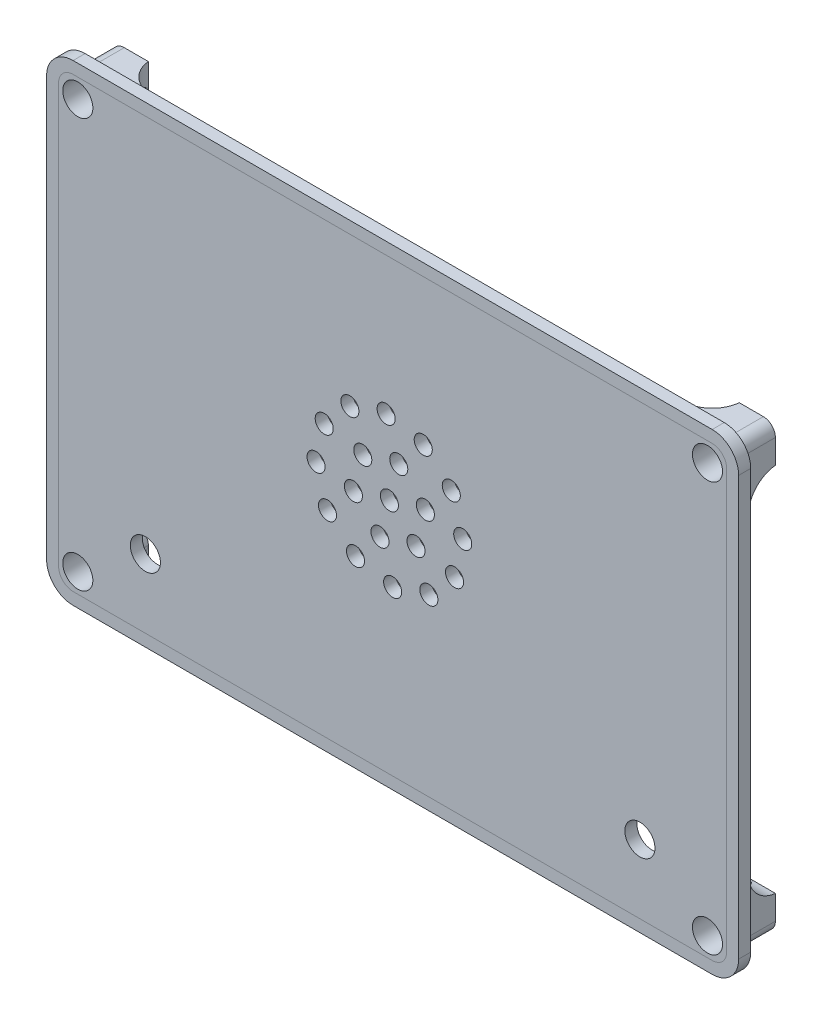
ISO-10303-21;
HEADER;
FILE_DESCRIPTION(('STEP AP214'),'2;1');
FILE_NAME('part.step','',(''),(''),'','','');
FILE_SCHEMA(('AUTOMOTIVE_DESIGN { 1 0 10303 214 1 1 1 1 }'));
ENDSEC;
DATA;
#1=APPLICATION_CONTEXT('core data for automotive mechanical design processes');
#2=APPLICATION_PROTOCOL_DEFINITION('international standard','automotive_design',2000,#1);
#3=PRODUCT_CONTEXT('',#1,'mechanical');
#4=PRODUCT('Part','Part','',(#3));
#5=PRODUCT_RELATED_PRODUCT_CATEGORY('part','',(#4));
#6=PRODUCT_DEFINITION_FORMATION('','',#4);
#7=PRODUCT_DEFINITION_CONTEXT('part definition',#1,'design');
#8=PRODUCT_DEFINITION('design','',#6,#7);
#9=PRODUCT_DEFINITION_SHAPE('','',#8);
#10=(LENGTH_UNIT() NAMED_UNIT(*) SI_UNIT(.MILLI.,.METRE.));
#11=(NAMED_UNIT(*) PLANE_ANGLE_UNIT() SI_UNIT($,.RADIAN.));
#12=(NAMED_UNIT(*) SI_UNIT($,.STERADIAN.) SOLID_ANGLE_UNIT());
#13=UNCERTAINTY_MEASURE_WITH_UNIT(LENGTH_MEASURE(1.E-05),#10,'distance_accuracy_value','');
#14=(GEOMETRIC_REPRESENTATION_CONTEXT(3) GLOBAL_UNCERTAINTY_ASSIGNED_CONTEXT((#13)) GLOBAL_UNIT_ASSIGNED_CONTEXT((#10,
#11,#12)) REPRESENTATION_CONTEXT('',''));
#15=CARTESIAN_POINT('',(0.,0.,0.));
#16=DIRECTION('',(0.,0.,1.));
#17=DIRECTION('',(1.,0.,0.));
#18=AXIS2_PLACEMENT_3D('',#15,#16,#17);
#19=CARTESIAN_POINT('',(53.06,34.78,0.));
#20=DIRECTION('',(0.,0.,1.));
#21=DIRECTION('',(1.,0.,0.));
#22=AXIS2_PLACEMENT_3D('',#19,#20,#21);
#23=CYLINDRICAL_SURFACE('',#22,4.4);
#24=CARTESIAN_POINT('',(53.06,34.78,2.));
#25=DIRECTION('',(0.,0.,1.));
#26=DIRECTION('',(1.,0.,0.));
#27=AXIS2_PLACEMENT_3D('',#24,#25,#26);
#28=CIRCLE('',#27,4.4);
#29=CARTESIAN_POINT('',(57.46,34.78,2.));
#30=VERTEX_POINT('',#29);
#31=CARTESIAN_POINT('',(53.06,39.18,2.));
#32=VERTEX_POINT('',#31);
#33=EDGE_CURVE('E362',#30,#32,#28,.T.);
#34=ORIENTED_EDGE('',*,*,#33,.F.);
#35=DIRECTION('',(0.,0.,1.));
#36=VECTOR('',#35,1.);
#37=CARTESIAN_POINT('',(57.46,34.78,0.));
#38=LINE('',#37,#36);
#39=CARTESIAN_POINT('',(57.46,34.78,0.));
#40=VERTEX_POINT('',#39);
#41=EDGE_CURVE('E13',#40,#30,#38,.T.);
#42=ORIENTED_EDGE('',*,*,#41,.F.);
#43=CARTESIAN_POINT('',(53.06,34.78,0.));
#44=DIRECTION('',(0.,0.,1.));
#45=DIRECTION('',(1.,0.,0.));
#46=AXIS2_PLACEMENT_3D('',#43,#44,#45);
#47=CIRCLE('',#46,4.4);
#48=CARTESIAN_POINT('',(53.06,39.18,0.));
#49=VERTEX_POINT('',#48);
#50=EDGE_CURVE('E374',#40,#49,#47,.T.);
#51=ORIENTED_EDGE('',*,*,#50,.T.);
#52=DIRECTION('',(0.,0.,1.));
#53=VECTOR('',#52,1.);
#54=CARTESIAN_POINT('',(53.06,39.18,0.));
#55=LINE('',#54,#53);
#56=EDGE_CURVE('E195',#49,#32,#55,.T.);
#57=ORIENTED_EDGE('',*,*,#56,.T.);
#58=EDGE_LOOP('',(#34,#42,#51,#57));
#59=FACE_BOUND('',#58,.T.);
#60=ADVANCED_FACE('F192',(#59),#23,.T.);
#61=CARTESIAN_POINT('',(57.46,-34.78,0.));
#62=DIRECTION('',(1.,0.,0.));
#63=DIRECTION('',(0.,1.,0.));
#64=AXIS2_PLACEMENT_3D('',#61,#62,#63);
#65=PLANE('',#64);
#66=DIRECTION('',(0.,1.,0.));
#67=VECTOR('',#66,1.);
#68=CARTESIAN_POINT('',(57.46,-34.78,2.));
#69=LINE('',#68,#67);
#70=CARTESIAN_POINT('',(57.46,-34.78,2.));
#71=VERTEX_POINT('',#70);
#72=EDGE_CURVE('E378',#71,#30,#69,.T.);
#73=ORIENTED_EDGE('',*,*,#72,.F.);
#74=DIRECTION('',(0.,0.,1.));
#75=VECTOR('',#74,1.);
#76=CARTESIAN_POINT('',(57.46,-34.78,0.));
#77=LINE('',#76,#75);
#78=CARTESIAN_POINT('',(57.46,-34.78,0.));
#79=VERTEX_POINT('',#78);
#80=EDGE_CURVE('E200',#79,#71,#77,.T.);
#81=ORIENTED_EDGE('',*,*,#80,.F.);
#82=DIRECTION('',(0.,1.,0.));
#83=VECTOR('',#82,1.);
#84=CARTESIAN_POINT('',(57.46,-34.78,0.));
#85=LINE('',#84,#83);
#86=EDGE_CURVE('E396',#79,#40,#85,.T.);
#87=ORIENTED_EDGE('',*,*,#86,.T.);
#88=ORIENTED_EDGE('',*,*,#41,.T.);
#89=EDGE_LOOP('',(#73,#81,#87,#88));
#90=FACE_BOUND('',#89,.T.);
#91=ADVANCED_FACE('F443',(#90),#65,.T.);
#92=CARTESIAN_POINT('',(53.06,-34.78,0.));
#93=DIRECTION('',(0.,0.,1.));
#94=DIRECTION('',(1.,0.,0.));
#95=AXIS2_PLACEMENT_3D('',#92,#93,#94);
#96=CYLINDRICAL_SURFACE('',#95,4.4);
#97=CARTESIAN_POINT('',(53.06,-34.78,2.));
#98=DIRECTION('',(0.,0.,1.));
#99=DIRECTION('',(1.,0.,0.));
#100=AXIS2_PLACEMENT_3D('',#97,#98,#99);
#101=CIRCLE('',#100,4.4);
#102=CARTESIAN_POINT('',(53.06,-39.18,2.));
#103=VERTEX_POINT('',#102);
#104=EDGE_CURVE('E416',#103,#71,#101,.T.);
#105=ORIENTED_EDGE('',*,*,#104,.F.);
#106=DIRECTION('',(0.,0.,1.));
#107=VECTOR('',#106,1.);
#108=CARTESIAN_POINT('',(53.06,-39.18,0.));
#109=LINE('',#108,#107);
#110=CARTESIAN_POINT('',(53.06,-39.18,0.));
#111=VERTEX_POINT('',#110);
#112=EDGE_CURVE('E422',#111,#103,#109,.T.);
#113=ORIENTED_EDGE('',*,*,#112,.F.);
#114=CARTESIAN_POINT('',(53.06,-34.78,0.));
#115=DIRECTION('',(0.,0.,1.));
#116=DIRECTION('',(1.,0.,0.));
#117=AXIS2_PLACEMENT_3D('',#114,#115,#116);
#118=CIRCLE('',#117,4.4);
#119=EDGE_CURVE('E393',#111,#79,#118,.T.);
#120=ORIENTED_EDGE('',*,*,#119,.T.);
#121=ORIENTED_EDGE('',*,*,#80,.T.);
#122=EDGE_LOOP('',(#105,#113,#120,#121));
#123=FACE_BOUND('',#122,.T.);
#124=ADVANCED_FACE('F462',(#123),#96,.T.);
#125=CARTESIAN_POINT('',(-53.06,-39.18,0.));
#126=DIRECTION('',(0.,-1.,0.));
#127=DIRECTION('',(0.,0.,-1.));
#128=AXIS2_PLACEMENT_3D('',#125,#126,#127);
#129=PLANE('',#128);
#130=DIRECTION('',(1.,0.,0.));
#131=VECTOR('',#130,1.);
#132=CARTESIAN_POINT('',(-53.06,-39.18,2.));
#133=LINE('',#132,#131);
#134=CARTESIAN_POINT('',(-53.06,-39.18,2.));
#135=VERTEX_POINT('',#134);
#136=EDGE_CURVE('E413',#135,#103,#133,.T.);
#137=ORIENTED_EDGE('',*,*,#136,.F.);
#138=DIRECTION('',(0.,0.,1.));
#139=VECTOR('',#138,1.);
#140=CARTESIAN_POINT('',(-53.06,-39.18,0.));
#141=LINE('',#140,#139);
#142=CARTESIAN_POINT('',(-53.06,-39.18,0.));
#143=VERTEX_POINT('',#142);
#144=EDGE_CURVE('E424',#143,#135,#141,.T.);
#145=ORIENTED_EDGE('',*,*,#144,.F.);
#146=DIRECTION('',(1.,0.,0.));
#147=VECTOR('',#146,1.);
#148=CARTESIAN_POINT('',(-53.06,-39.18,0.));
#149=LINE('',#148,#147);
#150=EDGE_CURVE('E390',#143,#111,#149,.T.);
#151=ORIENTED_EDGE('',*,*,#150,.T.);
#152=ORIENTED_EDGE('',*,*,#112,.T.);
#153=EDGE_LOOP('',(#137,#145,#151,#152));
#154=FACE_BOUND('',#153,.T.);
#155=ADVANCED_FACE('F460',(#154),#129,.T.);
#156=CARTESIAN_POINT('',(-53.06,-34.78,0.));
#157=DIRECTION('',(0.,0.,1.));
#158=DIRECTION('',(1.,0.,0.));
#159=AXIS2_PLACEMENT_3D('',#156,#157,#158);
#160=CYLINDRICAL_SURFACE('',#159,4.4);
#161=CARTESIAN_POINT('',(-53.06,-34.78,2.));
#162=DIRECTION('',(0.,0.,1.));
#163=DIRECTION('',(1.,0.,0.));
#164=AXIS2_PLACEMENT_3D('',#161,#162,#163);
#165=CIRCLE('',#164,4.4);
#166=CARTESIAN_POINT('',(-57.46,-34.78,2.));
#167=VERTEX_POINT('',#166);
#168=EDGE_CURVE('E410',#167,#135,#165,.T.);
#169=ORIENTED_EDGE('',*,*,#168,.F.);
#170=DIRECTION('',(0.,0.,1.));
#171=VECTOR('',#170,1.);
#172=CARTESIAN_POINT('',(-57.46,-34.78,0.));
#173=LINE('',#172,#171);
#174=CARTESIAN_POINT('',(-57.46,-34.78,0.));
#175=VERTEX_POINT('',#174);
#176=EDGE_CURVE('E426',#175,#167,#173,.T.);
#177=ORIENTED_EDGE('',*,*,#176,.F.);
#178=CARTESIAN_POINT('',(-53.06,-34.78,0.));
#179=DIRECTION('',(0.,0.,1.));
#180=DIRECTION('',(1.,0.,0.));
#181=AXIS2_PLACEMENT_3D('',#178,#179,#180);
#182=CIRCLE('',#181,4.4);
#183=EDGE_CURVE('E387',#175,#143,#182,.T.);
#184=ORIENTED_EDGE('',*,*,#183,.T.);
#185=ORIENTED_EDGE('',*,*,#144,.T.);
#186=EDGE_LOOP('',(#169,#177,#184,#185));
#187=FACE_BOUND('',#186,.T.);
#188=ADVANCED_FACE('F456',(#187),#160,.T.);
#189=CARTESIAN_POINT('',(-57.46,34.78,0.));
#190=DIRECTION('',(-1.,0.,0.));
#191=DIRECTION('',(0.,-1.,0.));
#192=AXIS2_PLACEMENT_3D('',#189,#190,#191);
#193=PLANE('',#192);
#194=DIRECTION('',(0.,-1.,0.));
#195=VECTOR('',#194,1.);
#196=CARTESIAN_POINT('',(-57.46,34.78,2.));
#197=LINE('',#196,#195);
#198=CARTESIAN_POINT('',(-57.46,34.78,2.));
#199=VERTEX_POINT('',#198);
#200=EDGE_CURVE('E407',#199,#167,#197,.T.);
#201=ORIENTED_EDGE('',*,*,#200,.F.);
#202=DIRECTION('',(0.,0.,1.));
#203=VECTOR('',#202,1.);
#204=CARTESIAN_POINT('',(-57.46,34.78,0.));
#205=LINE('',#204,#203);
#206=CARTESIAN_POINT('',(-57.46,34.78,0.));
#207=VERTEX_POINT('',#206);
#208=EDGE_CURVE('E428',#207,#199,#205,.T.);
#209=ORIENTED_EDGE('',*,*,#208,.F.);
#210=DIRECTION('',(0.,-1.,0.));
#211=VECTOR('',#210,1.);
#212=CARTESIAN_POINT('',(-57.46,34.78,0.));
#213=LINE('',#212,#211);
#214=EDGE_CURVE('E384',#207,#175,#213,.T.);
#215=ORIENTED_EDGE('',*,*,#214,.T.);
#216=ORIENTED_EDGE('',*,*,#176,.T.);
#217=EDGE_LOOP('',(#201,#209,#215,#216));
#218=FACE_BOUND('',#217,.T.);
#219=ADVANCED_FACE('F454',(#218),#193,.T.);
#220=CARTESIAN_POINT('',(-53.06,34.78,0.));
#221=DIRECTION('',(0.,0.,1.));
#222=DIRECTION('',(1.,0.,0.));
#223=AXIS2_PLACEMENT_3D('',#220,#221,#222);
#224=CYLINDRICAL_SURFACE('',#223,4.40000000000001);
#225=CARTESIAN_POINT('',(-53.06,34.78,2.));
#226=DIRECTION('',(0.,0.,1.));
#227=DIRECTION('',(1.,0.,0.));
#228=AXIS2_PLACEMENT_3D('',#225,#226,#227);
#229=CIRCLE('',#228,4.40000000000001);
#230=CARTESIAN_POINT('',(-53.06,39.18,2.));
#231=VERTEX_POINT('',#230);
#232=EDGE_CURVE('E404',#231,#199,#229,.T.);
#233=ORIENTED_EDGE('',*,*,#232,.F.);
#234=DIRECTION('',(0.,0.,1.));
#235=VECTOR('',#234,1.);
#236=CARTESIAN_POINT('',(-53.06,39.18,0.));
#237=LINE('',#236,#235);
#238=CARTESIAN_POINT('',(-53.06,39.18,0.));
#239=VERTEX_POINT('',#238);
#240=EDGE_CURVE('E429',#239,#231,#237,.T.);
#241=ORIENTED_EDGE('',*,*,#240,.F.);
#242=CARTESIAN_POINT('',(-53.06,34.78,0.));
#243=DIRECTION('',(0.,0.,1.));
#244=DIRECTION('',(1.,0.,0.));
#245=AXIS2_PLACEMENT_3D('',#242,#243,#244);
#246=CIRCLE('',#245,4.40000000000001);
#247=EDGE_CURVE('E381',#239,#207,#246,.T.);
#248=ORIENTED_EDGE('',*,*,#247,.T.);
#249=ORIENTED_EDGE('',*,*,#208,.T.);
#250=EDGE_LOOP('',(#233,#241,#248,#249));
#251=FACE_BOUND('',#250,.T.);
#252=ADVANCED_FACE('F450',(#251),#224,.T.);
#253=CARTESIAN_POINT('',(53.06,39.18,0.));
#254=DIRECTION('',(0.,1.,0.));
#255=DIRECTION('',(-1.,0.,0.));
#256=AXIS2_PLACEMENT_3D('',#253,#254,#255);
#257=PLANE('',#256);
#258=DIRECTION('',(-1.,0.,0.));
#259=VECTOR('',#258,1.);
#260=CARTESIAN_POINT('',(53.06,39.18,2.));
#261=LINE('',#260,#259);
#262=EDGE_CURVE('E401',#32,#231,#261,.T.);
#263=ORIENTED_EDGE('',*,*,#262,.F.);
#264=ORIENTED_EDGE('',*,*,#56,.F.);
#265=DIRECTION('',(-1.,0.,0.));
#266=VECTOR('',#265,1.);
#267=CARTESIAN_POINT('',(53.06,39.18,0.));
#268=LINE('',#267,#266);
#269=EDGE_CURVE('E377',#49,#239,#268,.T.);
#270=ORIENTED_EDGE('',*,*,#269,.T.);
#271=ORIENTED_EDGE('',*,*,#240,.T.);
#272=EDGE_LOOP('',(#263,#264,#270,#271));
#273=FACE_BOUND('',#272,.T.);
#274=ADVANCED_FACE('F437',(#273),#257,.T.);
#275=CARTESIAN_POINT('',(53.06,34.78,0.));
#276=DIRECTION('',(0.,0.,1.));
#277=DIRECTION('',(1.,0.,0.));
#278=AXIS2_PLACEMENT_3D('',#275,#276,#277);
#279=PLANE('',#278);
#280=DIRECTION('',(0.,1.,0.));
#281=VECTOR('',#280,1.);
#282=CARTESIAN_POINT('',(55.46,-34.78,0.));
#283=LINE('',#282,#281);
#284=CARTESIAN_POINT('',(55.46,-34.78,0.));
#285=VERTEX_POINT('',#284);
#286=CARTESIAN_POINT('',(55.46,34.78,0.));
#287=VERTEX_POINT('',#286);
#288=EDGE_CURVE('E313',#285,#287,#283,.T.);
#289=ORIENTED_EDGE('',*,*,#288,.T.);
#290=CARTESIAN_POINT('',(53.06,34.78,0.));
#291=DIRECTION('',(0.,0.,1.));
#292=DIRECTION('',(1.,0.,0.));
#293=AXIS2_PLACEMENT_3D('',#290,#291,#292);
#294=CIRCLE('',#293,2.4);
#295=CARTESIAN_POINT('',(53.06,37.18,0.));
#296=VERTEX_POINT('',#295);
#297=EDGE_CURVE('E307',#287,#296,#294,.T.);
#298=ORIENTED_EDGE('',*,*,#297,.T.);
#299=DIRECTION('',(-1.,0.,0.));
#300=VECTOR('',#299,1.);
#301=CARTESIAN_POINT('',(53.06,37.18,0.));
#302=LINE('',#301,#300);
#303=CARTESIAN_POINT('',(-53.06,37.18,0.));
#304=VERTEX_POINT('',#303);
#305=EDGE_CURVE('E316',#296,#304,#302,.T.);
#306=ORIENTED_EDGE('',*,*,#305,.T.);
#307=CARTESIAN_POINT('',(-53.06,34.78,0.));
#308=DIRECTION('',(0.,0.,1.));
#309=DIRECTION('',(1.,0.,0.));
#310=AXIS2_PLACEMENT_3D('',#307,#308,#309);
#311=CIRCLE('',#310,2.40000000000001);
#312=CARTESIAN_POINT('',(-55.46,34.78,0.));
#313=VERTEX_POINT('',#312);
#314=EDGE_CURVE('E208',#304,#313,#311,.T.);
#315=ORIENTED_EDGE('',*,*,#314,.T.);
#316=DIRECTION('',(0.,-1.,0.));
#317=VECTOR('',#316,1.);
#318=CARTESIAN_POINT('',(-55.46,34.78,0.));
#319=LINE('',#318,#317);
#320=CARTESIAN_POINT('',(-55.46,-34.78,0.));
#321=VERTEX_POINT('',#320);
#322=EDGE_CURVE('E331',#313,#321,#319,.T.);
#323=ORIENTED_EDGE('',*,*,#322,.T.);
#324=CARTESIAN_POINT('',(-53.06,-34.78,0.));
#325=DIRECTION('',(0.,0.,1.));
#326=DIRECTION('',(1.,0.,0.));
#327=AXIS2_PLACEMENT_3D('',#324,#325,#326);
#328=CIRCLE('',#327,2.4);
#329=CARTESIAN_POINT('',(-53.06,-37.18,0.));
#330=VERTEX_POINT('',#329);
#331=EDGE_CURVE('E334',#321,#330,#328,.T.);
#332=ORIENTED_EDGE('',*,*,#331,.T.);
#333=DIRECTION('',(1.,0.,0.));
#334=VECTOR('',#333,1.);
#335=CARTESIAN_POINT('',(-53.06,-37.18,0.));
#336=LINE('',#335,#334);
#337=CARTESIAN_POINT('',(53.06,-37.18,0.));
#338=VERTEX_POINT('',#337);
#339=EDGE_CURVE('E337',#330,#338,#336,.T.);
#340=ORIENTED_EDGE('',*,*,#339,.T.);
#341=CARTESIAN_POINT('',(53.06,-34.78,0.));
#342=DIRECTION('',(0.,0.,1.));
#343=DIRECTION('',(1.,0.,0.));
#344=AXIS2_PLACEMENT_3D('',#341,#342,#343);
#345=CIRCLE('',#344,2.4);
#346=EDGE_CURVE('E340',#338,#285,#345,.T.);
#347=ORIENTED_EDGE('',*,*,#346,.T.);
#348=EDGE_LOOP('',(#289,#298,#306,#315,#323,#332,#340,#347));
#349=FACE_BOUND('',#348,.T.);
#350=ORIENTED_EDGE('',*,*,#50,.F.);
#351=ORIENTED_EDGE('',*,*,#86,.F.);
#352=ORIENTED_EDGE('',*,*,#119,.F.);
#353=ORIENTED_EDGE('',*,*,#150,.F.);
#354=ORIENTED_EDGE('',*,*,#183,.F.);
#355=ORIENTED_EDGE('',*,*,#214,.F.);
#356=ORIENTED_EDGE('',*,*,#247,.F.);
#357=ORIENTED_EDGE('',*,*,#269,.F.);
#358=EDGE_LOOP('',(#350,#351,#352,#353,#354,#355,#356,#357));
#359=FACE_BOUND('',#358,.T.);
#360=ADVANCED_FACE('F320',(#349,#359),#279,.F.);
#361=CARTESIAN_POINT('',(53.06,34.78,2.));
#362=DIRECTION('',(0.,0.,1.));
#363=DIRECTION('',(1.,0.,0.));
#364=AXIS2_PLACEMENT_3D('',#361,#362,#363);
#365=PLANE('',#364);
#366=CARTESIAN_POINT('',(53.06,34.78,2.));
#367=DIRECTION('',(0.,0.,1.));
#368=DIRECTION('',(1.,0.,0.));
#369=AXIS2_PLACEMENT_3D('',#366,#367,#368);
#370=CIRCLE('',#369,2.4);
#371=CARTESIAN_POINT('',(55.46,34.78,2.));
#372=VERTEX_POINT('',#371);
#373=CARTESIAN_POINT('',(53.06,37.18,2.));
#374=VERTEX_POINT('',#373);
#375=EDGE_CURVE('E216',#372,#374,#370,.T.);
#376=ORIENTED_EDGE('',*,*,#375,.F.);
#377=DIRECTION('',(0.,1.,0.));
#378=VECTOR('',#377,1.);
#379=CARTESIAN_POINT('',(55.46,-34.78,2.));
#380=LINE('',#379,#378);
#381=CARTESIAN_POINT('',(55.46,-34.78,2.));
#382=VERTEX_POINT('',#381);
#383=EDGE_CURVE('E324',#382,#372,#380,.T.);
#384=ORIENTED_EDGE('',*,*,#383,.F.);
#385=CARTESIAN_POINT('',(53.06,-34.78,2.));
#386=DIRECTION('',(0.,0.,1.));
#387=DIRECTION('',(1.,0.,0.));
#388=AXIS2_PLACEMENT_3D('',#385,#386,#387);
#389=CIRCLE('',#388,2.4);
#390=CARTESIAN_POINT('',(53.06,-37.18,2.));
#391=VERTEX_POINT('',#390);
#392=EDGE_CURVE('E327',#391,#382,#389,.T.);
#393=ORIENTED_EDGE('',*,*,#392,.F.);
#394=DIRECTION('',(1.,0.,0.));
#395=VECTOR('',#394,1.);
#396=CARTESIAN_POINT('',(-53.06,-37.18,2.));
#397=LINE('',#396,#395);
#398=CARTESIAN_POINT('',(-53.06,-37.18,2.));
#399=VERTEX_POINT('',#398);
#400=EDGE_CURVE('E355',#399,#391,#397,.T.);
#401=ORIENTED_EDGE('',*,*,#400,.F.);
#402=CARTESIAN_POINT('',(-53.06,-34.78,2.));
#403=DIRECTION('',(0.,0.,1.));
#404=DIRECTION('',(1.,0.,0.));
#405=AXIS2_PLACEMENT_3D('',#402,#403,#404);
#406=CIRCLE('',#405,2.4);
#407=CARTESIAN_POINT('',(-55.46,-34.78,2.));
#408=VERTEX_POINT('',#407);
#409=EDGE_CURVE('E352',#408,#399,#406,.T.);
#410=ORIENTED_EDGE('',*,*,#409,.F.);
#411=DIRECTION('',(0.,-1.,0.));
#412=VECTOR('',#411,1.);
#413=CARTESIAN_POINT('',(-55.46,34.78,2.));
#414=LINE('',#413,#412);
#415=CARTESIAN_POINT('',(-55.46,34.78,2.));
#416=VERTEX_POINT('',#415);
#417=EDGE_CURVE('E349',#416,#408,#414,.T.);
#418=ORIENTED_EDGE('',*,*,#417,.F.);
#419=CARTESIAN_POINT('',(-53.06,34.78,2.));
#420=DIRECTION('',(0.,0.,1.));
#421=DIRECTION('',(1.,0.,0.));
#422=AXIS2_PLACEMENT_3D('',#419,#420,#421);
#423=CIRCLE('',#422,2.40000000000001);
#424=CARTESIAN_POINT('',(-53.06,37.18,2.));
#425=VERTEX_POINT('',#424);
#426=EDGE_CURVE('E346',#425,#416,#423,.T.);
#427=ORIENTED_EDGE('',*,*,#426,.F.);
#428=DIRECTION('',(-1.,0.,0.));
#429=VECTOR('',#428,1.);
#430=CARTESIAN_POINT('',(53.06,37.18,2.));
#431=LINE('',#430,#429);
#432=EDGE_CURVE('E344',#374,#425,#431,.T.);
#433=ORIENTED_EDGE('',*,*,#432,.F.);
#434=EDGE_LOOP('',(#376,#384,#393,#401,#410,#418,#427,#433));
#435=FACE_BOUND('',#434,.T.);
#436=ORIENTED_EDGE('',*,*,#33,.T.);
#437=ORIENTED_EDGE('',*,*,#262,.T.);
#438=ORIENTED_EDGE('',*,*,#232,.T.);
#439=ORIENTED_EDGE('',*,*,#200,.T.);
#440=ORIENTED_EDGE('',*,*,#168,.T.);
#441=ORIENTED_EDGE('',*,*,#136,.T.);
#442=ORIENTED_EDGE('',*,*,#104,.T.);
#443=ORIENTED_EDGE('',*,*,#72,.T.);
#444=EDGE_LOOP('',(#436,#437,#438,#439,#440,#441,#442,#443));
#445=FACE_BOUND('',#444,.T.);
#446=ADVANCED_FACE('F439',(#435,#445),#365,.T.);
#447=CARTESIAN_POINT('',(53.06,34.78,0.));
#448=DIRECTION('',(0.,0.,1.));
#449=DIRECTION('',(1.,0.,0.));
#450=AXIS2_PLACEMENT_3D('',#447,#448,#449);
#451=CYLINDRICAL_SURFACE('',#450,2.4);
#452=ORIENTED_EDGE('',*,*,#375,.T.);
#453=DIRECTION('',(0.,0.,1.));
#454=VECTOR('',#453,1.);
#455=CARTESIAN_POINT('',(53.06,37.18,0.));
#456=LINE('',#455,#454);
#457=EDGE_CURVE('E303',#296,#374,#456,.T.);
#458=ORIENTED_EDGE('',*,*,#457,.F.);
#459=ORIENTED_EDGE('',*,*,#297,.F.);
#460=DIRECTION('',(0.,0.,1.));
#461=VECTOR('',#460,1.);
#462=CARTESIAN_POINT('',(55.46,34.78,0.));
#463=LINE('',#462,#461);
#464=EDGE_CURVE('E360',#287,#372,#463,.T.);
#465=ORIENTED_EDGE('',*,*,#464,.T.);
#466=EDGE_LOOP('',(#452,#458,#459,#465));
#467=FACE_BOUND('',#466,.T.);
#468=ADVANCED_FACE('F305',(#467),#451,.F.);
#469=CARTESIAN_POINT('',(55.46,-34.78,0.));
#470=DIRECTION('',(1.,0.,0.));
#471=DIRECTION('',(0.,1.,0.));
#472=AXIS2_PLACEMENT_3D('',#469,#470,#471);
#473=PLANE('',#472);
#474=ORIENTED_EDGE('',*,*,#383,.T.);
#475=ORIENTED_EDGE('',*,*,#464,.F.);
#476=ORIENTED_EDGE('',*,*,#288,.F.);
#477=DIRECTION('',(0.,0.,1.));
#478=VECTOR('',#477,1.);
#479=CARTESIAN_POINT('',(55.46,-34.78,0.));
#480=LINE('',#479,#478);
#481=EDGE_CURVE('E363',#285,#382,#480,.T.);
#482=ORIENTED_EDGE('',*,*,#481,.T.);
#483=EDGE_LOOP('',(#474,#475,#476,#482));
#484=FACE_BOUND('',#483,.T.);
#485=ADVANCED_FACE('F554',(#484),#473,.F.);
#486=CARTESIAN_POINT('',(53.06,-34.78,0.));
#487=DIRECTION('',(0.,0.,1.));
#488=DIRECTION('',(1.,0.,0.));
#489=AXIS2_PLACEMENT_3D('',#486,#487,#488);
#490=CYLINDRICAL_SURFACE('',#489,2.4);
#491=ORIENTED_EDGE('',*,*,#392,.T.);
#492=ORIENTED_EDGE('',*,*,#481,.F.);
#493=ORIENTED_EDGE('',*,*,#346,.F.);
#494=DIRECTION('',(0.,0.,1.));
#495=VECTOR('',#494,1.);
#496=CARTESIAN_POINT('',(53.06,-37.18,0.));
#497=LINE('',#496,#495);
#498=EDGE_CURVE('E365',#338,#391,#497,.T.);
#499=ORIENTED_EDGE('',*,*,#498,.T.);
#500=EDGE_LOOP('',(#491,#492,#493,#499));
#501=FACE_BOUND('',#500,.T.);
#502=ADVANCED_FACE('F564',(#501),#490,.F.);
#503=CARTESIAN_POINT('',(-53.06,-37.18,0.));
#504=DIRECTION('',(0.,-1.,0.));
#505=DIRECTION('',(0.,0.,-1.));
#506=AXIS2_PLACEMENT_3D('',#503,#504,#505);
#507=PLANE('',#506);
#508=ORIENTED_EDGE('',*,*,#400,.T.);
#509=ORIENTED_EDGE('',*,*,#498,.F.);
#510=ORIENTED_EDGE('',*,*,#339,.F.);
#511=DIRECTION('',(0.,0.,1.));
#512=VECTOR('',#511,1.);
#513=CARTESIAN_POINT('',(-53.06,-37.18,0.));
#514=LINE('',#513,#512);
#515=EDGE_CURVE('E367',#330,#399,#514,.T.);
#516=ORIENTED_EDGE('',*,*,#515,.T.);
#517=EDGE_LOOP('',(#508,#509,#510,#516));
#518=FACE_BOUND('',#517,.T.);
#519=ADVANCED_FACE('F575',(#518),#507,.F.);
#520=CARTESIAN_POINT('',(-53.06,-34.78,0.));
#521=DIRECTION('',(0.,0.,1.));
#522=DIRECTION('',(1.,0.,0.));
#523=AXIS2_PLACEMENT_3D('',#520,#521,#522);
#524=CYLINDRICAL_SURFACE('',#523,2.4);
#525=ORIENTED_EDGE('',*,*,#409,.T.);
#526=ORIENTED_EDGE('',*,*,#515,.F.);
#527=ORIENTED_EDGE('',*,*,#331,.F.);
#528=DIRECTION('',(0.,0.,1.));
#529=VECTOR('',#528,1.);
#530=CARTESIAN_POINT('',(-55.46,-34.78,0.));
#531=LINE('',#530,#529);
#532=EDGE_CURVE('E369',#321,#408,#531,.T.);
#533=ORIENTED_EDGE('',*,*,#532,.T.);
#534=EDGE_LOOP('',(#525,#526,#527,#533));
#535=FACE_BOUND('',#534,.T.);
#536=ADVANCED_FACE('F586',(#535),#524,.F.);
#537=CARTESIAN_POINT('',(-55.46,34.78,0.));
#538=DIRECTION('',(-1.,0.,0.));
#539=DIRECTION('',(0.,-1.,0.));
#540=AXIS2_PLACEMENT_3D('',#537,#538,#539);
#541=PLANE('',#540);
#542=ORIENTED_EDGE('',*,*,#417,.T.);
#543=ORIENTED_EDGE('',*,*,#532,.F.);
#544=ORIENTED_EDGE('',*,*,#322,.F.);
#545=DIRECTION('',(0.,0.,1.));
#546=VECTOR('',#545,1.);
#547=CARTESIAN_POINT('',(-55.46,34.78,0.));
#548=LINE('',#547,#546);
#549=EDGE_CURVE('E371',#313,#416,#548,.T.);
#550=ORIENTED_EDGE('',*,*,#549,.T.);
#551=EDGE_LOOP('',(#542,#543,#544,#550));
#552=FACE_BOUND('',#551,.T.);
#553=ADVANCED_FACE('F597',(#552),#541,.F.);
#554=CARTESIAN_POINT('',(-53.06,34.78,0.));
#555=DIRECTION('',(0.,0.,1.));
#556=DIRECTION('',(1.,0.,0.));
#557=AXIS2_PLACEMENT_3D('',#554,#555,#556);
#558=CYLINDRICAL_SURFACE('',#557,2.40000000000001);
#559=ORIENTED_EDGE('',*,*,#426,.T.);
#560=ORIENTED_EDGE('',*,*,#549,.F.);
#561=ORIENTED_EDGE('',*,*,#314,.F.);
#562=DIRECTION('',(0.,0.,1.));
#563=VECTOR('',#562,1.);
#564=CARTESIAN_POINT('',(-53.06,37.18,0.));
#565=LINE('',#564,#563);
#566=EDGE_CURVE('E312',#304,#425,#565,.T.);
#567=ORIENTED_EDGE('',*,*,#566,.T.);
#568=EDGE_LOOP('',(#559,#560,#561,#567));
#569=FACE_BOUND('',#568,.T.);
#570=ADVANCED_FACE('F608',(#569),#558,.F.);
#571=CARTESIAN_POINT('',(53.06,37.18,0.));
#572=DIRECTION('',(0.,1.,0.));
#573=DIRECTION('',(-1.,0.,0.));
#574=AXIS2_PLACEMENT_3D('',#571,#572,#573);
#575=PLANE('',#574);
#576=ORIENTED_EDGE('',*,*,#432,.T.);
#577=ORIENTED_EDGE('',*,*,#566,.F.);
#578=ORIENTED_EDGE('',*,*,#305,.F.);
#579=ORIENTED_EDGE('',*,*,#457,.T.);
#580=EDGE_LOOP('',(#576,#577,#578,#579));
#581=FACE_BOUND('',#580,.T.);
#582=ADVANCED_FACE('F317',(#581),#575,.F.);
#583=CLOSED_SHELL('',(#60,#91,#124,#155,#188,#219,#252,#274,#360,#446,#468,#485,#502,#519,#536,
#553,#570,#582));
#584=MANIFOLD_SOLID_BREP('B2',#583);
#585=CARTESIAN_POINT('',(-53.06,34.78,0.));
#586=DIRECTION('',(0.,0.,1.));
#587=DIRECTION('',(1.,0.,0.));
#588=AXIS2_PLACEMENT_3D('',#585,#586,#587);
#589=PLANE('',#588);
#590=DIRECTION('',(0.,1.,0.));
#591=VECTOR('',#590,1.);
#592=CARTESIAN_POINT('',(-55.06,34.78,0.));
#593=LINE('',#592,#591);
#594=CARTESIAN_POINT('',(-55.06,-34.78,0.));
#595=VERTEX_POINT('',#594);
#596=CARTESIAN_POINT('',(-55.06,34.78,0.));
#597=VERTEX_POINT('',#596);
#598=EDGE_CURVE('E1288',#595,#597,#593,.T.);
#599=ORIENTED_EDGE('',*,*,#598,.F.);
#600=CARTESIAN_POINT('',(-53.06,-34.78,0.));
#601=DIRECTION('',(0.,0.,1.));
#602=DIRECTION('',(1.,0.,0.));
#603=AXIS2_PLACEMENT_3D('',#600,#601,#602);
#604=CIRCLE('',#603,2.);
#605=CARTESIAN_POINT('',(-53.06,-36.78,0.));
#606=VERTEX_POINT('',#605);
#607=EDGE_CURVE('E1322',#595,#606,#604,.T.);
#608=ORIENTED_EDGE('',*,*,#607,.T.);
#609=DIRECTION('',(-1.,0.,0.));
#610=VECTOR('',#609,1.);
#611=CARTESIAN_POINT('',(-53.06,-36.78,0.));
#612=LINE('',#611,#610);
#613=CARTESIAN_POINT('',(53.06,-36.78,0.));
#614=VERTEX_POINT('',#613);
#615=EDGE_CURVE('E1285',#614,#606,#612,.T.);
#616=ORIENTED_EDGE('',*,*,#615,.F.);
#617=CARTESIAN_POINT('',(53.06,-34.78,0.));
#618=DIRECTION('',(0.,0.,1.));
#619=DIRECTION('',(1.,0.,0.));
#620=AXIS2_PLACEMENT_3D('',#617,#618,#619);
#621=CIRCLE('',#620,2.);
#622=CARTESIAN_POINT('',(55.06,-34.78,0.));
#623=VERTEX_POINT('',#622);
#624=EDGE_CURVE('E1320',#614,#623,#621,.T.);
#625=ORIENTED_EDGE('',*,*,#624,.T.);
#626=DIRECTION('',(0.,-1.,0.));
#627=VECTOR('',#626,1.);
#628=CARTESIAN_POINT('',(55.06,-34.78,0.));
#629=LINE('',#628,#627);
#630=CARTESIAN_POINT('',(55.06,34.78,0.));
#631=VERTEX_POINT('',#630);
#632=EDGE_CURVE('E1256',#631,#623,#629,.T.);
#633=ORIENTED_EDGE('',*,*,#632,.F.);
#634=CARTESIAN_POINT('',(53.06,34.78,0.));
#635=DIRECTION('',(0.,0.,1.));
#636=DIRECTION('',(1.,0.,0.));
#637=AXIS2_PLACEMENT_3D('',#634,#635,#636);
#638=CIRCLE('',#637,2.);
#639=CARTESIAN_POINT('',(53.06,36.78,0.));
#640=VERTEX_POINT('',#639);
#641=EDGE_CURVE('E1326',#631,#640,#638,.T.);
#642=ORIENTED_EDGE('',*,*,#641,.T.);
#643=DIRECTION('',(1.,0.,0.));
#644=VECTOR('',#643,1.);
#645=CARTESIAN_POINT('',(53.06,36.78,0.));
#646=LINE('',#645,#644);
#647=CARTESIAN_POINT('',(-53.06,36.78,0.));
#648=VERTEX_POINT('',#647);
#649=EDGE_CURVE('E1275',#648,#640,#646,.T.);
#650=ORIENTED_EDGE('',*,*,#649,.F.);
#651=CARTESIAN_POINT('',(-53.06,34.78,0.));
#652=DIRECTION('',(0.,0.,1.));
#653=DIRECTION('',(1.,0.,0.));
#654=AXIS2_PLACEMENT_3D('',#651,#652,#653);
#655=CIRCLE('',#654,2.);
#656=EDGE_CURVE('E1324',#648,#597,#655,.T.);
#657=ORIENTED_EDGE('',*,*,#656,.T.);
#658=EDGE_LOOP('',(#599,#608,#616,#625,#633,#642,#650,#657));
#659=FACE_BOUND('',#658,.T.);
#660=CARTESIAN_POINT('',(-53.06,34.78,0.));
#661=DIRECTION('',(0.,0.,-1.));
#662=DIRECTION('',(-1.,0.,0.));
#663=AXIS2_PLACEMENT_3D('',#660,#661,#662);
#664=CIRCLE('',#663,2.40000000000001);
#665=CARTESIAN_POINT('',(-55.46,34.78,0.));
#666=VERTEX_POINT('',#665);
#667=CARTESIAN_POINT('',(-53.06,37.18,0.));
#668=VERTEX_POINT('',#667);
#669=EDGE_CURVE('E1010',#666,#668,#664,.T.);
#670=ORIENTED_EDGE('',*,*,#669,.T.);
#671=DIRECTION('',(1.,0.,0.));
#672=VECTOR('',#671,1.);
#673=CARTESIAN_POINT('',(-53.06,37.18,0.));
#674=LINE('',#673,#672);
#675=CARTESIAN_POINT('',(53.06,37.18,0.));
#676=VERTEX_POINT('',#675);
#677=EDGE_CURVE('E1013',#668,#676,#674,.T.);
#678=ORIENTED_EDGE('',*,*,#677,.T.);
#679=CARTESIAN_POINT('',(53.06,34.78,0.));
#680=DIRECTION('',(0.,0.,-1.));
#681=DIRECTION('',(-1.,0.,0.));
#682=AXIS2_PLACEMENT_3D('',#679,#680,#681);
#683=CIRCLE('',#682,2.4);
#684=CARTESIAN_POINT('',(55.46,34.78,0.));
#685=VERTEX_POINT('',#684);
#686=EDGE_CURVE('E683',#676,#685,#683,.T.);
#687=ORIENTED_EDGE('',*,*,#686,.T.);
#688=DIRECTION('',(0.,-1.,0.));
#689=VECTOR('',#688,1.);
#690=CARTESIAN_POINT('',(55.46,34.78,0.));
#691=LINE('',#690,#689);
#692=CARTESIAN_POINT('',(55.46,-34.78,0.));
#693=VERTEX_POINT('',#692);
#694=EDGE_CURVE('E980',#685,#693,#691,.T.);
#695=ORIENTED_EDGE('',*,*,#694,.T.);
#696=CARTESIAN_POINT('',(53.06,-34.78,0.));
#697=DIRECTION('',(0.,0.,-1.));
#698=DIRECTION('',(-1.,0.,0.));
#699=AXIS2_PLACEMENT_3D('',#696,#697,#698);
#700=CIRCLE('',#699,2.4);
#701=CARTESIAN_POINT('',(53.06,-37.18,0.));
#702=VERTEX_POINT('',#701);
#703=EDGE_CURVE('E1018',#693,#702,#700,.T.);
#704=ORIENTED_EDGE('',*,*,#703,.T.);
#705=DIRECTION('',(-1.,0.,0.));
#706=VECTOR('',#705,1.);
#707=CARTESIAN_POINT('',(53.06,-37.18,0.));
#708=LINE('',#707,#706);
#709=CARTESIAN_POINT('',(-53.06,-37.18,0.));
#710=VERTEX_POINT('',#709);
#711=EDGE_CURVE('E1021',#702,#710,#708,.T.);
#712=ORIENTED_EDGE('',*,*,#711,.T.);
#713=CARTESIAN_POINT('',(-53.06,-34.78,0.));
#714=DIRECTION('',(0.,0.,-1.));
#715=DIRECTION('',(-1.,0.,0.));
#716=AXIS2_PLACEMENT_3D('',#713,#714,#715);
#717=CIRCLE('',#716,2.4);
#718=CARTESIAN_POINT('',(-55.46,-34.78,0.));
#719=VERTEX_POINT('',#718);
#720=EDGE_CURVE('E1024',#710,#719,#717,.T.);
#721=ORIENTED_EDGE('',*,*,#720,.T.);
#722=DIRECTION('',(0.,1.,0.));
#723=VECTOR('',#722,1.);
#724=CARTESIAN_POINT('',(-55.46,-34.78,0.));
#725=LINE('',#724,#723);
#726=EDGE_CURVE('E1027',#719,#666,#725,.T.);
#727=ORIENTED_EDGE('',*,*,#726,.T.);
#728=EDGE_LOOP('',(#670,#678,#687,#695,#704,#712,#721,#727));
#729=FACE_BOUND('',#728,.T.);
#730=ADVANCED_FACE('F665',(#659,#729),#589,.F.);
#731=CARTESIAN_POINT('',(-53.06,34.78,2.));
#732=DIRECTION('',(0.,0.,1.));
#733=DIRECTION('',(1.,0.,0.));
#734=AXIS2_PLACEMENT_3D('',#731,#732,#733);
#735=PLANE('',#734);
#736=CARTESIAN_POINT('',(-52.2784947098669,33.9990004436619,2.));
#737=DIRECTION('',(0.,0.,1.));
#738=DIRECTION('',(1.,0.,0.));
#739=AXIS2_PLACEMENT_3D('',#736,#737,#738);
#740=CIRCLE('',#739,2.5);
#741=CARTESIAN_POINT('',(-49.7784947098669,33.9990004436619,2.));
#742=VERTEX_POINT('',#741);
#743=EDGE_CURVE('E1182',#742,#742,#740,.T.);
#744=ORIENTED_EDGE('',*,*,#743,.F.);
#745=EDGE_LOOP('',(#744));
#746=FACE_BOUND('',#745,.T.);
#747=CARTESIAN_POINT('',(52.28,34.,2.));
#748=DIRECTION('',(0.,0.,1.));
#749=DIRECTION('',(1.,0.,0.));
#750=AXIS2_PLACEMENT_3D('',#747,#748,#749);
#751=CIRCLE('',#750,2.5);
#752=CARTESIAN_POINT('',(54.78,34.,2.));
#753=VERTEX_POINT('',#752);
#754=EDGE_CURVE('E1179',#753,#753,#751,.T.);
#755=ORIENTED_EDGE('',*,*,#754,.F.);
#756=EDGE_LOOP('',(#755));
#757=FACE_BOUND('',#756,.T.);
#758=CARTESIAN_POINT('',(52.28,-34.,2.));
#759=DIRECTION('',(0.,0.,1.));
#760=DIRECTION('',(1.,0.,0.));
#761=AXIS2_PLACEMENT_3D('',#758,#759,#760);
#762=CIRCLE('',#761,2.5);
#763=CARTESIAN_POINT('',(54.78,-34.,2.));
#764=VERTEX_POINT('',#763);
#765=EDGE_CURVE('E1186',#764,#764,#762,.T.);
#766=ORIENTED_EDGE('',*,*,#765,.F.);
#767=EDGE_LOOP('',(#766));
#768=FACE_BOUND('',#767,.T.);
#769=CARTESIAN_POINT('',(-52.2787613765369,-33.9462328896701,2.));
#770=DIRECTION('',(0.,0.,1.));
#771=DIRECTION('',(1.,0.,0.));
#772=AXIS2_PLACEMENT_3D('',#769,#770,#771);
#773=CIRCLE('',#772,2.5);
#774=CARTESIAN_POINT('',(-49.7787613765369,-33.9462328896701,2.));
#775=VERTEX_POINT('',#774);
#776=EDGE_CURVE('E1192',#775,#775,#773,.T.);
#777=ORIENTED_EDGE('',*,*,#776,.F.);
#778=EDGE_LOOP('',(#777));
#779=FACE_BOUND('',#778,.T.);
#780=CARTESIAN_POINT('',(41.06,-25.78,2.));
#781=DIRECTION('',(0.,0.,-1.));
#782=DIRECTION('',(-1.,0.,0.));
#783=AXIS2_PLACEMENT_3D('',#780,#781,#782);
#784=CIRCLE('',#783,2.5);
#785=CARTESIAN_POINT('',(38.56,-25.78,2.));
#786=VERTEX_POINT('',#785);
#787=EDGE_CURVE('E1166',#786,#786,#784,.T.);
#788=ORIENTED_EDGE('',*,*,#787,.T.);
#789=EDGE_LOOP('',(#788));
#790=FACE_BOUND('',#789,.T.);
#791=CARTESIAN_POINT('',(-41.06,-25.78,2.));
#792=DIRECTION('',(0.,0.,-1.));
#793=DIRECTION('',(-1.,0.,0.));
#794=AXIS2_PLACEMENT_3D('',#791,#792,#793);
#795=CIRCLE('',#794,2.5);
#796=CARTESIAN_POINT('',(-43.56,-25.78,2.));
#797=VERTEX_POINT('',#796);
#798=EDGE_CURVE('E1167',#797,#797,#795,.T.);
#799=ORIENTED_EDGE('',*,*,#798,.T.);
#800=EDGE_LOOP('',(#799));
#801=FACE_BOUND('',#800,.T.);
#802=CARTESIAN_POINT('',(-0.540000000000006,2.18,2.));
#803=DIRECTION('',(0.,0.,-1.));
#804=DIRECTION('',(-1.,0.,0.));
#805=AXIS2_PLACEMENT_3D('',#802,#803,#804);
#806=CIRCLE('',#805,1.5);
#807=CARTESIAN_POINT('',(-2.04000000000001,2.18,2.));
#808=VERTEX_POINT('',#807);
#809=EDGE_CURVE('E1152',#808,#808,#806,.T.);
#810=ORIENTED_EDGE('',*,*,#809,.T.);
#811=EDGE_LOOP('',(#810));
#812=FACE_BOUND('',#811,.T.);
#813=CARTESIAN_POINT('',(0.,-10.,2.));
#814=DIRECTION('',(0.,0.,-1.));
#815=DIRECTION('',(-1.,0.,0.));
#816=AXIS2_PLACEMENT_3D('',#813,#814,#815);
#817=CIRCLE('',#816,1.5);
#818=CARTESIAN_POINT('',(-1.5,-10.,2.));
#819=VERTEX_POINT('',#818);
#820=EDGE_CURVE('E1146',#819,#819,#817,.T.);
#821=ORIENTED_EDGE('',*,*,#820,.T.);
#822=EDGE_LOOP('',(#821));
#823=FACE_BOUND('',#822,.T.);
#824=CARTESIAN_POINT('',(-6.16234628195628,-8.63818941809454,2.));
#825=DIRECTION('',(0.,0.,-1.));
#826=DIRECTION('',(-1.,0.,0.));
#827=AXIS2_PLACEMENT_3D('',#824,#825,#826);
#828=CIRCLE('',#827,1.5);
#829=CARTESIAN_POINT('',(-7.66234628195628,-8.63818941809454,2.));
#830=VERTEX_POINT('',#829);
#831=EDGE_CURVE('E1077',#830,#830,#828,.T.);
#832=ORIENTED_EDGE('',*,*,#831,.T.);
#833=EDGE_LOOP('',(#832));
#834=FACE_BOUND('',#833,.T.);
#835=CARTESIAN_POINT('',(-10.8181894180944,-4.37765371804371,2.));
#836=DIRECTION('',(0.,0.,-1.));
#837=DIRECTION('',(-1.,0.,0.));
#838=AXIS2_PLACEMENT_3D('',#835,#836,#837);
#839=CIRCLE('',#838,1.5);
#840=CARTESIAN_POINT('',(-12.3181894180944,-4.37765371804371,2.));
#841=VERTEX_POINT('',#840);
#842=EDGE_CURVE('E1090',#841,#841,#839,.T.);
#843=ORIENTED_EDGE('',*,*,#842,.T.);
#844=EDGE_LOOP('',(#843));
#845=FACE_BOUND('',#844,.T.);
#846=CARTESIAN_POINT('',(-12.72,1.63999999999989,2.));
#847=DIRECTION('',(0.,0.,-1.));
#848=DIRECTION('',(-1.,0.,0.));
#849=AXIS2_PLACEMENT_3D('',#846,#847,#848);
#850=CIRCLE('',#849,1.5);
#851=CARTESIAN_POINT('',(-14.22,1.63999999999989,2.));
#852=VERTEX_POINT('',#851);
#853=EDGE_CURVE('E1084',#852,#852,#850,.T.);
#854=ORIENTED_EDGE('',*,*,#853,.T.);
#855=EDGE_LOOP('',(#854));
#856=FACE_BOUND('',#855,.T.);
#857=CARTESIAN_POINT('',(6.01765371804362,-8.09818941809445,2.));
#858=DIRECTION('',(0.,0.,-1.));
#859=DIRECTION('',(-1.,0.,0.));
#860=AXIS2_PLACEMENT_3D('',#857,#858,#859);
#861=CIRCLE('',#860,1.5);
#862=CARTESIAN_POINT('',(4.51765371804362,-8.09818941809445,2.));
#863=VERTEX_POINT('',#862);
#864=EDGE_CURVE('E1126',#863,#863,#861,.T.);
#865=ORIENTED_EDGE('',*,*,#864,.T.);
#866=EDGE_LOOP('',(#865));
#867=FACE_BOUND('',#866,.T.);
#868=CARTESIAN_POINT('',(10.2781894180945,-3.44234628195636,2.));
#869=DIRECTION('',(0.,0.,-1.));
#870=DIRECTION('',(-1.,0.,0.));
#871=AXIS2_PLACEMENT_3D('',#868,#869,#870);
#872=CIRCLE('',#871,1.5);
#873=CARTESIAN_POINT('',(8.77818941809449,-3.44234628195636,2.));
#874=VERTEX_POINT('',#873);
#875=EDGE_CURVE('E1132',#874,#874,#872,.T.);
#876=ORIENTED_EDGE('',*,*,#875,.T.);
#877=EDGE_LOOP('',(#876));
#878=FACE_BOUND('',#877,.T.);
#879=CARTESIAN_POINT('',(11.64,2.72000000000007,2.));
#880=DIRECTION('',(0.,0.,-1.));
#881=DIRECTION('',(-1.,0.,0.));
#882=AXIS2_PLACEMENT_3D('',#879,#880,#881);
#883=CIRCLE('',#882,1.5);
#884=CARTESIAN_POINT('',(10.14,2.72000000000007,2.));
#885=VERTEX_POINT('',#884);
#886=EDGE_CURVE('E1138',#885,#885,#883,.T.);
#887=ORIENTED_EDGE('',*,*,#886,.T.);
#888=EDGE_LOOP('',(#887));
#889=FACE_BOUND('',#888,.T.);
#890=CARTESIAN_POINT('',(9.73818941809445,8.73765371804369,2.));
#891=DIRECTION('',(0.,0.,-1.));
#892=DIRECTION('',(-1.,0.,0.));
#893=AXIS2_PLACEMENT_3D('',#890,#891,#892);
#894=CIRCLE('',#893,1.5);
#895=CARTESIAN_POINT('',(8.23818941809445,8.73765371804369,2.));
#896=VERTEX_POINT('',#895);
#897=EDGE_CURVE('E1101',#896,#896,#894,.T.);
#898=ORIENTED_EDGE('',*,*,#897,.T.);
#899=EDGE_LOOP('',(#898));
#900=FACE_BOUND('',#899,.T.);
#901=CARTESIAN_POINT('',(5.08234628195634,12.9981894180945,2.));
#902=DIRECTION('',(0.,0.,-1.));
#903=DIRECTION('',(-1.,0.,0.));
#904=AXIS2_PLACEMENT_3D('',#901,#902,#903);
#905=CIRCLE('',#904,1.5);
#906=CARTESIAN_POINT('',(3.58234628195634,12.9981894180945,2.));
#907=VERTEX_POINT('',#906);
#908=EDGE_CURVE('E1102',#907,#907,#905,.T.);
#909=ORIENTED_EDGE('',*,*,#908,.T.);
#910=EDGE_LOOP('',(#909));
#911=FACE_BOUND('',#910,.T.);
#912=CARTESIAN_POINT('',(-1.0800000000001,14.36,2.));
#913=DIRECTION('',(0.,0.,-1.));
#914=DIRECTION('',(-1.,0.,0.));
#915=AXIS2_PLACEMENT_3D('',#912,#913,#914);
#916=CIRCLE('',#915,1.5);
#917=CARTESIAN_POINT('',(-2.5800000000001,14.36,2.));
#918=VERTEX_POINT('',#917);
#919=EDGE_CURVE('E1108',#918,#918,#916,.T.);
#920=ORIENTED_EDGE('',*,*,#919,.T.);
#921=EDGE_LOOP('',(#920));
#922=FACE_BOUND('',#921,.T.);
#923=CARTESIAN_POINT('',(-7.09765371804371,12.4581894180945,2.));
#924=DIRECTION('',(0.,0.,-1.));
#925=DIRECTION('',(-1.,0.,0.));
#926=AXIS2_PLACEMENT_3D('',#923,#924,#925);
#927=CIRCLE('',#926,1.5);
#928=CARTESIAN_POINT('',(-8.59765371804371,12.4581894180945,2.));
#929=VERTEX_POINT('',#928);
#930=EDGE_CURVE('E1114',#929,#929,#927,.T.);
#931=ORIENTED_EDGE('',*,*,#930,.T.);
#932=EDGE_LOOP('',(#931));
#933=FACE_BOUND('',#932,.T.);
#934=CARTESIAN_POINT('',(-11.3581894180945,7.80234628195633,2.));
#935=DIRECTION('',(0.,0.,-1.));
#936=DIRECTION('',(-1.,0.,0.));
#937=AXIS2_PLACEMENT_3D('',#934,#935,#936);
#938=CIRCLE('',#937,1.5);
#939=CARTESIAN_POINT('',(-12.8581894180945,7.80234628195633,2.));
#940=VERTEX_POINT('',#939);
#941=EDGE_CURVE('E1083',#940,#940,#938,.T.);
#942=ORIENTED_EDGE('',*,*,#941,.T.);
#943=EDGE_LOOP('',(#942));
#944=FACE_BOUND('',#943,.T.);
#945=CARTESIAN_POINT('',(-2.09859965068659,-3.82,2.));
#946=DIRECTION('',(0.,0.,-1.));
#947=DIRECTION('',(-1.,0.,0.));
#948=AXIS2_PLACEMENT_3D('',#945,#946,#947);
#949=CIRCLE('',#948,1.5);
#950=CARTESIAN_POINT('',(-3.59859965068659,-3.82,2.));
#951=VERTEX_POINT('',#950);
#952=EDGE_CURVE('E1074',#951,#951,#949,.T.);
#953=ORIENTED_EDGE('',*,*,#952,.T.);
#954=EDGE_LOOP('',(#953));
#955=FACE_BOUND('',#954,.T.);
#956=CARTESIAN_POINT('',(-6.51545224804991,0.529786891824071,2.));
#957=DIRECTION('',(0.,0.,-1.));
#958=DIRECTION('',(-1.,0.,0.));
#959=AXIS2_PLACEMENT_3D('',#956,#957,#958);
#960=CIRCLE('',#959,1.5);
#961=CARTESIAN_POINT('',(-8.01545224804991,0.529786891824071,2.));
#962=VERTEX_POINT('',#961);
#963=EDGE_CURVE('E1046',#962,#962,#960,.T.);
#964=ORIENTED_EDGE('',*,*,#963,.T.);
#965=EDGE_LOOP('',(#964));
#966=FACE_BOUND('',#965,.T.);
#967=CARTESIAN_POINT('',(3.87685259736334,-2.16978689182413,2.));
#968=DIRECTION('',(0.,0.,-1.));
#969=DIRECTION('',(-1.,0.,0.));
#970=AXIS2_PLACEMENT_3D('',#967,#968,#969);
#971=CIRCLE('',#970,1.5);
#972=CARTESIAN_POINT('',(2.37685259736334,-2.16978689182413,2.));
#973=VERTEX_POINT('',#972);
#974=EDGE_CURVE('E1066',#973,#973,#971,.T.);
#975=ORIENTED_EDGE('',*,*,#974,.T.);
#976=EDGE_LOOP('',(#975));
#977=FACE_BOUND('',#976,.T.);
#978=CARTESIAN_POINT('',(5.43545224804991,3.83021310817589,2.));
#979=DIRECTION('',(0.,0.,-1.));
#980=DIRECTION('',(-1.,0.,0.));
#981=AXIS2_PLACEMENT_3D('',#978,#979,#980);
#982=CIRCLE('',#981,1.5);
#983=CARTESIAN_POINT('',(3.93545224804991,3.83021310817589,2.));
#984=VERTEX_POINT('',#983);
#985=EDGE_CURVE('E1053',#984,#984,#982,.T.);
#986=ORIENTED_EDGE('',*,*,#985,.T.);
#987=EDGE_LOOP('',(#986));
#988=FACE_BOUND('',#987,.T.);
#989=CARTESIAN_POINT('',(1.01859965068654,8.18000000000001,2.));
#990=DIRECTION('',(0.,0.,-1.));
#991=DIRECTION('',(-1.,0.,0.));
#992=AXIS2_PLACEMENT_3D('',#989,#990,#991);
#993=CIRCLE('',#992,1.5);
#994=CARTESIAN_POINT('',(-0.481400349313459,8.18000000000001,2.));
#995=VERTEX_POINT('',#994);
#996=EDGE_CURVE('E1054',#995,#995,#993,.T.);
#997=ORIENTED_EDGE('',*,*,#996,.T.);
#998=EDGE_LOOP('',(#997));
#999=FACE_BOUND('',#998,.T.);
#1000=CARTESIAN_POINT('',(-4.95685259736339,6.5297868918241,2.));
#1001=DIRECTION('',(0.,0.,-1.));
#1002=DIRECTION('',(-1.,0.,0.));
#1003=AXIS2_PLACEMENT_3D('',#1000,#1001,#1002);
#1004=CIRCLE('',#1003,1.5);
#1005=CARTESIAN_POINT('',(-6.45685259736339,6.5297868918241,2.));
#1006=VERTEX_POINT('',#1005);
#1007=EDGE_CURVE('E1045',#1006,#1006,#1004,.T.);
#1008=ORIENTED_EDGE('',*,*,#1007,.T.);
#1009=EDGE_LOOP('',(#1008));
#1010=FACE_BOUND('',#1009,.T.);
#1011=DIRECTION('',(1.,0.,0.));
#1012=VECTOR('',#1011,1.);
#1013=CARTESIAN_POINT('',(-53.06,37.18,2.));
#1014=LINE('',#1013,#1012);
#1015=CARTESIAN_POINT('',(-53.06,37.18,2.));
#1016=VERTEX_POINT('',#1015);
#1017=CARTESIAN_POINT('',(53.06,37.18,2.));
#1018=VERTEX_POINT('',#1017);
#1019=EDGE_CURVE('E990',#1016,#1018,#1014,.T.);
#1020=ORIENTED_EDGE('',*,*,#1019,.F.);
#1021=CARTESIAN_POINT('',(-53.06,34.78,2.));
#1022=DIRECTION('',(0.,0.,-1.));
#1023=DIRECTION('',(-1.,0.,0.));
#1024=AXIS2_PLACEMENT_3D('',#1021,#1022,#1023);
#1025=CIRCLE('',#1024,2.40000000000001);
#1026=CARTESIAN_POINT('',(-55.46,34.78,2.));
#1027=VERTEX_POINT('',#1026);
#1028=EDGE_CURVE('E691',#1027,#1016,#1025,.T.);
#1029=ORIENTED_EDGE('',*,*,#1028,.F.);
#1030=DIRECTION('',(0.,1.,0.));
#1031=VECTOR('',#1030,1.);
#1032=CARTESIAN_POINT('',(-55.46,-34.78,2.));
#1033=LINE('',#1032,#1031);
#1034=CARTESIAN_POINT('',(-55.46,-34.78,2.));
#1035=VERTEX_POINT('',#1034);
#1036=EDGE_CURVE('E1006',#1035,#1027,#1033,.T.);
#1037=ORIENTED_EDGE('',*,*,#1036,.F.);
#1038=CARTESIAN_POINT('',(-53.06,-34.78,2.));
#1039=DIRECTION('',(0.,0.,-1.));
#1040=DIRECTION('',(-1.,0.,0.));
#1041=AXIS2_PLACEMENT_3D('',#1038,#1039,#1040);
#1042=CIRCLE('',#1041,2.4);
#1043=CARTESIAN_POINT('',(-53.06,-37.18,2.));
#1044=VERTEX_POINT('',#1043);
#1045=EDGE_CURVE('E1003',#1044,#1035,#1042,.T.);
#1046=ORIENTED_EDGE('',*,*,#1045,.F.);
#1047=DIRECTION('',(-1.,0.,0.));
#1048=VECTOR('',#1047,1.);
#1049=CARTESIAN_POINT('',(53.06,-37.18,2.));
#1050=LINE('',#1049,#1048);
#1051=CARTESIAN_POINT('',(53.06,-37.18,2.));
#1052=VERTEX_POINT('',#1051);
#1053=EDGE_CURVE('E997',#1052,#1044,#1050,.T.);
#1054=ORIENTED_EDGE('',*,*,#1053,.F.);
#1055=CARTESIAN_POINT('',(53.06,-34.78,2.));
#1056=DIRECTION('',(0.,0.,-1.));
#1057=DIRECTION('',(-1.,0.,0.));
#1058=AXIS2_PLACEMENT_3D('',#1055,#1056,#1057);
#1059=CIRCLE('',#1058,2.4);
#1060=CARTESIAN_POINT('',(55.46,-34.78,2.));
#1061=VERTEX_POINT('',#1060);
#1062=EDGE_CURVE('E995',#1061,#1052,#1059,.T.);
#1063=ORIENTED_EDGE('',*,*,#1062,.F.);
#1064=DIRECTION('',(0.,-1.,0.));
#1065=VECTOR('',#1064,1.);
#1066=CARTESIAN_POINT('',(55.46,34.78,2.));
#1067=LINE('',#1066,#1065);
#1068=CARTESIAN_POINT('',(55.46,34.78,2.));
#1069=VERTEX_POINT('',#1068);
#1070=EDGE_CURVE('E977',#1069,#1061,#1067,.T.);
#1071=ORIENTED_EDGE('',*,*,#1070,.F.);
#1072=CARTESIAN_POINT('',(53.06,34.78,2.));
#1073=DIRECTION('',(0.,0.,-1.));
#1074=DIRECTION('',(-1.,0.,0.));
#1075=AXIS2_PLACEMENT_3D('',#1072,#1073,#1074);
#1076=CIRCLE('',#1075,2.4);
#1077=EDGE_CURVE('E985',#1018,#1069,#1076,.T.);
#1078=ORIENTED_EDGE('',*,*,#1077,.F.);
#1079=EDGE_LOOP('',(#1020,#1029,#1037,#1046,#1054,#1063,#1071,#1078));
#1080=FACE_BOUND('',#1079,.T.);
#1081=ADVANCED_FACE('F992',(#746,#757,#768,#779,#790,#801,#812,#823,#834,#845,#856,#867,#878,
#889,#900,#911,#922,#933,#944,#955,#966,#977,#988,#999,#1010,#1080),#735,.T.);
#1082=CARTESIAN_POINT('',(52.28,34.,2.));
#1083=DIRECTION('',(0.,0.,-1.));
#1084=DIRECTION('',(-1.,0.,0.));
#1085=AXIS2_PLACEMENT_3D('',#1082,#1083,#1084);
#1086=CYLINDRICAL_SURFACE('',#1085,1.5);
#1087=CARTESIAN_POINT('',(52.28,34.,-6.5));
#1088=DIRECTION('',(0.,0.,-1.));
#1089=DIRECTION('',(-1.,0.,0.));
#1090=AXIS2_PLACEMENT_3D('',#1087,#1088,#1089);
#1091=CIRCLE('',#1090,1.5);
#1092=CARTESIAN_POINT('',(50.78,34.,-6.5));
#1093=VERTEX_POINT('',#1092);
#1094=EDGE_CURVE('E1206',#1093,#1093,#1091,.T.);
#1095=ORIENTED_EDGE('',*,*,#1094,.T.);
#1096=EDGE_LOOP('',(#1095));
#1097=FACE_BOUND('',#1096,.T.);
#1098=CARTESIAN_POINT('',(52.28,34.,-4.));
#1099=DIRECTION('',(0.,0.,1.));
#1100=DIRECTION('',(1.,0.,0.));
#1101=AXIS2_PLACEMENT_3D('',#1098,#1099,#1100);
#1102=CIRCLE('',#1101,1.5);
#1103=CARTESIAN_POINT('',(53.78,34.,-4.));
#1104=VERTEX_POINT('',#1103);
#1105=EDGE_CURVE('E1333',#1104,#1104,#1102,.T.);
#1106=ORIENTED_EDGE('',*,*,#1105,.T.);
#1107=EDGE_LOOP('',(#1106));
#1108=FACE_BOUND('',#1107,.T.);
#1109=ADVANCED_FACE('F1637',(#1097,#1108),#1086,.F.);
#1110=CARTESIAN_POINT('',(-52.2784947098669,33.9990004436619,2.));
#1111=DIRECTION('',(0.,0.,-1.));
#1112=DIRECTION('',(-1.,0.,0.));
#1113=AXIS2_PLACEMENT_3D('',#1110,#1111,#1112);
#1114=CYLINDRICAL_SURFACE('',#1113,1.5);
#1115=CARTESIAN_POINT('',(-52.2784947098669,33.9990004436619,-6.5));
#1116=DIRECTION('',(0.,0.,1.));
#1117=DIRECTION('',(1.,0.,0.));
#1118=AXIS2_PLACEMENT_3D('',#1115,#1116,#1117);
#1119=CIRCLE('',#1118,1.5);
#1120=CARTESIAN_POINT('',(-50.7784947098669,33.9990004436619,-6.5));
#1121=VERTEX_POINT('',#1120);
#1122=EDGE_CURVE('E1336',#1121,#1121,#1119,.T.);
#1123=ORIENTED_EDGE('',*,*,#1122,.F.);
#1124=EDGE_LOOP('',(#1123));
#1125=FACE_BOUND('',#1124,.T.);
#1126=CARTESIAN_POINT('',(-52.2784947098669,33.9990004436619,-4.));
#1127=DIRECTION('',(0.,0.,1.));
#1128=DIRECTION('',(1.,0.,0.));
#1129=AXIS2_PLACEMENT_3D('',#1126,#1127,#1128);
#1130=CIRCLE('',#1129,1.5);
#1131=CARTESIAN_POINT('',(-50.7784947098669,33.9990004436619,-4.));
#1132=VERTEX_POINT('',#1131);
#1133=EDGE_CURVE('E1346',#1132,#1132,#1130,.T.);
#1134=ORIENTED_EDGE('',*,*,#1133,.T.);
#1135=EDGE_LOOP('',(#1134));
#1136=FACE_BOUND('',#1135,.T.);
#1137=ADVANCED_FACE('F1894',(#1125,#1136),#1114,.F.);
#1138=CARTESIAN_POINT('',(-52.2787613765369,-33.9462328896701,2.));
#1139=DIRECTION('',(0.,0.,-1.));
#1140=DIRECTION('',(-1.,0.,0.));
#1141=AXIS2_PLACEMENT_3D('',#1138,#1139,#1140);
#1142=CYLINDRICAL_SURFACE('',#1141,1.5);
#1143=CARTESIAN_POINT('',(-52.2787613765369,-33.9462328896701,-6.5));
#1144=DIRECTION('',(0.,0.,-1.));
#1145=DIRECTION('',(-1.,0.,0.));
#1146=AXIS2_PLACEMENT_3D('',#1143,#1144,#1145);
#1147=CIRCLE('',#1146,1.5);
#1148=CARTESIAN_POINT('',(-53.7787613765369,-33.9462328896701,-6.5));
#1149=VERTEX_POINT('',#1148);
#1150=EDGE_CURVE('E1329',#1149,#1149,#1147,.T.);
#1151=ORIENTED_EDGE('',*,*,#1150,.T.);
#1152=EDGE_LOOP('',(#1151));
#1153=FACE_BOUND('',#1152,.T.);
#1154=CARTESIAN_POINT('',(-52.2787613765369,-33.9462328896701,-4.));
#1155=DIRECTION('',(0.,0.,1.));
#1156=DIRECTION('',(1.,0.,0.));
#1157=AXIS2_PLACEMENT_3D('',#1154,#1155,#1156);
#1158=CIRCLE('',#1157,1.5);
#1159=CARTESIAN_POINT('',(-50.7787613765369,-33.9462328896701,-4.));
#1160=VERTEX_POINT('',#1159);
#1161=EDGE_CURVE('E1343',#1160,#1160,#1158,.T.);
#1162=ORIENTED_EDGE('',*,*,#1161,.T.);
#1163=EDGE_LOOP('',(#1162));
#1164=FACE_BOUND('',#1163,.T.);
#1165=ADVANCED_FACE('F1659',(#1153,#1164),#1142,.F.);
#1166=CARTESIAN_POINT('',(52.28,-34.,2.));
#1167=DIRECTION('',(0.,0.,-1.));
#1168=DIRECTION('',(-1.,0.,0.));
#1169=AXIS2_PLACEMENT_3D('',#1166,#1167,#1168);
#1170=CYLINDRICAL_SURFACE('',#1169,1.5);
#1171=CARTESIAN_POINT('',(52.28,-34.,-6.5));
#1172=DIRECTION('',(0.,0.,1.));
#1173=DIRECTION('',(1.,0.,0.));
#1174=AXIS2_PLACEMENT_3D('',#1171,#1172,#1173);
#1175=CIRCLE('',#1174,1.5);
#1176=CARTESIAN_POINT('',(53.78,-34.,-6.5));
#1177=VERTEX_POINT('',#1176);
#1178=EDGE_CURVE('E1332',#1177,#1177,#1175,.T.);
#1179=ORIENTED_EDGE('',*,*,#1178,.F.);
#1180=EDGE_LOOP('',(#1179));
#1181=FACE_BOUND('',#1180,.T.);
#1182=CARTESIAN_POINT('',(52.28,-34.,-4.));
#1183=DIRECTION('',(0.,0.,1.));
#1184=DIRECTION('',(1.,0.,0.));
#1185=AXIS2_PLACEMENT_3D('',#1182,#1183,#1184);
#1186=CIRCLE('',#1185,1.5);
#1187=CARTESIAN_POINT('',(53.78,-34.,-4.));
#1188=VERTEX_POINT('',#1187);
#1189=EDGE_CURVE('E1200',#1188,#1188,#1186,.T.);
#1190=ORIENTED_EDGE('',*,*,#1189,.T.);
#1191=EDGE_LOOP('',(#1190));
#1192=FACE_BOUND('',#1191,.T.);
#1193=ADVANCED_FACE('F1649',(#1181,#1192),#1170,.F.);
#1194=CARTESIAN_POINT('',(-0.540000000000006,2.18,0.));
#1195=DIRECTION('',(0.,0.,1.));
#1196=DIRECTION('',(1.,0.,0.));
#1197=AXIS2_PLACEMENT_3D('',#1194,#1195,#1196);
#1198=CIRCLE('',#1197,17.2);
#1199=CARTESIAN_POINT('',(16.66,2.18,0.));
#1200=VERTEX_POINT('',#1199);
#1201=EDGE_CURVE('E1386',#1200,#1200,#1198,.F.);
#1202=ORIENTED_EDGE('',*,*,#1201,.F.);
#1203=EDGE_LOOP('',(#1202));
#1204=FACE_BOUND('',#1203,.T.);
#1205=CARTESIAN_POINT('',(-41.06,-25.78,0.));
#1206=DIRECTION('',(0.,0.,-1.));
#1207=DIRECTION('',(-1.,0.,0.));
#1208=AXIS2_PLACEMENT_3D('',#1205,#1206,#1207);
#1209=CIRCLE('',#1208,2.5);
#1210=CARTESIAN_POINT('',(-43.56,-25.78,0.));
#1211=VERTEX_POINT('',#1210);
#1212=EDGE_CURVE('E1171',#1211,#1211,#1209,.T.);
#1213=ORIENTED_EDGE('',*,*,#1212,.F.);
#1214=EDGE_LOOP('',(#1213));
#1215=FACE_BOUND('',#1214,.T.);
#1216=CARTESIAN_POINT('',(41.06,-25.78,0.));
#1217=DIRECTION('',(0.,0.,-1.));
#1218=DIRECTION('',(-1.,0.,0.));
#1219=AXIS2_PLACEMENT_3D('',#1216,#1217,#1218);
#1220=CIRCLE('',#1219,2.5);
#1221=CARTESIAN_POINT('',(38.56,-25.78,0.));
#1222=VERTEX_POINT('',#1221);
#1223=EDGE_CURVE('E1174',#1222,#1222,#1220,.T.);
#1224=ORIENTED_EDGE('',*,*,#1223,.F.);
#1225=EDGE_LOOP('',(#1224));
#1226=FACE_BOUND('',#1225,.T.);
#1227=DIRECTION('',(1.,0.,0.));
#1228=VECTOR('',#1227,1.);
#1229=CARTESIAN_POINT('',(53.06,34.78,0.));
#1230=LINE('',#1229,#1228);
#1231=CARTESIAN_POINT('',(-47.06,34.78,0.));
#1232=VERTEX_POINT('',#1231);
#1233=CARTESIAN_POINT('',(47.06,34.78,0.));
#1234=VERTEX_POINT('',#1233);
#1235=EDGE_CURVE('E1267',#1232,#1234,#1230,.T.);
#1236=ORIENTED_EDGE('',*,*,#1235,.T.);
#1237=DIRECTION('',(0.,1.,0.));
#1238=VECTOR('',#1237,1.);
#1239=CARTESIAN_POINT('',(47.06,32.78,0.));
#1240=LINE('',#1239,#1238);
#1241=CARTESIAN_POINT('',(47.06,32.78,0.));
#1242=VERTEX_POINT('',#1241);
#1243=EDGE_CURVE('E1477',#1234,#1242,#1240,.F.);
#1244=ORIENTED_EDGE('',*,*,#1243,.T.);
#1245=CARTESIAN_POINT('',(51.06,32.78,0.));
#1246=DIRECTION('',(0.,0.,1.));
#1247=DIRECTION('',(1.,0.,0.));
#1248=AXIS2_PLACEMENT_3D('',#1245,#1246,#1247);
#1249=CIRCLE('',#1248,4.);
#1250=CARTESIAN_POINT('',(51.06,28.78,0.));
#1251=VERTEX_POINT('',#1250);
#1252=EDGE_CURVE('E1475',#1242,#1251,#1249,.T.);
#1253=ORIENTED_EDGE('',*,*,#1252,.T.);
#1254=DIRECTION('',(-1.,0.,0.));
#1255=VECTOR('',#1254,1.);
#1256=CARTESIAN_POINT('',(53.06,28.78,0.));
#1257=LINE('',#1256,#1255);
#1258=CARTESIAN_POINT('',(53.06,28.78,0.));
#1259=VERTEX_POINT('',#1258);
#1260=EDGE_CURVE('E1473',#1251,#1259,#1257,.F.);
#1261=ORIENTED_EDGE('',*,*,#1260,.T.);
#1262=DIRECTION('',(0.,-1.,0.));
#1263=VECTOR('',#1262,1.);
#1264=CARTESIAN_POINT('',(53.06,-34.78,0.));
#1265=LINE('',#1264,#1263);
#1266=CARTESIAN_POINT('',(53.06,-28.78,0.));
#1267=VERTEX_POINT('',#1266);
#1268=EDGE_CURVE('E1257',#1259,#1267,#1265,.T.);
#1269=ORIENTED_EDGE('',*,*,#1268,.T.);
#1270=DIRECTION('',(1.,0.,0.));
#1271=VECTOR('',#1270,1.);
#1272=CARTESIAN_POINT('',(51.06,-28.78,0.));
#1273=LINE('',#1272,#1271);
#1274=CARTESIAN_POINT('',(51.06,-28.78,0.));
#1275=VERTEX_POINT('',#1274);
#1276=EDGE_CURVE('E1455',#1267,#1275,#1273,.F.);
#1277=ORIENTED_EDGE('',*,*,#1276,.T.);
#1278=CARTESIAN_POINT('',(51.06,-32.78,0.));
#1279=DIRECTION('',(0.,0.,1.));
#1280=DIRECTION('',(1.,0.,0.));
#1281=AXIS2_PLACEMENT_3D('',#1278,#1279,#1280);
#1282=CIRCLE('',#1281,4.);
#1283=CARTESIAN_POINT('',(47.06,-32.78,0.));
#1284=VERTEX_POINT('',#1283);
#1285=EDGE_CURVE('E1457',#1275,#1284,#1282,.T.);
#1286=ORIENTED_EDGE('',*,*,#1285,.T.);
#1287=DIRECTION('',(0.,1.,0.));
#1288=VECTOR('',#1287,1.);
#1289=CARTESIAN_POINT('',(47.06,-34.78,0.));
#1290=LINE('',#1289,#1288);
#1291=CARTESIAN_POINT('',(47.06,-34.78,0.));
#1292=VERTEX_POINT('',#1291);
#1293=EDGE_CURVE('E1459',#1284,#1292,#1290,.F.);
#1294=ORIENTED_EDGE('',*,*,#1293,.T.);
#1295=DIRECTION('',(-1.,0.,0.));
#1296=VECTOR('',#1295,1.);
#1297=CARTESIAN_POINT('',(-53.06,-34.78,0.));
#1298=LINE('',#1297,#1296);
#1299=CARTESIAN_POINT('',(-47.06,-34.78,0.));
#1300=VERTEX_POINT('',#1299);
#1301=EDGE_CURVE('E1261',#1292,#1300,#1298,.T.);
#1302=ORIENTED_EDGE('',*,*,#1301,.T.);
#1303=DIRECTION('',(0.,-1.,0.));
#1304=VECTOR('',#1303,1.);
#1305=CARTESIAN_POINT('',(-47.06,-32.78,0.));
#1306=LINE('',#1305,#1304);
#1307=CARTESIAN_POINT('',(-47.06,-32.78,0.));
#1308=VERTEX_POINT('',#1307);
#1309=EDGE_CURVE('E1461',#1300,#1308,#1306,.F.);
#1310=ORIENTED_EDGE('',*,*,#1309,.T.);
#1311=CARTESIAN_POINT('',(-51.06,-32.78,0.));
#1312=DIRECTION('',(0.,0.,1.));
#1313=DIRECTION('',(1.,0.,0.));
#1314=AXIS2_PLACEMENT_3D('',#1311,#1312,#1313);
#1315=CIRCLE('',#1314,4.);
#1316=CARTESIAN_POINT('',(-51.06,-28.78,0.));
#1317=VERTEX_POINT('',#1316);
#1318=EDGE_CURVE('E1463',#1308,#1317,#1315,.T.);
#1319=ORIENTED_EDGE('',*,*,#1318,.T.);
#1320=DIRECTION('',(1.,0.,0.));
#1321=VECTOR('',#1320,1.);
#1322=CARTESIAN_POINT('',(-53.06,-28.78,0.));
#1323=LINE('',#1322,#1321);
#1324=CARTESIAN_POINT('',(-53.06,-28.78,0.));
#1325=VERTEX_POINT('',#1324);
#1326=EDGE_CURVE('E1465',#1317,#1325,#1323,.F.);
#1327=ORIENTED_EDGE('',*,*,#1326,.T.);
#1328=DIRECTION('',(0.,1.,0.));
#1329=VECTOR('',#1328,1.);
#1330=CARTESIAN_POINT('',(-53.06,34.78,0.));
#1331=LINE('',#1330,#1329);
#1332=CARTESIAN_POINT('',(-53.06,28.78,0.));
#1333=VERTEX_POINT('',#1332);
#1334=EDGE_CURVE('E1264',#1325,#1333,#1331,.T.);
#1335=ORIENTED_EDGE('',*,*,#1334,.T.);
#1336=DIRECTION('',(-1.,0.,0.));
#1337=VECTOR('',#1336,1.);
#1338=CARTESIAN_POINT('',(-51.06,28.78,0.));
#1339=LINE('',#1338,#1337);
#1340=CARTESIAN_POINT('',(-51.06,28.78,0.));
#1341=VERTEX_POINT('',#1340);
#1342=EDGE_CURVE('E1467',#1333,#1341,#1339,.F.);
#1343=ORIENTED_EDGE('',*,*,#1342,.T.);
#1344=CARTESIAN_POINT('',(-51.06,32.78,0.));
#1345=DIRECTION('',(0.,0.,1.));
#1346=DIRECTION('',(1.,0.,0.));
#1347=AXIS2_PLACEMENT_3D('',#1344,#1345,#1346);
#1348=CIRCLE('',#1347,4.);
#1349=CARTESIAN_POINT('',(-47.06,32.78,0.));
#1350=VERTEX_POINT('',#1349);
#1351=EDGE_CURVE('E1469',#1341,#1350,#1348,.T.);
#1352=ORIENTED_EDGE('',*,*,#1351,.T.);
#1353=DIRECTION('',(0.,-1.,0.));
#1354=VECTOR('',#1353,1.);
#1355=CARTESIAN_POINT('',(-47.06,34.78,0.));
#1356=LINE('',#1355,#1354);
#1357=EDGE_CURVE('E1471',#1350,#1232,#1356,.F.);
#1358=ORIENTED_EDGE('',*,*,#1357,.T.);
#1359=EDGE_LOOP('',(#1236,#1244,#1253,#1261,#1269,#1277,#1286,#1294,#1302,#1310,#1319,#1327,
#1335,#1343,#1352,#1358));
#1360=FACE_BOUND('',#1359,.T.);
#1361=ADVANCED_FACE('F1633',(#1204,#1215,#1226,#1360),#589,.F.);
#1362=CARTESIAN_POINT('',(53.06,34.78,-2.));
#1363=DIRECTION('',(0.,0.,-1.));
#1364=DIRECTION('',(-1.,0.,0.));
#1365=AXIS2_PLACEMENT_3D('',#1362,#1363,#1364);
#1366=PLANE('',#1365);
#1367=DIRECTION('',(-1.,0.,0.));
#1368=VECTOR('',#1367,1.);
#1369=CARTESIAN_POINT('',(-53.06,-36.78,-2.));
#1370=LINE('',#1369,#1368);
#1371=CARTESIAN_POINT('',(44.0850628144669,-36.78,-2.));
#1372=VERTEX_POINT('',#1371);
#1373=CARTESIAN_POINT('',(-44.0850628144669,-36.78,-2.));
#1374=VERTEX_POINT('',#1373);
#1375=EDGE_CURVE('E1274',#1372,#1374,#1370,.T.);
#1376=ORIENTED_EDGE('',*,*,#1375,.T.);
#1377=DIRECTION('',(0.,1.,0.));
#1378=VECTOR('',#1377,1.);
#1379=CARTESIAN_POINT('',(-44.0850628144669,-34.78,-2.));
#1380=LINE('',#1379,#1378);
#1381=CARTESIAN_POINT('',(-44.0850628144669,-34.78,-2.));
#1382=VERTEX_POINT('',#1381);
#1383=EDGE_CURVE('E1410',#1374,#1382,#1380,.T.);
#1384=ORIENTED_EDGE('',*,*,#1383,.T.);
#1385=DIRECTION('',(-1.,0.,0.));
#1386=VECTOR('',#1385,1.);
#1387=CARTESIAN_POINT('',(-53.06,-34.78,-2.));
#1388=LINE('',#1387,#1386);
#1389=CARTESIAN_POINT('',(44.0850628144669,-34.78,-2.));
#1390=VERTEX_POINT('',#1389);
#1391=EDGE_CURVE('E1247',#1390,#1382,#1388,.T.);
#1392=ORIENTED_EDGE('',*,*,#1391,.F.);
#1393=DIRECTION('',(0.,1.,0.));
#1394=VECTOR('',#1393,1.);
#1395=CARTESIAN_POINT('',(44.0850628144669,-36.78,-2.));
#1396=LINE('',#1395,#1394);
#1397=EDGE_CURVE('E1407',#1390,#1372,#1396,.F.);
#1398=ORIENTED_EDGE('',*,*,#1397,.T.);
#1399=EDGE_LOOP('',(#1376,#1384,#1392,#1398));
#1400=FACE_BOUND('',#1399,.T.);
#1401=ADVANCED_FACE('F1648',(#1400),#1366,.T.);
#1402=DIRECTION('',(0.,1.,0.));
#1403=VECTOR('',#1402,1.);
#1404=CARTESIAN_POINT('',(-55.06,34.78,-2.));
#1405=LINE('',#1404,#1403);
#1406=CARTESIAN_POINT('',(-55.06,-25.8050628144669,-2.));
#1407=VERTEX_POINT('',#1406);
#1408=CARTESIAN_POINT('',(-55.06,25.8050628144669,-2.));
#1409=VERTEX_POINT('',#1408);
#1410=EDGE_CURVE('E1278',#1407,#1409,#1405,.T.);
#1411=ORIENTED_EDGE('',*,*,#1410,.T.);
#1412=DIRECTION('',(-1.,0.,0.));
#1413=VECTOR('',#1412,1.);
#1414=CARTESIAN_POINT('',(-53.06,25.8050628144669,-2.));
#1415=LINE('',#1414,#1413);
#1416=CARTESIAN_POINT('',(-53.06,25.8050628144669,-2.));
#1417=VERTEX_POINT('',#1416);
#1418=EDGE_CURVE('E1398',#1409,#1417,#1415,.F.);
#1419=ORIENTED_EDGE('',*,*,#1418,.T.);
#1420=DIRECTION('',(0.,1.,0.));
#1421=VECTOR('',#1420,1.);
#1422=CARTESIAN_POINT('',(-53.06,34.78,-2.));
#1423=LINE('',#1422,#1421);
#1424=CARTESIAN_POINT('',(-53.06,-25.8050628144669,-2.));
#1425=VERTEX_POINT('',#1424);
#1426=EDGE_CURVE('E1250',#1425,#1417,#1423,.T.);
#1427=ORIENTED_EDGE('',*,*,#1426,.F.);
#1428=DIRECTION('',(-1.,0.,0.));
#1429=VECTOR('',#1428,1.);
#1430=CARTESIAN_POINT('',(-55.06,-25.8050628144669,-2.));
#1431=LINE('',#1430,#1429);
#1432=EDGE_CURVE('E1395',#1425,#1407,#1431,.T.);
#1433=ORIENTED_EDGE('',*,*,#1432,.T.);
#1434=EDGE_LOOP('',(#1411,#1419,#1427,#1433));
#1435=FACE_BOUND('',#1434,.T.);
#1436=ADVANCED_FACE('F1655',(#1435),#1366,.T.);
#1437=CARTESIAN_POINT('',(-53.06,-34.78,-2.));
#1438=DIRECTION('',(0.,1.,0.));
#1439=DIRECTION('',(0.,0.,1.));
#1440=AXIS2_PLACEMENT_3D('',#1437,#1438,#1439);
#1441=PLANE('',#1440);
#1442=CARTESIAN_POINT('',(-44.0850628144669,-34.78,-7.));
#1443=DIRECTION('',(0.,1.,0.));
#1444=DIRECTION('',(0.,0.,1.));
#1445=AXIS2_PLACEMENT_3D('',#1442,#1443,#1444);
#1446=CIRCLE('',#1445,5.);
#1447=CARTESIAN_POINT('',(-47.06,-34.78,-2.98132500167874));
#1448=VERTEX_POINT('',#1447);
#1449=EDGE_CURVE('E1426',#1382,#1448,#1446,.F.);
#1450=ORIENTED_EDGE('',*,*,#1449,.T.);
#1451=DIRECTION('',(0.,0.,1.));
#1452=VECTOR('',#1451,1.);
#1453=CARTESIAN_POINT('',(-47.06,-34.78,-2.));
#1454=LINE('',#1453,#1452);
#1455=EDGE_CURVE('E1497',#1448,#1300,#1454,.T.);
#1456=ORIENTED_EDGE('',*,*,#1455,.T.);
#1457=ORIENTED_EDGE('',*,*,#1301,.F.);
#1458=DIRECTION('',(0.,0.,-1.));
#1459=VECTOR('',#1458,1.);
#1460=CARTESIAN_POINT('',(47.06,-34.78,-2.));
#1461=LINE('',#1460,#1459);
#1462=CARTESIAN_POINT('',(47.06,-34.78,-2.98132500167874));
#1463=VERTEX_POINT('',#1462);
#1464=EDGE_CURVE('E1495',#1292,#1463,#1461,.T.);
#1465=ORIENTED_EDGE('',*,*,#1464,.T.);
#1466=CARTESIAN_POINT('',(44.0850628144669,-34.78,-7.));
#1467=DIRECTION('',(0.,1.,0.));
#1468=DIRECTION('',(0.,0.,1.));
#1469=AXIS2_PLACEMENT_3D('',#1466,#1467,#1468);
#1470=CIRCLE('',#1469,5.);
#1471=EDGE_CURVE('E1442',#1463,#1390,#1470,.F.);
#1472=ORIENTED_EDGE('',*,*,#1471,.T.);
#1473=ORIENTED_EDGE('',*,*,#1391,.T.);
#1474=EDGE_LOOP('',(#1450,#1456,#1457,#1465,#1472,#1473));
#1475=FACE_BOUND('',#1474,.T.);
#1476=ADVANCED_FACE('F1743',(#1475),#1441,.T.);
#1477=CARTESIAN_POINT('',(-53.06,34.78,-2.));
#1478=DIRECTION('',(1.,0.,0.));
#1479=DIRECTION('',(0.,0.,-1.));
#1480=AXIS2_PLACEMENT_3D('',#1477,#1478,#1479);
#1481=PLANE('',#1480);
#1482=CARTESIAN_POINT('',(-53.06,25.8050628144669,-7.));
#1483=DIRECTION('',(1.,0.,0.));
#1484=DIRECTION('',(0.,0.,-1.));
#1485=AXIS2_PLACEMENT_3D('',#1482,#1483,#1484);
#1486=CIRCLE('',#1485,5.);
#1487=CARTESIAN_POINT('',(-53.06,28.78,-2.98132500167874));
#1488=VERTEX_POINT('',#1487);
#1489=EDGE_CURVE('E1417',#1417,#1488,#1486,.F.);
#1490=ORIENTED_EDGE('',*,*,#1489,.T.);
#1491=DIRECTION('',(0.,0.,1.));
#1492=VECTOR('',#1491,1.);
#1493=CARTESIAN_POINT('',(-53.06,28.78,-2.));
#1494=LINE('',#1493,#1492);
#1495=EDGE_CURVE('E1491',#1488,#1333,#1494,.T.);
#1496=ORIENTED_EDGE('',*,*,#1495,.T.);
#1497=ORIENTED_EDGE('',*,*,#1334,.F.);
#1498=DIRECTION('',(0.,0.,-1.));
#1499=VECTOR('',#1498,1.);
#1500=CARTESIAN_POINT('',(-53.06,-28.78,-2.));
#1501=LINE('',#1500,#1499);
#1502=CARTESIAN_POINT('',(-53.06,-28.78,-2.98132500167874));
#1503=VERTEX_POINT('',#1502);
#1504=EDGE_CURVE('E1488',#1325,#1503,#1501,.T.);
#1505=ORIENTED_EDGE('',*,*,#1504,.T.);
#1506=CARTESIAN_POINT('',(-53.06,-25.8050628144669,-7.));
#1507=DIRECTION('',(1.,0.,0.));
#1508=DIRECTION('',(0.,0.,-1.));
#1509=AXIS2_PLACEMENT_3D('',#1506,#1507,#1508);
#1510=CIRCLE('',#1509,5.);
#1511=EDGE_CURVE('E1438',#1503,#1425,#1510,.F.);
#1512=ORIENTED_EDGE('',*,*,#1511,.T.);
#1513=ORIENTED_EDGE('',*,*,#1426,.T.);
#1514=EDGE_LOOP('',(#1490,#1496,#1497,#1505,#1512,#1513));
#1515=FACE_BOUND('',#1514,.T.);
#1516=ADVANCED_FACE('F1830',(#1515),#1481,.T.);
#1517=DIRECTION('',(0.,-1.,0.));
#1518=VECTOR('',#1517,1.);
#1519=CARTESIAN_POINT('',(53.06,-34.78,-2.));
#1520=LINE('',#1519,#1518);
#1521=CARTESIAN_POINT('',(53.06,25.8050628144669,-2.));
#1522=VERTEX_POINT('',#1521);
#1523=CARTESIAN_POINT('',(53.06,-25.8050628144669,-2.));
#1524=VERTEX_POINT('',#1523);
#1525=EDGE_CURVE('E1244',#1522,#1524,#1520,.T.);
#1526=ORIENTED_EDGE('',*,*,#1525,.F.);
#1527=DIRECTION('',(1.,0.,0.));
#1528=VECTOR('',#1527,1.);
#1529=CARTESIAN_POINT('',(55.06,25.8050628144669,-2.));
#1530=LINE('',#1529,#1528);
#1531=CARTESIAN_POINT('',(55.06,25.8050628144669,-2.));
#1532=VERTEX_POINT('',#1531);
#1533=EDGE_CURVE('E1392',#1522,#1532,#1530,.T.);
#1534=ORIENTED_EDGE('',*,*,#1533,.T.);
#1535=DIRECTION('',(0.,-1.,0.));
#1536=VECTOR('',#1535,1.);
#1537=CARTESIAN_POINT('',(55.06,-34.78,-2.));
#1538=LINE('',#1537,#1536);
#1539=CARTESIAN_POINT('',(55.06,-25.8050628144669,-2.));
#1540=VERTEX_POINT('',#1539);
#1541=EDGE_CURVE('E1271',#1532,#1540,#1538,.T.);
#1542=ORIENTED_EDGE('',*,*,#1541,.T.);
#1543=DIRECTION('',(1.,0.,0.));
#1544=VECTOR('',#1543,1.);
#1545=CARTESIAN_POINT('',(53.06,-25.8050628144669,-2.));
#1546=LINE('',#1545,#1544);
#1547=EDGE_CURVE('E1389',#1540,#1524,#1546,.F.);
#1548=ORIENTED_EDGE('',*,*,#1547,.T.);
#1549=EDGE_LOOP('',(#1526,#1534,#1542,#1548));
#1550=FACE_BOUND('',#1549,.T.);
#1551=ADVANCED_FACE('F1876',(#1550),#1366,.T.);
#1552=CARTESIAN_POINT('',(53.06,-34.78,-2.));
#1553=DIRECTION('',(-1.,0.,0.));
#1554=DIRECTION('',(0.,0.,1.));
#1555=AXIS2_PLACEMENT_3D('',#1552,#1553,#1554);
#1556=PLANE('',#1555);
#1557=ORIENTED_EDGE('',*,*,#1268,.F.);
#1558=DIRECTION('',(0.,0.,-1.));
#1559=VECTOR('',#1558,1.);
#1560=CARTESIAN_POINT('',(53.06,28.78,-2.));
#1561=LINE('',#1560,#1559);
#1562=CARTESIAN_POINT('',(53.06,28.78,-2.98132500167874));
#1563=VERTEX_POINT('',#1562);
#1564=EDGE_CURVE('E1484',#1259,#1563,#1561,.T.);
#1565=ORIENTED_EDGE('',*,*,#1564,.T.);
#1566=CARTESIAN_POINT('',(53.06,25.8050628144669,-7.));
#1567=DIRECTION('',(-1.,0.,0.));
#1568=DIRECTION('',(0.,0.,1.));
#1569=AXIS2_PLACEMENT_3D('',#1566,#1567,#1568);
#1570=CIRCLE('',#1569,5.);
#1571=EDGE_CURVE('E1415',#1563,#1522,#1570,.F.);
#1572=ORIENTED_EDGE('',*,*,#1571,.T.);
#1573=ORIENTED_EDGE('',*,*,#1525,.T.);
#1574=CARTESIAN_POINT('',(53.06,-25.8050628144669,-7.));
#1575=DIRECTION('',(-1.,0.,0.));
#1576=DIRECTION('',(0.,0.,1.));
#1577=AXIS2_PLACEMENT_3D('',#1574,#1575,#1576);
#1578=CIRCLE('',#1577,5.);
#1579=CARTESIAN_POINT('',(53.06,-28.78,-2.98132500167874));
#1580=VERTEX_POINT('',#1579);
#1581=EDGE_CURVE('E1444',#1524,#1580,#1578,.F.);
#1582=ORIENTED_EDGE('',*,*,#1581,.T.);
#1583=DIRECTION('',(0.,0.,1.));
#1584=VECTOR('',#1583,1.);
#1585=CARTESIAN_POINT('',(53.06,-28.78,-2.));
#1586=LINE('',#1585,#1584);
#1587=EDGE_CURVE('E1481',#1580,#1267,#1586,.T.);
#1588=ORIENTED_EDGE('',*,*,#1587,.T.);
#1589=EDGE_LOOP('',(#1557,#1565,#1572,#1573,#1582,#1588));
#1590=FACE_BOUND('',#1589,.T.);
#1591=ADVANCED_FACE('F1879',(#1590),#1556,.T.);
#1592=DIRECTION('',(1.,0.,0.));
#1593=VECTOR('',#1592,1.);
#1594=CARTESIAN_POINT('',(53.06,34.78,-2.));
#1595=LINE('',#1594,#1593);
#1596=CARTESIAN_POINT('',(-44.0850628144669,34.78,-2.));
#1597=VERTEX_POINT('',#1596);
#1598=CARTESIAN_POINT('',(44.0850628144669,34.78,-2.));
#1599=VERTEX_POINT('',#1598);
#1600=EDGE_CURVE('E1253',#1597,#1599,#1595,.T.);
#1601=ORIENTED_EDGE('',*,*,#1600,.F.);
#1602=DIRECTION('',(0.,-1.,0.));
#1603=VECTOR('',#1602,1.);
#1604=CARTESIAN_POINT('',(-44.0850628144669,36.78,-2.));
#1605=LINE('',#1604,#1603);
#1606=CARTESIAN_POINT('',(-44.0850628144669,36.78,-2.));
#1607=VERTEX_POINT('',#1606);
#1608=EDGE_CURVE('E1404',#1597,#1607,#1605,.F.);
#1609=ORIENTED_EDGE('',*,*,#1608,.T.);
#1610=DIRECTION('',(1.,0.,0.));
#1611=VECTOR('',#1610,1.);
#1612=CARTESIAN_POINT('',(53.06,36.78,-2.));
#1613=LINE('',#1612,#1611);
#1614=CARTESIAN_POINT('',(44.0850628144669,36.78,-2.));
#1615=VERTEX_POINT('',#1614);
#1616=EDGE_CURVE('E1270',#1607,#1615,#1613,.T.);
#1617=ORIENTED_EDGE('',*,*,#1616,.T.);
#1618=DIRECTION('',(0.,-1.,0.));
#1619=VECTOR('',#1618,1.);
#1620=CARTESIAN_POINT('',(44.0850628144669,34.78,-2.));
#1621=LINE('',#1620,#1619);
#1622=EDGE_CURVE('E1401',#1615,#1599,#1621,.T.);
#1623=ORIENTED_EDGE('',*,*,#1622,.T.);
#1624=EDGE_LOOP('',(#1601,#1609,#1617,#1623));
#1625=FACE_BOUND('',#1624,.T.);
#1626=ADVANCED_FACE('F1658',(#1625),#1366,.T.);
#1627=CARTESIAN_POINT('',(53.06,34.78,-2.));
#1628=DIRECTION('',(0.,-1.,0.));
#1629=DIRECTION('',(0.,0.,-1.));
#1630=AXIS2_PLACEMENT_3D('',#1627,#1628,#1629);
#1631=PLANE('',#1630);
#1632=CARTESIAN_POINT('',(44.0850628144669,34.78,-7.));
#1633=DIRECTION('',(0.,-1.,0.));
#1634=DIRECTION('',(0.,0.,-1.));
#1635=AXIS2_PLACEMENT_3D('',#1632,#1633,#1634);
#1636=CIRCLE('',#1635,5.);
#1637=CARTESIAN_POINT('',(47.06,34.78,-2.98132500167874));
#1638=VERTEX_POINT('',#1637);
#1639=EDGE_CURVE('E1431',#1599,#1638,#1636,.F.);
#1640=ORIENTED_EDGE('',*,*,#1639,.T.);
#1641=DIRECTION('',(0.,0.,1.));
#1642=VECTOR('',#1641,1.);
#1643=CARTESIAN_POINT('',(47.06,34.78,-2.));
#1644=LINE('',#1643,#1642);
#1645=EDGE_CURVE('E1452',#1638,#1234,#1644,.T.);
#1646=ORIENTED_EDGE('',*,*,#1645,.T.);
#1647=ORIENTED_EDGE('',*,*,#1235,.F.);
#1648=DIRECTION('',(0.,0.,-1.));
#1649=VECTOR('',#1648,1.);
#1650=CARTESIAN_POINT('',(-47.06,34.78,-2.));
#1651=LINE('',#1650,#1649);
#1652=CARTESIAN_POINT('',(-47.06,34.78,-2.98132500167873));
#1653=VERTEX_POINT('',#1652);
#1654=EDGE_CURVE('E1449',#1232,#1653,#1651,.T.);
#1655=ORIENTED_EDGE('',*,*,#1654,.T.);
#1656=CARTESIAN_POINT('',(-44.0850628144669,34.78,-7.));
#1657=DIRECTION('',(0.,-1.,0.));
#1658=DIRECTION('',(0.,0.,-1.));
#1659=AXIS2_PLACEMENT_3D('',#1656,#1657,#1658);
#1660=CIRCLE('',#1659,5.);
#1661=EDGE_CURVE('E1424',#1653,#1597,#1660,.F.);
#1662=ORIENTED_EDGE('',*,*,#1661,.T.);
#1663=ORIENTED_EDGE('',*,*,#1600,.T.);
#1664=EDGE_LOOP('',(#1640,#1646,#1647,#1655,#1662,#1663));
#1665=FACE_BOUND('',#1664,.T.);
#1666=ADVANCED_FACE('F1674',(#1665),#1631,.T.);
#1667=CARTESIAN_POINT('',(55.06,-34.78,-2.));
#1668=DIRECTION('',(-1.,0.,0.));
#1669=DIRECTION('',(0.,0.,1.));
#1670=AXIS2_PLACEMENT_3D('',#1667,#1668,#1669);
#1671=PLANE('',#1670);
#1672=ORIENTED_EDGE('',*,*,#632,.T.);
#1673=DIRECTION('',(0.,0.,1.));
#1674=VECTOR('',#1673,1.);
#1675=CARTESIAN_POINT('',(55.06,-34.78,-2.));
#1676=LINE('',#1675,#1674);
#1677=CARTESIAN_POINT('',(55.06,-34.78,-6.5));
#1678=VERTEX_POINT('',#1677);
#1679=EDGE_CURVE('E1300',#623,#1678,#1676,.F.);
#1680=ORIENTED_EDGE('',*,*,#1679,.T.);
#1681=DIRECTION('',(0.,-1.,0.));
#1682=VECTOR('',#1681,1.);
#1683=CARTESIAN_POINT('',(55.06,-30.78,-6.5));
#1684=LINE('',#1683,#1682);
#1685=CARTESIAN_POINT('',(55.06,-30.78,-6.5));
#1686=VERTEX_POINT('',#1685);
#1687=EDGE_CURVE('E1217',#1686,#1678,#1684,.T.);
#1688=ORIENTED_EDGE('',*,*,#1687,.F.);
#1689=CARTESIAN_POINT('',(55.06,-25.8050628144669,-7.));
#1690=DIRECTION('',(-1.,0.,0.));
#1691=DIRECTION('',(0.,0.,1.));
#1692=AXIS2_PLACEMENT_3D('',#1689,#1690,#1691);
#1693=CIRCLE('',#1692,5.);
#1694=EDGE_CURVE('E1447',#1686,#1540,#1693,.T.);
#1695=ORIENTED_EDGE('',*,*,#1694,.T.);
#1696=ORIENTED_EDGE('',*,*,#1541,.F.);
#1697=CARTESIAN_POINT('',(55.06,25.8050628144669,-7.));
#1698=DIRECTION('',(-1.,0.,0.));
#1699=DIRECTION('',(0.,0.,1.));
#1700=AXIS2_PLACEMENT_3D('',#1697,#1698,#1699);
#1701=CIRCLE('',#1700,5.);
#1702=CARTESIAN_POINT('',(55.06,30.78,-6.5));
#1703=VERTEX_POINT('',#1702);
#1704=EDGE_CURVE('E1413',#1532,#1703,#1701,.T.);
#1705=ORIENTED_EDGE('',*,*,#1704,.T.);
#1706=DIRECTION('',(0.,-1.,0.));
#1707=VECTOR('',#1706,1.);
#1708=CARTESIAN_POINT('',(55.06,30.78,-6.5));
#1709=LINE('',#1708,#1707);
#1710=CARTESIAN_POINT('',(55.06,34.78,-6.5));
#1711=VERTEX_POINT('',#1710);
#1712=EDGE_CURVE('E1239',#1711,#1703,#1709,.T.);
#1713=ORIENTED_EDGE('',*,*,#1712,.F.);
#1714=DIRECTION('',(0.,0.,1.));
#1715=VECTOR('',#1714,1.);
#1716=CARTESIAN_POINT('',(55.06,34.78,-2.));
#1717=LINE('',#1716,#1715);
#1718=EDGE_CURVE('E1297',#1711,#631,#1717,.T.);
#1719=ORIENTED_EDGE('',*,*,#1718,.T.);
#1720=EDGE_LOOP('',(#1672,#1680,#1688,#1695,#1696,#1705,#1713,#1719));
#1721=FACE_BOUND('',#1720,.T.);
#1722=ADVANCED_FACE('F1785',(#1721),#1671,.F.);
#1723=CARTESIAN_POINT('',(-53.06,-36.78,-2.));
#1724=DIRECTION('',(0.,1.,0.));
#1725=DIRECTION('',(0.,0.,1.));
#1726=AXIS2_PLACEMENT_3D('',#1723,#1724,#1725);
#1727=PLANE('',#1726);
#1728=DIRECTION('',(-1.,0.,0.));
#1729=VECTOR('',#1728,1.);
#1730=CARTESIAN_POINT('',(49.06,-36.78,-6.5));
#1731=LINE('',#1730,#1729);
#1732=CARTESIAN_POINT('',(53.06,-36.78,-6.5));
#1733=VERTEX_POINT('',#1732);
#1734=CARTESIAN_POINT('',(49.06,-36.78,-6.5));
#1735=VERTEX_POINT('',#1734);
#1736=EDGE_CURVE('E1214',#1733,#1735,#1731,.T.);
#1737=ORIENTED_EDGE('',*,*,#1736,.F.);
#1738=DIRECTION('',(0.,0.,1.));
#1739=VECTOR('',#1738,1.);
#1740=CARTESIAN_POINT('',(53.06,-36.78,-2.));
#1741=LINE('',#1740,#1739);
#1742=EDGE_CURVE('E1294',#1733,#614,#1741,.T.);
#1743=ORIENTED_EDGE('',*,*,#1742,.T.);
#1744=ORIENTED_EDGE('',*,*,#615,.T.);
#1745=DIRECTION('',(0.,0.,1.));
#1746=VECTOR('',#1745,1.);
#1747=CARTESIAN_POINT('',(-53.06,-36.78,-2.));
#1748=LINE('',#1747,#1746);
#1749=CARTESIAN_POINT('',(-53.06,-36.78,-6.5));
#1750=VERTEX_POINT('',#1749);
#1751=EDGE_CURVE('E1260',#606,#1750,#1748,.F.);
#1752=ORIENTED_EDGE('',*,*,#1751,.T.);
#1753=DIRECTION('',(-1.,0.,0.));
#1754=VECTOR('',#1753,1.);
#1755=CARTESIAN_POINT('',(-49.06,-36.78,-6.5));
#1756=LINE('',#1755,#1754);
#1757=CARTESIAN_POINT('',(-49.06,-36.78,-6.5));
#1758=VERTEX_POINT('',#1757);
#1759=EDGE_CURVE('E1209',#1758,#1750,#1756,.T.);
#1760=ORIENTED_EDGE('',*,*,#1759,.F.);
#1761=CARTESIAN_POINT('',(-44.0850628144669,-36.78,-7.));
#1762=DIRECTION('',(0.,1.,0.));
#1763=DIRECTION('',(0.,0.,1.));
#1764=AXIS2_PLACEMENT_3D('',#1761,#1762,#1763);
#1765=CIRCLE('',#1764,5.);
#1766=EDGE_CURVE('E1429',#1758,#1374,#1765,.T.);
#1767=ORIENTED_EDGE('',*,*,#1766,.T.);
#1768=ORIENTED_EDGE('',*,*,#1375,.F.);
#1769=CARTESIAN_POINT('',(44.0850628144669,-36.78,-7.));
#1770=DIRECTION('',(0.,1.,0.));
#1771=DIRECTION('',(0.,0.,1.));
#1772=AXIS2_PLACEMENT_3D('',#1769,#1770,#1771);
#1773=CIRCLE('',#1772,5.);
#1774=EDGE_CURVE('E1440',#1372,#1735,#1773,.T.);
#1775=ORIENTED_EDGE('',*,*,#1774,.T.);
#1776=EDGE_LOOP('',(#1737,#1743,#1744,#1752,#1760,#1767,#1768,#1775));
#1777=FACE_BOUND('',#1776,.T.);
#1778=ADVANCED_FACE('F1753',(#1777),#1727,.F.);
#1779=CARTESIAN_POINT('',(-55.06,34.78,-2.));
#1780=DIRECTION('',(1.,0.,0.));
#1781=DIRECTION('',(0.,0.,-1.));
#1782=AXIS2_PLACEMENT_3D('',#1779,#1780,#1781);
#1783=PLANE('',#1782);
#1784=DIRECTION('',(0.,1.,0.));
#1785=VECTOR('',#1784,1.);
#1786=CARTESIAN_POINT('',(-55.06,-30.78,-6.5));
#1787=LINE('',#1786,#1785);
#1788=CARTESIAN_POINT('',(-55.06,-34.78,-6.5));
#1789=VERTEX_POINT('',#1788);
#1790=CARTESIAN_POINT('',(-55.06,-30.78,-6.5));
#1791=VERTEX_POINT('',#1790);
#1792=EDGE_CURVE('E1205',#1789,#1791,#1787,.T.);
#1793=ORIENTED_EDGE('',*,*,#1792,.F.);
#1794=DIRECTION('',(0.,0.,1.));
#1795=VECTOR('',#1794,1.);
#1796=CARTESIAN_POINT('',(-55.06,-34.78,-2.));
#1797=LINE('',#1796,#1795);
#1798=EDGE_CURVE('E1306',#1789,#595,#1797,.T.);
#1799=ORIENTED_EDGE('',*,*,#1798,.T.);
#1800=ORIENTED_EDGE('',*,*,#598,.T.);
#1801=DIRECTION('',(0.,0.,1.));
#1802=VECTOR('',#1801,1.);
#1803=CARTESIAN_POINT('',(-55.06,34.78,-2.));
#1804=LINE('',#1803,#1802);
#1805=CARTESIAN_POINT('',(-55.06,34.78,-6.5));
#1806=VERTEX_POINT('',#1805);
#1807=EDGE_CURVE('E1304',#597,#1806,#1804,.F.);
#1808=ORIENTED_EDGE('',*,*,#1807,.T.);
#1809=DIRECTION('',(0.,1.,0.));
#1810=VECTOR('',#1809,1.);
#1811=CARTESIAN_POINT('',(-55.06,30.78,-6.5));
#1812=LINE('',#1811,#1810);
#1813=CARTESIAN_POINT('',(-55.06,30.78,-6.5));
#1814=VERTEX_POINT('',#1813);
#1815=EDGE_CURVE('E1227',#1814,#1806,#1812,.T.);
#1816=ORIENTED_EDGE('',*,*,#1815,.F.);
#1817=CARTESIAN_POINT('',(-55.06,25.8050628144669,-7.));
#1818=DIRECTION('',(1.,0.,0.));
#1819=DIRECTION('',(0.,0.,-1.));
#1820=AXIS2_PLACEMENT_3D('',#1817,#1818,#1819);
#1821=CIRCLE('',#1820,5.);
#1822=EDGE_CURVE('E1420',#1814,#1409,#1821,.T.);
#1823=ORIENTED_EDGE('',*,*,#1822,.T.);
#1824=ORIENTED_EDGE('',*,*,#1410,.F.);
#1825=CARTESIAN_POINT('',(-55.06,-25.8050628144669,-7.));
#1826=DIRECTION('',(1.,0.,0.));
#1827=DIRECTION('',(0.,0.,-1.));
#1828=AXIS2_PLACEMENT_3D('',#1825,#1826,#1827);
#1829=CIRCLE('',#1828,5.);
#1830=EDGE_CURVE('E1436',#1407,#1791,#1829,.T.);
#1831=ORIENTED_EDGE('',*,*,#1830,.T.);
#1832=EDGE_LOOP('',(#1793,#1799,#1800,#1808,#1816,#1823,#1824,#1831));
#1833=FACE_BOUND('',#1832,.T.);
#1834=ADVANCED_FACE('F1804',(#1833),#1783,.F.);
#1835=CARTESIAN_POINT('',(53.06,36.78,-2.));
#1836=DIRECTION('',(0.,-1.,0.));
#1837=DIRECTION('',(0.,0.,-1.));
#1838=AXIS2_PLACEMENT_3D('',#1835,#1836,#1837);
#1839=PLANE('',#1838);
#1840=DIRECTION('',(1.,0.,0.));
#1841=VECTOR('',#1840,1.);
#1842=CARTESIAN_POINT('',(-49.06,36.78,-6.5));
#1843=LINE('',#1842,#1841);
#1844=CARTESIAN_POINT('',(-53.06,36.78,-6.5));
#1845=VERTEX_POINT('',#1844);
#1846=CARTESIAN_POINT('',(-49.06,36.78,-6.5));
#1847=VERTEX_POINT('',#1846);
#1848=EDGE_CURVE('E1224',#1845,#1847,#1843,.T.);
#1849=ORIENTED_EDGE('',*,*,#1848,.F.);
#1850=DIRECTION('',(0.,0.,1.));
#1851=VECTOR('',#1850,1.);
#1852=CARTESIAN_POINT('',(-53.06,36.78,-2.));
#1853=LINE('',#1852,#1851);
#1854=EDGE_CURVE('E1313',#1845,#648,#1853,.T.);
#1855=ORIENTED_EDGE('',*,*,#1854,.T.);
#1856=ORIENTED_EDGE('',*,*,#649,.T.);
#1857=DIRECTION('',(0.,0.,1.));
#1858=VECTOR('',#1857,1.);
#1859=CARTESIAN_POINT('',(53.06,36.78,-2.));
#1860=LINE('',#1859,#1858);
#1861=CARTESIAN_POINT('',(53.06,36.78,-6.5));
#1862=VERTEX_POINT('',#1861);
#1863=EDGE_CURVE('E1311',#640,#1862,#1860,.F.);
#1864=ORIENTED_EDGE('',*,*,#1863,.T.);
#1865=DIRECTION('',(1.,0.,0.));
#1866=VECTOR('',#1865,1.);
#1867=CARTESIAN_POINT('',(49.06,36.78,-6.5));
#1868=LINE('',#1867,#1866);
#1869=CARTESIAN_POINT('',(49.06,36.78,-6.5));
#1870=VERTEX_POINT('',#1869);
#1871=EDGE_CURVE('E1236',#1870,#1862,#1868,.T.);
#1872=ORIENTED_EDGE('',*,*,#1871,.F.);
#1873=CARTESIAN_POINT('',(44.0850628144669,36.78,-7.));
#1874=DIRECTION('',(0.,-1.,0.));
#1875=DIRECTION('',(0.,0.,-1.));
#1876=AXIS2_PLACEMENT_3D('',#1873,#1874,#1875);
#1877=CIRCLE('',#1876,5.);
#1878=EDGE_CURVE('E1434',#1870,#1615,#1877,.T.);
#1879=ORIENTED_EDGE('',*,*,#1878,.T.);
#1880=ORIENTED_EDGE('',*,*,#1616,.F.);
#1881=CARTESIAN_POINT('',(-44.0850628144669,36.78,-7.));
#1882=DIRECTION('',(0.,-1.,0.));
#1883=DIRECTION('',(0.,0.,-1.));
#1884=AXIS2_PLACEMENT_3D('',#1881,#1882,#1883);
#1885=CIRCLE('',#1884,5.);
#1886=EDGE_CURVE('E1422',#1607,#1847,#1885,.T.);
#1887=ORIENTED_EDGE('',*,*,#1886,.T.);
#1888=EDGE_LOOP('',(#1849,#1855,#1856,#1864,#1872,#1879,#1880,#1887));
#1889=FACE_BOUND('',#1888,.T.);
#1890=ADVANCED_FACE('F1795',(#1889),#1839,.F.);
#1891=CARTESIAN_POINT('',(0.,0.,-6.5));
#1892=DIRECTION('',(0.,0.,-1.));
#1893=DIRECTION('',(-1.,0.,0.));
#1894=AXIS2_PLACEMENT_3D('',#1891,#1892,#1893);
#1895=PLANE('',#1894);
#1896=ORIENTED_EDGE('',*,*,#1094,.F.);
#1897=EDGE_LOOP('',(#1896));
#1898=FACE_BOUND('',#1897,.T.);
#1899=DIRECTION('',(-1.,0.,0.));
#1900=VECTOR('',#1899,1.);
#1901=CARTESIAN_POINT('',(49.06,30.78,-6.5));
#1902=LINE('',#1901,#1900);
#1903=CARTESIAN_POINT('',(51.06,30.78,-6.5));
#1904=VERTEX_POINT('',#1903);
#1905=EDGE_CURVE('E1242',#1703,#1904,#1902,.T.);
#1906=ORIENTED_EDGE('',*,*,#1905,.T.);
#1907=CARTESIAN_POINT('',(51.06,32.78,-6.5));
#1908=DIRECTION('',(0.,0.,-1.));
#1909=DIRECTION('',(-1.,0.,0.));
#1910=AXIS2_PLACEMENT_3D('',#1907,#1908,#1909);
#1911=CIRCLE('',#1910,2.);
#1912=CARTESIAN_POINT('',(49.06,32.78,-6.5));
#1913=VERTEX_POINT('',#1912);
#1914=EDGE_CURVE('E1365',#1904,#1913,#1911,.T.);
#1915=ORIENTED_EDGE('',*,*,#1914,.T.);
#1916=DIRECTION('',(0.,1.,0.));
#1917=VECTOR('',#1916,1.);
#1918=CARTESIAN_POINT('',(49.06,30.78,-6.5));
#1919=LINE('',#1918,#1917);
#1920=EDGE_CURVE('E1234',#1913,#1870,#1919,.T.);
#1921=ORIENTED_EDGE('',*,*,#1920,.T.);
#1922=ORIENTED_EDGE('',*,*,#1871,.T.);
#1923=CARTESIAN_POINT('',(53.06,34.78,-6.5));
#1924=DIRECTION('',(0.,0.,-1.));
#1925=DIRECTION('',(-1.,0.,0.));
#1926=AXIS2_PLACEMENT_3D('',#1923,#1924,#1925);
#1927=CIRCLE('',#1926,2.);
#1928=EDGE_CURVE('E1318',#1862,#1711,#1927,.T.);
#1929=ORIENTED_EDGE('',*,*,#1928,.T.);
#1930=ORIENTED_EDGE('',*,*,#1712,.T.);
#1931=EDGE_LOOP('',(#1906,#1915,#1921,#1922,#1929,#1930));
#1932=FACE_BOUND('',#1931,.T.);
#1933=ADVANCED_FACE('F1859',(#1898,#1932),#1895,.T.);
#1934=CARTESIAN_POINT('',(0.,0.,-6.5));
#1935=DIRECTION('',(0.,0.,1.));
#1936=DIRECTION('',(1.,0.,0.));
#1937=AXIS2_PLACEMENT_3D('',#1934,#1935,#1936);
#1938=PLANE('',#1937);
#1939=ORIENTED_EDGE('',*,*,#1122,.T.);
#1940=EDGE_LOOP('',(#1939));
#1941=FACE_BOUND('',#1940,.T.);
#1942=DIRECTION('',(0.,-1.,0.));
#1943=VECTOR('',#1942,1.);
#1944=CARTESIAN_POINT('',(-49.06,30.78,-6.5));
#1945=LINE('',#1944,#1943);
#1946=CARTESIAN_POINT('',(-49.06,32.78,-6.5));
#1947=VERTEX_POINT('',#1946);
#1948=EDGE_CURVE('E1232',#1847,#1947,#1945,.T.);
#1949=ORIENTED_EDGE('',*,*,#1948,.T.);
#1950=CARTESIAN_POINT('',(-51.06,32.78,-6.5));
#1951=DIRECTION('',(0.,0.,1.));
#1952=DIRECTION('',(1.,0.,0.));
#1953=AXIS2_PLACEMENT_3D('',#1950,#1951,#1952);
#1954=CIRCLE('',#1953,2.);
#1955=CARTESIAN_POINT('',(-51.06,30.78,-6.5));
#1956=VERTEX_POINT('',#1955);
#1957=EDGE_CURVE('E1356',#1947,#1956,#1954,.F.);
#1958=ORIENTED_EDGE('',*,*,#1957,.T.);
#1959=DIRECTION('',(-1.,0.,0.));
#1960=VECTOR('',#1959,1.);
#1961=CARTESIAN_POINT('',(-49.06,30.78,-6.5));
#1962=LINE('',#1961,#1960);
#1963=EDGE_CURVE('E1230',#1956,#1814,#1962,.T.);
#1964=ORIENTED_EDGE('',*,*,#1963,.T.);
#1965=ORIENTED_EDGE('',*,*,#1815,.T.);
#1966=CARTESIAN_POINT('',(-53.06,34.78,-6.5));
#1967=DIRECTION('',(0.,0.,1.));
#1968=DIRECTION('',(1.,0.,0.));
#1969=AXIS2_PLACEMENT_3D('',#1966,#1967,#1968);
#1970=CIRCLE('',#1969,2.);
#1971=EDGE_CURVE('E1316',#1806,#1845,#1970,.F.);
#1972=ORIENTED_EDGE('',*,*,#1971,.T.);
#1973=ORIENTED_EDGE('',*,*,#1848,.T.);
#1974=EDGE_LOOP('',(#1949,#1958,#1964,#1965,#1972,#1973));
#1975=FACE_BOUND('',#1974,.T.);
#1976=ADVANCED_FACE('F1857',(#1941,#1975),#1938,.F.);
#1977=CARTESIAN_POINT('',(0.,0.,-6.5));
#1978=DIRECTION('',(0.,0.,1.));
#1979=DIRECTION('',(1.,0.,0.));
#1980=AXIS2_PLACEMENT_3D('',#1977,#1978,#1979);
#1981=PLANE('',#1980);
#1982=ORIENTED_EDGE('',*,*,#1178,.T.);
#1983=EDGE_LOOP('',(#1982));
#1984=FACE_BOUND('',#1983,.T.);
#1985=DIRECTION('',(0.,1.,0.));
#1986=VECTOR('',#1985,1.);
#1987=CARTESIAN_POINT('',(49.06,-30.78,-6.5));
#1988=LINE('',#1987,#1986);
#1989=CARTESIAN_POINT('',(49.06,-32.78,-6.5));
#1990=VERTEX_POINT('',#1989);
#1991=EDGE_CURVE('E1222',#1735,#1990,#1988,.T.);
#1992=ORIENTED_EDGE('',*,*,#1991,.T.);
#1993=CARTESIAN_POINT('',(51.06,-32.78,-6.5));
#1994=DIRECTION('',(0.,0.,1.));
#1995=DIRECTION('',(1.,0.,0.));
#1996=AXIS2_PLACEMENT_3D('',#1993,#1994,#1995);
#1997=CIRCLE('',#1996,2.);
#1998=CARTESIAN_POINT('',(51.06,-30.78,-6.5));
#1999=VERTEX_POINT('',#1998);
#2000=EDGE_CURVE('E1374',#1990,#1999,#1997,.F.);
#2001=ORIENTED_EDGE('',*,*,#2000,.T.);
#2002=DIRECTION('',(1.,0.,0.));
#2003=VECTOR('',#2002,1.);
#2004=CARTESIAN_POINT('',(49.06,-30.78,-6.5));
#2005=LINE('',#2004,#2003);
#2006=EDGE_CURVE('E1220',#1999,#1686,#2005,.T.);
#2007=ORIENTED_EDGE('',*,*,#2006,.T.);
#2008=ORIENTED_EDGE('',*,*,#1687,.T.);
#2009=CARTESIAN_POINT('',(53.06,-34.78,-6.5));
#2010=DIRECTION('',(0.,0.,1.));
#2011=DIRECTION('',(1.,0.,0.));
#2012=AXIS2_PLACEMENT_3D('',#2009,#2010,#2011);
#2013=CIRCLE('',#2012,2.);
#2014=EDGE_CURVE('E1302',#1678,#1733,#2013,.F.);
#2015=ORIENTED_EDGE('',*,*,#2014,.T.);
#2016=ORIENTED_EDGE('',*,*,#1736,.T.);
#2017=EDGE_LOOP('',(#1992,#2001,#2007,#2008,#2015,#2016));
#2018=FACE_BOUND('',#2017,.T.);
#2019=ADVANCED_FACE('F1775',(#1984,#2018),#1981,.F.);
#2020=CARTESIAN_POINT('',(0.,0.,-6.5));
#2021=DIRECTION('',(0.,0.,-1.));
#2022=DIRECTION('',(-1.,0.,0.));
#2023=AXIS2_PLACEMENT_3D('',#2020,#2021,#2022);
#2024=PLANE('',#2023);
#2025=ORIENTED_EDGE('',*,*,#1150,.F.);
#2026=EDGE_LOOP('',(#2025));
#2027=FACE_BOUND('',#2026,.T.);
#2028=DIRECTION('',(1.,0.,0.));
#2029=VECTOR('',#2028,1.);
#2030=CARTESIAN_POINT('',(-49.06,-30.78,-6.5));
#2031=LINE('',#2030,#2029);
#2032=CARTESIAN_POINT('',(-51.06,-30.78,-6.5));
#2033=VERTEX_POINT('',#2032);
#2034=EDGE_CURVE('E1203',#1791,#2033,#2031,.T.);
#2035=ORIENTED_EDGE('',*,*,#2034,.T.);
#2036=CARTESIAN_POINT('',(-51.06,-32.78,-6.5));
#2037=DIRECTION('',(0.,0.,-1.));
#2038=DIRECTION('',(-1.,0.,0.));
#2039=AXIS2_PLACEMENT_3D('',#2036,#2037,#2038);
#2040=CIRCLE('',#2039,2.);
#2041=CARTESIAN_POINT('',(-49.06,-32.78,-6.5));
#2042=VERTEX_POINT('',#2041);
#2043=EDGE_CURVE('E1383',#2033,#2042,#2040,.T.);
#2044=ORIENTED_EDGE('',*,*,#2043,.T.);
#2045=DIRECTION('',(0.,-1.,0.));
#2046=VECTOR('',#2045,1.);
#2047=CARTESIAN_POINT('',(-49.06,-30.78,-6.5));
#2048=LINE('',#2047,#2046);
#2049=EDGE_CURVE('E1212',#2042,#1758,#2048,.T.);
#2050=ORIENTED_EDGE('',*,*,#2049,.T.);
#2051=ORIENTED_EDGE('',*,*,#1759,.T.);
#2052=CARTESIAN_POINT('',(-53.06,-34.78,-6.5));
#2053=DIRECTION('',(0.,0.,-1.));
#2054=DIRECTION('',(-1.,0.,0.));
#2055=AXIS2_PLACEMENT_3D('',#2052,#2053,#2054);
#2056=CIRCLE('',#2055,2.);
#2057=EDGE_CURVE('E1309',#1750,#1789,#2056,.T.);
#2058=ORIENTED_EDGE('',*,*,#2057,.T.);
#2059=ORIENTED_EDGE('',*,*,#1792,.T.);
#2060=EDGE_LOOP('',(#2035,#2044,#2050,#2051,#2058,#2059));
#2061=FACE_BOUND('',#2060,.T.);
#2062=ADVANCED_FACE('F1812',(#2027,#2061),#2024,.T.);
#2063=CARTESIAN_POINT('',(53.06,-34.78,-2.));
#2064=DIRECTION('',(0.,0.,1.));
#2065=DIRECTION('',(1.,0.,0.));
#2066=AXIS2_PLACEMENT_3D('',#2063,#2064,#2065);
#2067=CYLINDRICAL_SURFACE('',#2066,2.);
#2068=ORIENTED_EDGE('',*,*,#2014,.F.);
#2069=ORIENTED_EDGE('',*,*,#1679,.F.);
#2070=ORIENTED_EDGE('',*,*,#624,.F.);
#2071=ORIENTED_EDGE('',*,*,#1742,.F.);
#2072=EDGE_LOOP('',(#2068,#2069,#2070,#2071));
#2073=FACE_BOUND('',#2072,.T.);
#2074=ADVANCED_FACE('F1781',(#2073),#2067,.T.);
#2075=CARTESIAN_POINT('',(-53.06,-34.78,-2.));
#2076=DIRECTION('',(0.,0.,1.));
#2077=DIRECTION('',(1.,0.,0.));
#2078=AXIS2_PLACEMENT_3D('',#2075,#2076,#2077);
#2079=CYLINDRICAL_SURFACE('',#2078,2.);
#2080=ORIENTED_EDGE('',*,*,#2057,.F.);
#2081=ORIENTED_EDGE('',*,*,#1751,.F.);
#2082=ORIENTED_EDGE('',*,*,#607,.F.);
#2083=ORIENTED_EDGE('',*,*,#1798,.F.);
#2084=EDGE_LOOP('',(#2080,#2081,#2082,#2083));
#2085=FACE_BOUND('',#2084,.T.);
#2086=ADVANCED_FACE('F1809',(#2085),#2079,.T.);
#2087=CARTESIAN_POINT('',(-53.06,34.78,-2.));
#2088=DIRECTION('',(0.,0.,1.));
#2089=DIRECTION('',(1.,0.,0.));
#2090=AXIS2_PLACEMENT_3D('',#2087,#2088,#2089);
#2091=CYLINDRICAL_SURFACE('',#2090,2.);
#2092=ORIENTED_EDGE('',*,*,#1971,.F.);
#2093=ORIENTED_EDGE('',*,*,#1807,.F.);
#2094=ORIENTED_EDGE('',*,*,#656,.F.);
#2095=ORIENTED_EDGE('',*,*,#1854,.F.);
#2096=EDGE_LOOP('',(#2092,#2093,#2094,#2095));
#2097=FACE_BOUND('',#2096,.T.);
#2098=ADVANCED_FACE('F1800',(#2097),#2091,.T.);
#2099=CARTESIAN_POINT('',(53.06,34.78,-2.));
#2100=DIRECTION('',(0.,0.,1.));
#2101=DIRECTION('',(1.,0.,0.));
#2102=AXIS2_PLACEMENT_3D('',#2099,#2100,#2101);
#2103=CYLINDRICAL_SURFACE('',#2102,2.);
#2104=ORIENTED_EDGE('',*,*,#1928,.F.);
#2105=ORIENTED_EDGE('',*,*,#1863,.F.);
#2106=ORIENTED_EDGE('',*,*,#641,.F.);
#2107=ORIENTED_EDGE('',*,*,#1718,.F.);
#2108=EDGE_LOOP('',(#2104,#2105,#2106,#2107));
#2109=FACE_BOUND('',#2108,.T.);
#2110=ADVANCED_FACE('F1790',(#2109),#2103,.T.);
#2111=CARTESIAN_POINT('',(52.28,-34.,-4.));
#2112=DIRECTION('',(0.,0.,1.));
#2113=DIRECTION('',(1.,0.,0.));
#2114=AXIS2_PLACEMENT_3D('',#2111,#2112,#2113);
#2115=CYLINDRICAL_SURFACE('',#2114,2.5);
#2116=CARTESIAN_POINT('',(52.28,-34.,-4.));
#2117=DIRECTION('',(0.,0.,1.));
#2118=DIRECTION('',(1.,0.,0.));
#2119=AXIS2_PLACEMENT_3D('',#2116,#2117,#2118);
#2120=CIRCLE('',#2119,2.5);
#2121=CARTESIAN_POINT('',(54.78,-34.,-4.));
#2122=VERTEX_POINT('',#2121);
#2123=EDGE_CURVE('E1189',#2122,#2122,#2120,.T.);
#2124=ORIENTED_EDGE('',*,*,#2123,.F.);
#2125=EDGE_LOOP('',(#2124));
#2126=FACE_BOUND('',#2125,.T.);
#2127=ORIENTED_EDGE('',*,*,#765,.T.);
#2128=EDGE_LOOP('',(#2127));
#2129=FACE_BOUND('',#2128,.T.);
#2130=ADVANCED_FACE('F2036',(#2126,#2129),#2115,.F.);
#2131=CARTESIAN_POINT('',(52.28,-34.,-4.));
#2132=DIRECTION('',(0.,0.,1.));
#2133=DIRECTION('',(1.,0.,0.));
#2134=AXIS2_PLACEMENT_3D('',#2131,#2132,#2133);
#2135=PLANE('',#2134);
#2136=ORIENTED_EDGE('',*,*,#1189,.F.);
#2137=EDGE_LOOP('',(#2136));
#2138=FACE_BOUND('',#2137,.T.);
#2139=ORIENTED_EDGE('',*,*,#2123,.T.);
#2140=EDGE_LOOP('',(#2139));
#2141=FACE_BOUND('',#2140,.T.);
#2142=ADVANCED_FACE('F2039',(#2138,#2141),#2135,.T.);
#2143=CARTESIAN_POINT('',(-52.2787613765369,-33.9462328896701,-4.));
#2144=DIRECTION('',(0.,0.,1.));
#2145=DIRECTION('',(1.,0.,0.));
#2146=AXIS2_PLACEMENT_3D('',#2143,#2144,#2145);
#2147=CYLINDRICAL_SURFACE('',#2146,2.5);
#2148=CARTESIAN_POINT('',(-52.2787613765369,-33.9462328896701,-4.));
#2149=DIRECTION('',(0.,0.,1.));
#2150=DIRECTION('',(1.,0.,0.));
#2151=AXIS2_PLACEMENT_3D('',#2148,#2149,#2150);
#2152=CIRCLE('',#2151,2.5);
#2153=CARTESIAN_POINT('',(-49.7787613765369,-33.9462328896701,-4.));
#2154=VERTEX_POINT('',#2153);
#2155=EDGE_CURVE('E1170',#2154,#2154,#2152,.T.);
#2156=ORIENTED_EDGE('',*,*,#2155,.F.);
#2157=EDGE_LOOP('',(#2156));
#2158=FACE_BOUND('',#2157,.T.);
#2159=ORIENTED_EDGE('',*,*,#776,.T.);
#2160=EDGE_LOOP('',(#2159));
#2161=FACE_BOUND('',#2160,.T.);
#2162=ADVANCED_FACE('F2043',(#2158,#2161),#2147,.F.);
#2163=CARTESIAN_POINT('',(-52.2787613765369,-33.9462328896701,-4.));
#2164=DIRECTION('',(0.,0.,1.));
#2165=DIRECTION('',(1.,0.,0.));
#2166=AXIS2_PLACEMENT_3D('',#2163,#2164,#2165);
#2167=PLANE('',#2166);
#2168=ORIENTED_EDGE('',*,*,#1161,.F.);
#2169=EDGE_LOOP('',(#2168));
#2170=FACE_BOUND('',#2169,.T.);
#2171=ORIENTED_EDGE('',*,*,#2155,.T.);
#2172=EDGE_LOOP('',(#2171));
#2173=FACE_BOUND('',#2172,.T.);
#2174=ADVANCED_FACE('F2047',(#2170,#2173),#2167,.T.);
#2175=CARTESIAN_POINT('',(-52.2784947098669,33.9990004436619,-4.));
#2176=DIRECTION('',(0.,0.,1.));
#2177=DIRECTION('',(1.,0.,0.));
#2178=AXIS2_PLACEMENT_3D('',#2175,#2176,#2177);
#2179=CYLINDRICAL_SURFACE('',#2178,2.5);
#2180=CARTESIAN_POINT('',(-52.2784947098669,33.9990004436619,-4.));
#2181=DIRECTION('',(0.,0.,1.));
#2182=DIRECTION('',(1.,0.,0.));
#2183=AXIS2_PLACEMENT_3D('',#2180,#2181,#2182);
#2184=CIRCLE('',#2183,2.5);
#2185=CARTESIAN_POINT('',(-49.7784947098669,33.9990004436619,-4.));
#2186=VERTEX_POINT('',#2185);
#2187=EDGE_CURVE('E1197',#2186,#2186,#2184,.T.);
#2188=ORIENTED_EDGE('',*,*,#2187,.F.);
#2189=EDGE_LOOP('',(#2188));
#2190=FACE_BOUND('',#2189,.T.);
#2191=ORIENTED_EDGE('',*,*,#743,.T.);
#2192=EDGE_LOOP('',(#2191));
#2193=FACE_BOUND('',#2192,.T.);
#2194=ADVANCED_FACE('F2051',(#2190,#2193),#2179,.F.);
#2195=CARTESIAN_POINT('',(-52.2784947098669,33.9990004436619,-4.));
#2196=DIRECTION('',(0.,0.,1.));
#2197=DIRECTION('',(1.,0.,0.));
#2198=AXIS2_PLACEMENT_3D('',#2195,#2196,#2197);
#2199=PLANE('',#2198);
#2200=ORIENTED_EDGE('',*,*,#1133,.F.);
#2201=EDGE_LOOP('',(#2200));
#2202=FACE_BOUND('',#2201,.T.);
#2203=ORIENTED_EDGE('',*,*,#2187,.T.);
#2204=EDGE_LOOP('',(#2203));
#2205=FACE_BOUND('',#2204,.T.);
#2206=ADVANCED_FACE('F1916',(#2202,#2205),#2199,.T.);
#2207=CARTESIAN_POINT('',(52.28,34.,-4.));
#2208=DIRECTION('',(0.,0.,1.));
#2209=DIRECTION('',(1.,0.,0.));
#2210=AXIS2_PLACEMENT_3D('',#2207,#2208,#2209);
#2211=CYLINDRICAL_SURFACE('',#2210,2.5);
#2212=CARTESIAN_POINT('',(52.28,34.,-4.));
#2213=DIRECTION('',(0.,0.,1.));
#2214=DIRECTION('',(1.,0.,0.));
#2215=AXIS2_PLACEMENT_3D('',#2212,#2213,#2214);
#2216=CIRCLE('',#2215,2.5);
#2217=CARTESIAN_POINT('',(54.78,34.,-4.));
#2218=VERTEX_POINT('',#2217);
#2219=EDGE_CURVE('E1183',#2218,#2218,#2216,.T.);
#2220=ORIENTED_EDGE('',*,*,#2219,.F.);
#2221=EDGE_LOOP('',(#2220));
#2222=FACE_BOUND('',#2221,.T.);
#2223=ORIENTED_EDGE('',*,*,#754,.T.);
#2224=EDGE_LOOP('',(#2223));
#2225=FACE_BOUND('',#2224,.T.);
#2226=ADVANCED_FACE('F1910',(#2222,#2225),#2211,.F.);
#2227=CARTESIAN_POINT('',(52.28,34.,-4.));
#2228=DIRECTION('',(0.,0.,1.));
#2229=DIRECTION('',(1.,0.,0.));
#2230=AXIS2_PLACEMENT_3D('',#2227,#2228,#2229);
#2231=PLANE('',#2230);
#2232=ORIENTED_EDGE('',*,*,#1105,.F.);
#2233=EDGE_LOOP('',(#2232));
#2234=FACE_BOUND('',#2233,.T.);
#2235=ORIENTED_EDGE('',*,*,#2219,.T.);
#2236=EDGE_LOOP('',(#2235));
#2237=FACE_BOUND('',#2236,.T.);
#2238=ADVANCED_FACE('F1907',(#2234,#2237),#2231,.T.);
#2239=CARTESIAN_POINT('',(-51.06,32.78,-6.5));
#2240=DIRECTION('',(0.,0.,1.));
#2241=DIRECTION('',(1.,0.,0.));
#2242=AXIS2_PLACEMENT_3D('',#2239,#2240,#2241);
#2243=CYLINDRICAL_SURFACE('',#2242,2.);
#2244=DIRECTION('',(0.,0.,1.));
#2245=VECTOR('',#2244,1.);
#2246=CARTESIAN_POINT('',(-49.06,32.78,-6.5));
#2247=LINE('',#2246,#2245);
#2248=CARTESIAN_POINT('',(-49.06,32.78,-2.));
#2249=VERTEX_POINT('',#2248);
#2250=EDGE_CURVE('E1353',#2249,#1947,#2247,.F.);
#2251=ORIENTED_EDGE('',*,*,#2250,.F.);
#2252=CARTESIAN_POINT('',(-51.06,32.78,-2.));
#2253=DIRECTION('',(0.,0.,1.));
#2254=DIRECTION('',(1.,0.,0.));
#2255=AXIS2_PLACEMENT_3D('',#2252,#2253,#2254);
#2256=CIRCLE('',#2255,2.);
#2257=CARTESIAN_POINT('',(-51.06,30.78,-2.));
#2258=VERTEX_POINT('',#2257);
#2259=EDGE_CURVE('E1486',#2249,#2258,#2256,.F.);
#2260=ORIENTED_EDGE('',*,*,#2259,.T.);
#2261=DIRECTION('',(0.,0.,1.));
#2262=VECTOR('',#2261,1.);
#2263=CARTESIAN_POINT('',(-51.06,30.78,-6.5));
#2264=LINE('',#2263,#2262);
#2265=EDGE_CURVE('E1328',#1956,#2258,#2264,.T.);
#2266=ORIENTED_EDGE('',*,*,#2265,.F.);
#2267=ORIENTED_EDGE('',*,*,#1957,.F.);
#2268=EDGE_LOOP('',(#2251,#2260,#2266,#2267));
#2269=FACE_BOUND('',#2268,.T.);
#2270=ADVANCED_FACE('F1854',(#2269),#2243,.T.);
#2271=CARTESIAN_POINT('',(51.06,32.78,-6.5));
#2272=DIRECTION('',(0.,0.,1.));
#2273=DIRECTION('',(1.,0.,0.));
#2274=AXIS2_PLACEMENT_3D('',#2271,#2272,#2273);
#2275=CYLINDRICAL_SURFACE('',#2274,2.);
#2276=DIRECTION('',(0.,0.,1.));
#2277=VECTOR('',#2276,1.);
#2278=CARTESIAN_POINT('',(51.06,30.78,-6.5));
#2279=LINE('',#2278,#2277);
#2280=CARTESIAN_POINT('',(51.06,30.78,-2.));
#2281=VERTEX_POINT('',#2280);
#2282=EDGE_CURVE('E1362',#2281,#1904,#2279,.F.);
#2283=ORIENTED_EDGE('',*,*,#2282,.F.);
#2284=CARTESIAN_POINT('',(51.06,32.78,-2.));
#2285=DIRECTION('',(0.,0.,1.));
#2286=DIRECTION('',(1.,0.,0.));
#2287=AXIS2_PLACEMENT_3D('',#2284,#2285,#2286);
#2288=CIRCLE('',#2287,2.);
#2289=CARTESIAN_POINT('',(49.06,32.78,-2.));
#2290=VERTEX_POINT('',#2289);
#2291=EDGE_CURVE('E1479',#2281,#2290,#2288,.F.);
#2292=ORIENTED_EDGE('',*,*,#2291,.T.);
#2293=DIRECTION('',(0.,0.,1.));
#2294=VECTOR('',#2293,1.);
#2295=CARTESIAN_POINT('',(49.06,32.78,-6.5));
#2296=LINE('',#2295,#2294);
#2297=EDGE_CURVE('E1359',#1913,#2290,#2296,.T.);
#2298=ORIENTED_EDGE('',*,*,#2297,.F.);
#2299=ORIENTED_EDGE('',*,*,#1914,.F.);
#2300=EDGE_LOOP('',(#2283,#2292,#2298,#2299));
#2301=FACE_BOUND('',#2300,.T.);
#2302=ADVANCED_FACE('F2080',(#2301),#2275,.T.);
#2303=CARTESIAN_POINT('',(51.06,-32.78,-6.5));
#2304=DIRECTION('',(0.,0.,1.));
#2305=DIRECTION('',(1.,0.,0.));
#2306=AXIS2_PLACEMENT_3D('',#2303,#2304,#2305);
#2307=CYLINDRICAL_SURFACE('',#2306,2.);
#2308=DIRECTION('',(0.,0.,1.));
#2309=VECTOR('',#2308,1.);
#2310=CARTESIAN_POINT('',(49.06,-32.78,-6.5));
#2311=LINE('',#2310,#2309);
#2312=CARTESIAN_POINT('',(49.06,-32.78,-2.));
#2313=VERTEX_POINT('',#2312);
#2314=EDGE_CURVE('E1371',#2313,#1990,#2311,.F.);
#2315=ORIENTED_EDGE('',*,*,#2314,.F.);
#2316=CARTESIAN_POINT('',(51.06,-32.78,-2.));
#2317=DIRECTION('',(0.,0.,1.));
#2318=DIRECTION('',(1.,0.,0.));
#2319=AXIS2_PLACEMENT_3D('',#2316,#2317,#2318);
#2320=CIRCLE('',#2319,2.);
#2321=CARTESIAN_POINT('',(51.06,-30.78,-2.));
#2322=VERTEX_POINT('',#2321);
#2323=EDGE_CURVE('E1499',#2313,#2322,#2320,.F.);
#2324=ORIENTED_EDGE('',*,*,#2323,.T.);
#2325=DIRECTION('',(0.,0.,1.));
#2326=VECTOR('',#2325,1.);
#2327=CARTESIAN_POINT('',(51.06,-30.78,-6.5));
#2328=LINE('',#2327,#2326);
#2329=EDGE_CURVE('E1368',#1999,#2322,#2328,.T.);
#2330=ORIENTED_EDGE('',*,*,#2329,.F.);
#2331=ORIENTED_EDGE('',*,*,#2000,.F.);
#2332=EDGE_LOOP('',(#2315,#2324,#2330,#2331));
#2333=FACE_BOUND('',#2332,.T.);
#2334=ADVANCED_FACE('F1773',(#2333),#2307,.T.);
#2335=CARTESIAN_POINT('',(-51.06,-32.78,-6.5));
#2336=DIRECTION('',(0.,0.,1.));
#2337=DIRECTION('',(1.,0.,0.));
#2338=AXIS2_PLACEMENT_3D('',#2335,#2336,#2337);
#2339=CYLINDRICAL_SURFACE('',#2338,2.);
#2340=DIRECTION('',(0.,0.,1.));
#2341=VECTOR('',#2340,1.);
#2342=CARTESIAN_POINT('',(-51.06,-30.78,-6.5));
#2343=LINE('',#2342,#2341);
#2344=CARTESIAN_POINT('',(-51.06,-30.78,-2.));
#2345=VERTEX_POINT('',#2344);
#2346=EDGE_CURVE('E1380',#2345,#2033,#2343,.F.);
#2347=ORIENTED_EDGE('',*,*,#2346,.F.);
#2348=CARTESIAN_POINT('',(-51.06,-32.78,-2.));
#2349=DIRECTION('',(0.,0.,1.));
#2350=DIRECTION('',(1.,0.,0.));
#2351=AXIS2_PLACEMENT_3D('',#2348,#2349,#2350);
#2352=CIRCLE('',#2351,2.);
#2353=CARTESIAN_POINT('',(-49.06,-32.78,-2.));
#2354=VERTEX_POINT('',#2353);
#2355=EDGE_CURVE('E1493',#2345,#2354,#2352,.F.);
#2356=ORIENTED_EDGE('',*,*,#2355,.T.);
#2357=DIRECTION('',(0.,0.,1.));
#2358=VECTOR('',#2357,1.);
#2359=CARTESIAN_POINT('',(-49.06,-32.78,-6.5));
#2360=LINE('',#2359,#2358);
#2361=EDGE_CURVE('E1377',#2042,#2354,#2360,.T.);
#2362=ORIENTED_EDGE('',*,*,#2361,.F.);
#2363=ORIENTED_EDGE('',*,*,#2043,.F.);
#2364=EDGE_LOOP('',(#2347,#2356,#2362,#2363));
#2365=FACE_BOUND('',#2364,.T.);
#2366=ADVANCED_FACE('F1817',(#2365),#2339,.T.);
#2367=CARTESIAN_POINT('',(41.06,-25.78,2.));
#2368=DIRECTION('',(0.,0.,-1.));
#2369=DIRECTION('',(-1.,0.,0.));
#2370=AXIS2_PLACEMENT_3D('',#2367,#2368,#2369);
#2371=CYLINDRICAL_SURFACE('',#2370,2.5);
#2372=ORIENTED_EDGE('',*,*,#787,.F.);
#2373=EDGE_LOOP('',(#2372));
#2374=FACE_BOUND('',#2373,.T.);
#2375=ORIENTED_EDGE('',*,*,#1223,.T.);
#2376=EDGE_LOOP('',(#2375));
#2377=FACE_BOUND('',#2376,.T.);
#2378=ADVANCED_FACE('F2031',(#2374,#2377),#2371,.F.);
#2379=CARTESIAN_POINT('',(-41.06,-25.78,2.));
#2380=DIRECTION('',(0.,0.,-1.));
#2381=DIRECTION('',(-1.,0.,0.));
#2382=AXIS2_PLACEMENT_3D('',#2379,#2380,#2381);
#2383=CYLINDRICAL_SURFACE('',#2382,2.5);
#2384=ORIENTED_EDGE('',*,*,#798,.F.);
#2385=EDGE_LOOP('',(#2384));
#2386=FACE_BOUND('',#2385,.T.);
#2387=ORIENTED_EDGE('',*,*,#1212,.T.);
#2388=EDGE_LOOP('',(#2387));
#2389=FACE_BOUND('',#2388,.T.);
#2390=ADVANCED_FACE('F2026',(#2386,#2389),#2383,.F.);
#2391=CARTESIAN_POINT('',(-0.540000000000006,2.18,-1.));
#2392=DIRECTION('',(0.,0.,-1.));
#2393=DIRECTION('',(-1.,0.,0.));
#2394=AXIS2_PLACEMENT_3D('',#2391,#2392,#2393);
#2395=PLANE('',#2394);
#2396=CARTESIAN_POINT('',(-0.540000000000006,2.18,-1.));
#2397=DIRECTION('',(0.,0.,-1.));
#2398=DIRECTION('',(-1.,0.,0.));
#2399=AXIS2_PLACEMENT_3D('',#2396,#2397,#2398);
#2400=CIRCLE('',#2399,17.2);
#2401=CARTESIAN_POINT('',(-17.74,2.18,-1.));
#2402=VERTEX_POINT('',#2401);
#2403=EDGE_CURVE('E1161',#2402,#2402,#2400,.T.);
#2404=ORIENTED_EDGE('',*,*,#2403,.T.);
#2405=EDGE_LOOP('',(#2404));
#2406=FACE_BOUND('',#2405,.T.);
#2407=CARTESIAN_POINT('',(-0.540000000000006,2.18,-1.));
#2408=DIRECTION('',(0.,0.,-1.));
#2409=DIRECTION('',(-1.,0.,0.));
#2410=AXIS2_PLACEMENT_3D('',#2407,#2408,#2409);
#2411=CIRCLE('',#2410,15.2);
#2412=CARTESIAN_POINT('',(-15.74,2.18,-1.));
#2413=VERTEX_POINT('',#2412);
#2414=EDGE_CURVE('E1158',#2413,#2413,#2411,.T.);
#2415=ORIENTED_EDGE('',*,*,#2414,.F.);
#2416=EDGE_LOOP('',(#2415));
#2417=FACE_BOUND('',#2416,.T.);
#2418=ADVANCED_FACE('F2018',(#2406,#2417),#2395,.T.);
#2419=CARTESIAN_POINT('',(-0.540000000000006,2.18,-1.));
#2420=DIRECTION('',(0.,0.,1.));
#2421=DIRECTION('',(1.,0.,0.));
#2422=AXIS2_PLACEMENT_3D('',#2419,#2420,#2421);
#2423=CYLINDRICAL_SURFACE('',#2422,17.2);
#2424=ORIENTED_EDGE('',*,*,#2403,.F.);
#2425=EDGE_LOOP('',(#2424));
#2426=FACE_BOUND('',#2425,.T.);
#2427=ORIENTED_EDGE('',*,*,#1201,.T.);
#2428=EDGE_LOOP('',(#2427));
#2429=FACE_BOUND('',#2428,.T.);
#2430=ADVANCED_FACE('F2012',(#2426,#2429),#2423,.T.);
#2431=CARTESIAN_POINT('',(-0.540000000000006,2.18,-1.));
#2432=DIRECTION('',(0.,0.,1.));
#2433=DIRECTION('',(1.,0.,0.));
#2434=AXIS2_PLACEMENT_3D('',#2431,#2432,#2433);
#2435=CYLINDRICAL_SURFACE('',#2434,15.2);
#2436=ORIENTED_EDGE('',*,*,#2414,.T.);
#2437=EDGE_LOOP('',(#2436));
#2438=FACE_BOUND('',#2437,.T.);
#2439=CARTESIAN_POINT('',(-0.540000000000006,2.18,0.));
#2440=DIRECTION('',(0.,0.,-1.));
#2441=DIRECTION('',(-1.,0.,0.));
#2442=AXIS2_PLACEMENT_3D('',#2439,#2440,#2441);
#2443=CIRCLE('',#2442,15.2);
#2444=CARTESIAN_POINT('',(-15.74,2.18,0.));
#2445=VERTEX_POINT('',#2444);
#2446=EDGE_CURVE('E1155',#2445,#2445,#2443,.T.);
#2447=ORIENTED_EDGE('',*,*,#2446,.F.);
#2448=EDGE_LOOP('',(#2447));
#2449=FACE_BOUND('',#2448,.T.);
#2450=ADVANCED_FACE('F1645',(#2438,#2449),#2435,.F.);
#2451=CARTESIAN_POINT('',(-4.95685259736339,6.5297868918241,0.));
#2452=DIRECTION('',(0.,0.,-1.));
#2453=DIRECTION('',(-1.,0.,0.));
#2454=AXIS2_PLACEMENT_3D('',#2451,#2452,#2453);
#2455=CIRCLE('',#2454,1.5);
#2456=CARTESIAN_POINT('',(-6.45685259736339,6.5297868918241,0.));
#2457=VERTEX_POINT('',#2456);
#2458=EDGE_CURVE('E1057',#2457,#2457,#2455,.T.);
#2459=ORIENTED_EDGE('',*,*,#2458,.F.);
#2460=EDGE_LOOP('',(#2459));
#2461=FACE_BOUND('',#2460,.T.);
#2462=CARTESIAN_POINT('',(1.01859965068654,8.18000000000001,0.));
#2463=DIRECTION('',(0.,0.,-1.));
#2464=DIRECTION('',(-1.,0.,0.));
#2465=AXIS2_PLACEMENT_3D('',#2462,#2463,#2464);
#2466=CIRCLE('',#2465,1.5);
#2467=CARTESIAN_POINT('',(-0.481400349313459,8.18000000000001,0.));
#2468=VERTEX_POINT('',#2467);
#2469=EDGE_CURVE('E1050',#2468,#2468,#2466,.T.);
#2470=ORIENTED_EDGE('',*,*,#2469,.F.);
#2471=EDGE_LOOP('',(#2470));
#2472=FACE_BOUND('',#2471,.T.);
#2473=CARTESIAN_POINT('',(5.43545224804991,3.83021310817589,0.));
#2474=DIRECTION('',(0.,0.,-1.));
#2475=DIRECTION('',(-1.,0.,0.));
#2476=AXIS2_PLACEMENT_3D('',#2473,#2474,#2475);
#2477=CIRCLE('',#2476,1.5);
#2478=CARTESIAN_POINT('',(3.93545224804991,3.83021310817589,0.));
#2479=VERTEX_POINT('',#2478);
#2480=EDGE_CURVE('E1069',#2479,#2479,#2477,.T.);
#2481=ORIENTED_EDGE('',*,*,#2480,.F.);
#2482=EDGE_LOOP('',(#2481));
#2483=FACE_BOUND('',#2482,.T.);
#2484=CARTESIAN_POINT('',(3.87685259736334,-2.16978689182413,0.));
#2485=DIRECTION('',(0.,0.,-1.));
#2486=DIRECTION('',(-1.,0.,0.));
#2487=AXIS2_PLACEMENT_3D('',#2484,#2485,#2486);
#2488=CIRCLE('',#2487,1.5);
#2489=CARTESIAN_POINT('',(2.37685259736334,-2.16978689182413,0.));
#2490=VERTEX_POINT('',#2489);
#2491=EDGE_CURVE('E1062',#2490,#2490,#2488,.T.);
#2492=ORIENTED_EDGE('',*,*,#2491,.F.);
#2493=EDGE_LOOP('',(#2492));
#2494=FACE_BOUND('',#2493,.T.);
#2495=CARTESIAN_POINT('',(-6.51545224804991,0.529786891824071,0.));
#2496=DIRECTION('',(0.,0.,-1.));
#2497=DIRECTION('',(-1.,0.,0.));
#2498=AXIS2_PLACEMENT_3D('',#2495,#2496,#2497);
#2499=CIRCLE('',#2498,1.5);
#2500=CARTESIAN_POINT('',(-8.01545224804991,0.529786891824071,0.));
#2501=VERTEX_POINT('',#2500);
#2502=EDGE_CURVE('E1042',#2501,#2501,#2499,.T.);
#2503=ORIENTED_EDGE('',*,*,#2502,.F.);
#2504=EDGE_LOOP('',(#2503));
#2505=FACE_BOUND('',#2504,.T.);
#2506=CARTESIAN_POINT('',(-2.09859965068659,-3.82,0.));
#2507=DIRECTION('',(0.,0.,-1.));
#2508=DIRECTION('',(-1.,0.,0.));
#2509=AXIS2_PLACEMENT_3D('',#2506,#2507,#2508);
#2510=CIRCLE('',#2509,1.5);
#2511=CARTESIAN_POINT('',(-3.59859965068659,-3.82,0.));
#2512=VERTEX_POINT('',#2511);
#2513=EDGE_CURVE('E1065',#2512,#2512,#2510,.T.);
#2514=ORIENTED_EDGE('',*,*,#2513,.F.);
#2515=EDGE_LOOP('',(#2514));
#2516=FACE_BOUND('',#2515,.T.);
#2517=CARTESIAN_POINT('',(-11.3581894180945,7.80234628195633,0.));
#2518=DIRECTION('',(0.,0.,-1.));
#2519=DIRECTION('',(-1.,0.,0.));
#2520=AXIS2_PLACEMENT_3D('',#2517,#2518,#2519);
#2521=CIRCLE('',#2520,1.5);
#2522=CARTESIAN_POINT('',(-12.8581894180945,7.80234628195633,0.));
#2523=VERTEX_POINT('',#2522);
#2524=EDGE_CURVE('E1117',#2523,#2523,#2521,.T.);
#2525=ORIENTED_EDGE('',*,*,#2524,.F.);
#2526=EDGE_LOOP('',(#2525));
#2527=FACE_BOUND('',#2526,.T.);
#2528=CARTESIAN_POINT('',(-7.09765371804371,12.4581894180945,0.));
#2529=DIRECTION('',(0.,0.,-1.));
#2530=DIRECTION('',(-1.,0.,0.));
#2531=AXIS2_PLACEMENT_3D('',#2528,#2529,#2530);
#2532=CIRCLE('',#2531,1.5);
#2533=CARTESIAN_POINT('',(-8.59765371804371,12.4581894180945,0.));
#2534=VERTEX_POINT('',#2533);
#2535=EDGE_CURVE('E1111',#2534,#2534,#2532,.T.);
#2536=ORIENTED_EDGE('',*,*,#2535,.F.);
#2537=EDGE_LOOP('',(#2536));
#2538=FACE_BOUND('',#2537,.T.);
#2539=CARTESIAN_POINT('',(-1.0800000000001,14.36,0.));
#2540=DIRECTION('',(0.,0.,-1.));
#2541=DIRECTION('',(-1.,0.,0.));
#2542=AXIS2_PLACEMENT_3D('',#2539,#2540,#2541);
#2543=CIRCLE('',#2542,1.5);
#2544=CARTESIAN_POINT('',(-2.5800000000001,14.36,0.));
#2545=VERTEX_POINT('',#2544);
#2546=EDGE_CURVE('E1105',#2545,#2545,#2543,.T.);
#2547=ORIENTED_EDGE('',*,*,#2546,.F.);
#2548=EDGE_LOOP('',(#2547));
#2549=FACE_BOUND('',#2548,.T.);
#2550=CARTESIAN_POINT('',(5.08234628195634,12.9981894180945,0.));
#2551=DIRECTION('',(0.,0.,-1.));
#2552=DIRECTION('',(-1.,0.,0.));
#2553=AXIS2_PLACEMENT_3D('',#2550,#2551,#2552);
#2554=CIRCLE('',#2553,1.5);
#2555=CARTESIAN_POINT('',(3.58234628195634,12.9981894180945,0.));
#2556=VERTEX_POINT('',#2555);
#2557=EDGE_CURVE('E1098',#2556,#2556,#2554,.T.);
#2558=ORIENTED_EDGE('',*,*,#2557,.F.);
#2559=EDGE_LOOP('',(#2558));
#2560=FACE_BOUND('',#2559,.T.);
#2561=CARTESIAN_POINT('',(9.73818941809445,8.73765371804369,0.));
#2562=DIRECTION('',(0.,0.,-1.));
#2563=DIRECTION('',(-1.,0.,0.));
#2564=AXIS2_PLACEMENT_3D('',#2561,#2562,#2563);
#2565=CIRCLE('',#2564,1.5);
#2566=CARTESIAN_POINT('',(8.23818941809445,8.73765371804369,0.));
#2567=VERTEX_POINT('',#2566);
#2568=EDGE_CURVE('E1141',#2567,#2567,#2565,.T.);
#2569=ORIENTED_EDGE('',*,*,#2568,.F.);
#2570=EDGE_LOOP('',(#2569));
#2571=FACE_BOUND('',#2570,.T.);
#2572=CARTESIAN_POINT('',(11.64,2.72000000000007,0.));
#2573=DIRECTION('',(0.,0.,-1.));
#2574=DIRECTION('',(-1.,0.,0.));
#2575=AXIS2_PLACEMENT_3D('',#2572,#2573,#2574);
#2576=CIRCLE('',#2575,1.5);
#2577=CARTESIAN_POINT('',(10.14,2.72000000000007,0.));
#2578=VERTEX_POINT('',#2577);
#2579=EDGE_CURVE('E1135',#2578,#2578,#2576,.T.);
#2580=ORIENTED_EDGE('',*,*,#2579,.F.);
#2581=EDGE_LOOP('',(#2580));
#2582=FACE_BOUND('',#2581,.T.);
#2583=CARTESIAN_POINT('',(10.2781894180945,-3.44234628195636,0.));
#2584=DIRECTION('',(0.,0.,-1.));
#2585=DIRECTION('',(-1.,0.,0.));
#2586=AXIS2_PLACEMENT_3D('',#2583,#2584,#2585);
#2587=CIRCLE('',#2586,1.5);
#2588=CARTESIAN_POINT('',(8.77818941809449,-3.44234628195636,0.));
#2589=VERTEX_POINT('',#2588);
#2590=EDGE_CURVE('E1129',#2589,#2589,#2587,.T.);
#2591=ORIENTED_EDGE('',*,*,#2590,.F.);
#2592=EDGE_LOOP('',(#2591));
#2593=FACE_BOUND('',#2592,.T.);
#2594=CARTESIAN_POINT('',(6.01765371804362,-8.09818941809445,0.));
#2595=DIRECTION('',(0.,0.,-1.));
#2596=DIRECTION('',(-1.,0.,0.));
#2597=AXIS2_PLACEMENT_3D('',#2594,#2595,#2596);
#2598=CIRCLE('',#2597,1.5);
#2599=CARTESIAN_POINT('',(4.51765371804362,-8.09818941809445,0.));
#2600=VERTEX_POINT('',#2599);
#2601=EDGE_CURVE('E1122',#2600,#2600,#2598,.T.);
#2602=ORIENTED_EDGE('',*,*,#2601,.F.);
#2603=EDGE_LOOP('',(#2602));
#2604=FACE_BOUND('',#2603,.T.);
#2605=CARTESIAN_POINT('',(-12.72,1.63999999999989,0.));
#2606=DIRECTION('',(0.,0.,-1.));
#2607=DIRECTION('',(-1.,0.,0.));
#2608=AXIS2_PLACEMENT_3D('',#2605,#2606,#2607);
#2609=CIRCLE('',#2608,1.5);
#2610=CARTESIAN_POINT('',(-14.22,1.63999999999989,0.));
#2611=VERTEX_POINT('',#2610);
#2612=EDGE_CURVE('E1080',#2611,#2611,#2609,.T.);
#2613=ORIENTED_EDGE('',*,*,#2612,.F.);
#2614=EDGE_LOOP('',(#2613));
#2615=FACE_BOUND('',#2614,.T.);
#2616=CARTESIAN_POINT('',(-10.8181894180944,-4.37765371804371,0.));
#2617=DIRECTION('',(0.,0.,-1.));
#2618=DIRECTION('',(-1.,0.,0.));
#2619=AXIS2_PLACEMENT_3D('',#2616,#2617,#2618);
#2620=CIRCLE('',#2619,1.5);
#2621=CARTESIAN_POINT('',(-12.3181894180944,-4.37765371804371,0.));
#2622=VERTEX_POINT('',#2621);
#2623=EDGE_CURVE('E1087',#2622,#2622,#2620,.T.);
#2624=ORIENTED_EDGE('',*,*,#2623,.F.);
#2625=EDGE_LOOP('',(#2624));
#2626=FACE_BOUND('',#2625,.T.);
#2627=CARTESIAN_POINT('',(-6.16234628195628,-8.63818941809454,0.));
#2628=DIRECTION('',(0.,0.,-1.));
#2629=DIRECTION('',(-1.,0.,0.));
#2630=AXIS2_PLACEMENT_3D('',#2627,#2628,#2629);
#2631=CIRCLE('',#2630,1.5);
#2632=CARTESIAN_POINT('',(-7.66234628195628,-8.63818941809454,0.));
#2633=VERTEX_POINT('',#2632);
#2634=EDGE_CURVE('E1093',#2633,#2633,#2631,.T.);
#2635=ORIENTED_EDGE('',*,*,#2634,.F.);
#2636=EDGE_LOOP('',(#2635));
#2637=FACE_BOUND('',#2636,.T.);
#2638=CARTESIAN_POINT('',(0.,-10.,0.));
#2639=DIRECTION('',(0.,0.,-1.));
#2640=DIRECTION('',(-1.,0.,0.));
#2641=AXIS2_PLACEMENT_3D('',#2638,#2639,#2640);
#2642=CIRCLE('',#2641,1.5);
#2643=CARTESIAN_POINT('',(-1.5,-10.,0.));
#2644=VERTEX_POINT('',#2643);
#2645=EDGE_CURVE('E1125',#2644,#2644,#2642,.T.);
#2646=ORIENTED_EDGE('',*,*,#2645,.F.);
#2647=EDGE_LOOP('',(#2646));
#2648=FACE_BOUND('',#2647,.T.);
#2649=CARTESIAN_POINT('',(-0.540000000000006,2.18,0.));
#2650=DIRECTION('',(0.,0.,-1.));
#2651=DIRECTION('',(-1.,0.,0.));
#2652=AXIS2_PLACEMENT_3D('',#2649,#2650,#2651);
#2653=CIRCLE('',#2652,1.5);
#2654=CARTESIAN_POINT('',(-2.04000000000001,2.18,0.));
#2655=VERTEX_POINT('',#2654);
#2656=EDGE_CURVE('E1149',#2655,#2655,#2653,.T.);
#2657=ORIENTED_EDGE('',*,*,#2656,.F.);
#2658=EDGE_LOOP('',(#2657));
#2659=FACE_BOUND('',#2658,.T.);
#2660=ORIENTED_EDGE('',*,*,#2446,.T.);
#2661=EDGE_LOOP('',(#2660));
#2662=FACE_BOUND('',#2661,.T.);
#2663=ADVANCED_FACE('F1632',(#2461,#2472,#2483,#2494,#2505,#2516,#2527,#2538,#2549,#2560,#2571,
#2582,#2593,#2604,#2615,#2626,#2637,#2648,#2659,#2662),#589,.F.);
#2664=CARTESIAN_POINT('',(49.06,25.8050628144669,-7.));
#2665=DIRECTION('',(-1.,0.,0.));
#2666=DIRECTION('',(0.,0.,1.));
#2667=AXIS2_PLACEMENT_3D('',#2664,#2665,#2666);
#2668=CYLINDRICAL_SURFACE('',#2667,5.);
#2669=ORIENTED_EDGE('',*,*,#1571,.F.);
#2670=CARTESIAN_POINT('',(53.06,28.78,-2.98132500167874));
#2671=CARTESIAN_POINT('',(53.0599933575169,28.8488977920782,-3.03230930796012));
#2672=CARTESIAN_POINT('',(53.0564418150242,28.9164123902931,-3.08504922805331));
#2673=CARTESIAN_POINT('',(53.0430438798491,29.0481782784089,-3.19350180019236));
#2674=CARTESIAN_POINT('',(53.0332082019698,29.1124349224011,-3.24920924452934));
#2675=CARTESIAN_POINT('',(53.0082033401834,29.2365722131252,-3.362456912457));
#2676=CARTESIAN_POINT('',(52.9931087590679,29.2965006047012,-3.41996175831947));
#2677=CARTESIAN_POINT('',(52.9582298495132,29.4127793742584,-3.53716897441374));
#2678=CARTESIAN_POINT('',(52.938442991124,29.4691278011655,-3.59687251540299));
#2679=CARTESIAN_POINT('',(52.8858863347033,29.6003484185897,-3.74285784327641));
#2680=CARTESIAN_POINT('',(52.8511122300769,29.6734075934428,-3.83005254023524));
#2681=CARTESIAN_POINT('',(52.774914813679,29.8121506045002,-4.00735369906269));
#2682=CARTESIAN_POINT('',(52.7334889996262,29.877831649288,-4.09746124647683));
#2683=CARTESIAN_POINT('',(52.6447306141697,30.0025143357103,-4.28084360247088));
#2684=CARTESIAN_POINT('',(52.5973445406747,30.0614448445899,-4.37414068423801));
#2685=CARTESIAN_POINT('',(52.4979757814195,30.1720302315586,-4.56247662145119));
#2686=CARTESIAN_POINT('',(52.4459951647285,30.2236883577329,-4.65751467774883));
#2687=CARTESIAN_POINT('',(52.3195804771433,30.3365707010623,-4.8819395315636));
#2688=CARTESIAN_POINT('',(52.2435796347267,30.394960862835,-5.01188179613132));
#2689=CARTESIAN_POINT('',(52.125181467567,30.4734086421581,-5.20792829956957));
#2690=CARTESIAN_POINT('',(52.0849297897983,30.4980599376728,-5.2735482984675));
#2691=CARTESIAN_POINT('',(52.0030378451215,30.5443391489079,-5.40497350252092));
#2692=CARTESIAN_POINT('',(51.9613979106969,30.5659677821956,-5.47077865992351));
#2693=CARTESIAN_POINT('',(51.8771195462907,30.606053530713,-5.60173925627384));
#2694=CARTESIAN_POINT('',(51.8344949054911,30.6245396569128,-5.66689474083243));
#2695=CARTESIAN_POINT('',(51.7476557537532,30.6586465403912,-5.79698632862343));
#2696=CARTESIAN_POINT('',(51.7034399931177,30.6742649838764,-5.86192221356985));
#2697=CARTESIAN_POINT('',(51.6131047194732,30.7025767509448,-5.99069415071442));
#2698=CARTESIAN_POINT('',(51.5669932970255,30.715281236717,-6.05453350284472));
#2699=CARTESIAN_POINT('',(51.4715816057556,30.7378177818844,-6.18028234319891));
#2700=CARTESIAN_POINT('',(51.4222872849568,30.7476550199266,-6.24219512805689));
#2701=CARTESIAN_POINT('',(51.351639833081,30.7586995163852,-6.32038232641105));
#2702=CARTESIAN_POINT('',(51.3336627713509,30.7612766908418,-6.33947269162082));
#2703=CARTESIAN_POINT('',(51.2964101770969,30.7660682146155,-6.37648610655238));
#2704=CARTESIAN_POINT('',(51.2771326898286,30.7682819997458,-6.39440731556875));
#2705=CARTESIAN_POINT('',(51.2403019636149,30.7719263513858,-6.42514116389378));
#2706=CARTESIAN_POINT('',(51.2230463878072,30.7734261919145,-6.43829682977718));
#2707=CARTESIAN_POINT('',(51.1868199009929,30.7760571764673,-6.46208153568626));
#2708=CARTESIAN_POINT('',(51.1678552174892,30.7771895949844,-6.47271927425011));
#2709=CARTESIAN_POINT('',(51.1362072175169,30.778581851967,-6.48606028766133));
#2710=CARTESIAN_POINT('',(51.1241627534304,30.7790089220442,-6.49022618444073));
#2711=CARTESIAN_POINT('',(51.0995589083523,30.7796460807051,-6.49648052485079));
#2712=CARTESIAN_POINT('',(51.0870017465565,30.7798570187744,-6.4985771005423));
#2713=CARTESIAN_POINT('',(51.0695878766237,30.7799829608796,-6.49983092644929));
#2714=CARTESIAN_POINT('',(51.0647935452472,30.7800004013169,-6.50000504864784));
#2715=CARTESIAN_POINT('',(51.06,30.78,-6.50000000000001));
#2716=B_SPLINE_CURVE_WITH_KNOTS('',3,(#2670,#2671,#2672,#2673,#2674,#2675,#2676,#2677,#2678,
#2679,#2680,#2681,#2682,#2683,#2684,#2685,#2686,#2687,#2688,#2689,#2690,#2691,#2692,#2693,#2694,
#2695,#2696,#2697,#2698,#2699,#2700,#2701,#2702,#2703,#2704,#2705,#2706,#2707,#2708,#2709,#2710,
#2711,#2712,#2713,#2714,#2715),.UNSPECIFIED.,.F.,.F.,(4,2,2,2,2,2,2,2,2,2,2,2,2,2,2,2,2,2,2,2,2,
2,4),(0.,0.256932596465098,0.513428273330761,0.766424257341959,1.01955696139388,
1.37588225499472,1.73234190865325,2.09226650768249,2.45202983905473,2.93571469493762,
3.17816089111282,3.42054943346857,3.66056192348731,3.90076722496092,4.14003643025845,
4.37887076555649,4.45788404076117,4.53701885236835,4.60216371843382,4.66708013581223,
4.70519804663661,4.74316555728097,4.75754658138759),.UNSPECIFIED.);
#2717=EDGE_CURVE('E1509',#1563,#1904,#2716,.T.);
#2718=ORIENTED_EDGE('',*,*,#2717,.T.);
#2719=ORIENTED_EDGE('',*,*,#1905,.F.);
#2720=ORIENTED_EDGE('',*,*,#1704,.F.);
#2721=ORIENTED_EDGE('',*,*,#1533,.F.);
#2722=EDGE_LOOP('',(#2669,#2718,#2719,#2720,#2721));
#2723=FACE_BOUND('',#2722,.T.);
#2724=ADVANCED_FACE('F1644',(#2723),#2668,.F.);
#2725=CARTESIAN_POINT('',(-49.06,25.8050628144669,-7.));
#2726=DIRECTION('',(1.,0.,0.));
#2727=DIRECTION('',(0.,0.,-1.));
#2728=AXIS2_PLACEMENT_3D('',#2725,#2726,#2727);
#2729=CYLINDRICAL_SURFACE('',#2728,5.);
#2730=ORIENTED_EDGE('',*,*,#1822,.F.);
#2731=ORIENTED_EDGE('',*,*,#1963,.F.);
#2732=CARTESIAN_POINT('',(-51.06,30.78,-6.5));
#2733=CARTESIAN_POINT('',(-51.0729788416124,30.7800037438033,-6.50005019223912));
#2734=CARTESIAN_POINT('',(-51.0858786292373,30.779873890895,-6.49874405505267));
#2735=CARTESIAN_POINT('',(-51.1109983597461,30.7793873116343,-6.49393215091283));
#2736=CARTESIAN_POINT('',(-51.1232267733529,30.7790352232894,-6.49047137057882));
#2737=CARTESIAN_POINT('',(-51.1526718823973,30.777929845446,-6.47977747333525));
#2738=CARTESIAN_POINT('',(-51.169503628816,30.7770654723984,-6.47153367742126));
#2739=CARTESIAN_POINT('',(-51.2019197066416,30.7750249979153,-6.45267120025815));
#2740=CARTESIAN_POINT('',(-51.2174885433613,30.7738456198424,-6.44202775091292));
#2741=CARTESIAN_POINT('',(-51.2636377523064,30.7698534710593,-6.40720894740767));
#2742=CARTESIAN_POINT('',(-51.292421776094,30.766644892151,-6.38075728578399));
#2743=CARTESIAN_POINT('',(-51.3474612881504,30.7594264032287,-6.32540280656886));
#2744=CARTESIAN_POINT('',(-51.373705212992,30.7554130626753,-6.29648981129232));
#2745=CARTESIAN_POINT('',(-51.424795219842,30.746621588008,-6.23717600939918));
#2746=CARTESIAN_POINT('',(-51.4496293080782,30.7418379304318,-6.20676565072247));
#2747=CARTESIAN_POINT('',(-51.498171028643,30.7315680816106,-6.1452962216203));
#2748=CARTESIAN_POINT('',(-51.5218809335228,30.7260833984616,-6.11423866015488));
#2749=CARTESIAN_POINT('',(-51.5916188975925,30.7086464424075,-6.02078647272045));
#2750=CARTESIAN_POINT('',(-51.636543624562,30.6956597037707,-5.9577589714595));
#2751=CARTESIAN_POINT('',(-51.7245447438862,30.6669314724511,-5.83103869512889));
#2752=CARTESIAN_POINT('',(-51.7676205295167,30.6511890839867,-5.76734571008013));
#2753=CARTESIAN_POINT('',(-51.8948333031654,30.5997406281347,-5.57572648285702));
#2754=CARTESIAN_POINT('',(-51.9768142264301,30.5598494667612,-5.44745815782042));
#2755=CARTESIAN_POINT('',(-52.1352563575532,30.4688181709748,-5.19232363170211));
#2756=CARTESIAN_POINT('',(-52.2117389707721,30.4177251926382,-5.06545382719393));
#2757=CARTESIAN_POINT('',(-52.3586866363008,30.3038273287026,-4.81363607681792));
#2758=CARTESIAN_POINT('',(-52.4291577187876,30.2410343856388,-4.68868631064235));
#2759=CARTESIAN_POINT('',(-52.5424792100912,30.1241426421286,-4.47903510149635));
#2760=CARTESIAN_POINT('',(-52.5872282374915,30.0731755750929,-4.39361126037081));
#2761=CARTESIAN_POINT('',(-52.6724698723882,29.9651899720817,-4.22449577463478));
#2762=CARTESIAN_POINT('',(-52.712962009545,29.9081707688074,-4.14080432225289));
#2763=CARTESIAN_POINT('',(-52.826595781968,29.7282712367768,-3.89359291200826));
#2764=CARTESIAN_POINT('',(-52.8923575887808,29.5960892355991,-3.73309852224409));
#2765=CARTESIAN_POINT('',(-52.9796379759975,29.3512568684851,-3.472101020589));
#2766=CARTESIAN_POINT('',(-53.0085292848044,29.2448879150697,-3.36819484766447));
#2767=CARTESIAN_POINT('',(-53.0386686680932,29.07688111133,-3.21834743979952));
#2768=CARTESIAN_POINT('',(-53.0465198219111,29.0192393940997,-3.16922878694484));
#2769=CARTESIAN_POINT('',(-53.057186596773,28.9014310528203,-3.07338607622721));
#2770=CARTESIAN_POINT('',(-53.0599956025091,28.8412612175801,-3.02666524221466));
#2771=CARTESIAN_POINT('',(-53.06,28.78,-2.98132500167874));
#2772=B_SPLINE_CURVE_WITH_KNOTS('',3,(#2732,#2733,#2734,#2735,#2736,#2737,#2738,#2739,#2740,
#2741,#2742,#2743,#2744,#2745,#2746,#2747,#2748,#2749,#2750,#2751,#2752,#2753,#2754,#2755,#2756,
#2757,#2758,#2759,#2760,#2761,#2762,#2763,#2764,#2765,#2766,#2767,#2768,#2769,#2770,#2771),
.UNSPECIFIED.,.F.,.F.,(4,2,2,2,2,2,2,2,2,2,2,2,2,2,2,2,2,2,2,4),(0.,0.0387442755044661,
0.0767055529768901,0.132671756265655,0.18924445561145,0.306454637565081,0.424175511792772,
0.542781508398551,0.661136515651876,0.896471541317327,1.13188321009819,1.60344300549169,
2.07305455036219,2.54218934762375,2.86915870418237,3.19616414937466,3.84701840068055,
4.29997768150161,4.5281626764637,4.75664683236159),.UNSPECIFIED.);
#2773=EDGE_CURVE('E1564',#1956,#1488,#2772,.T.);
#2774=ORIENTED_EDGE('',*,*,#2773,.T.);
#2775=ORIENTED_EDGE('',*,*,#1489,.F.);
#2776=ORIENTED_EDGE('',*,*,#1418,.F.);
#2777=EDGE_LOOP('',(#2730,#2731,#2774,#2775,#2776));
#2778=FACE_BOUND('',#2777,.T.);
#2779=ADVANCED_FACE('F1576',(#2778),#2729,.F.);
#2780=CARTESIAN_POINT('',(-44.0850628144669,30.78,-7.));
#2781=DIRECTION('',(0.,1.,0.));
#2782=DIRECTION('',(0.,0.,1.));
#2783=AXIS2_PLACEMENT_3D('',#2780,#2781,#2782);
#2784=CYLINDRICAL_SURFACE('',#2783,5.);
#2785=ORIENTED_EDGE('',*,*,#1661,.F.);
#2786=CARTESIAN_POINT('',(-47.06,34.78,-2.98132500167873));
#2787=CARTESIAN_POINT('',(-47.1288977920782,34.7799933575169,-3.03230930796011));
#2788=CARTESIAN_POINT('',(-47.1964123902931,34.7764418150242,-3.0850492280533));
#2789=CARTESIAN_POINT('',(-47.3281782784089,34.7630438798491,-3.19350180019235));
#2790=CARTESIAN_POINT('',(-47.3924349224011,34.7532082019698,-3.24920924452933));
#2791=CARTESIAN_POINT('',(-47.5165722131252,34.7282033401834,-3.36245691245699));
#2792=CARTESIAN_POINT('',(-47.5765006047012,34.7131087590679,-3.41996175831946));
#2793=CARTESIAN_POINT('',(-47.6927793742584,34.6782298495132,-3.53716897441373));
#2794=CARTESIAN_POINT('',(-47.7491278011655,34.658442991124,-3.59687251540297));
#2795=CARTESIAN_POINT('',(-47.8803484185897,34.6058863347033,-3.74285784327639));
#2796=CARTESIAN_POINT('',(-47.9534075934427,34.5711122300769,-3.83005254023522));
#2797=CARTESIAN_POINT('',(-48.0921506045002,34.494914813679,-4.00735369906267));
#2798=CARTESIAN_POINT('',(-48.157831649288,34.4534889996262,-4.09746124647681));
#2799=CARTESIAN_POINT('',(-48.2825143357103,34.3647306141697,-4.28084360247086));
#2800=CARTESIAN_POINT('',(-48.3414448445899,34.3173445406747,-4.37414068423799));
#2801=CARTESIAN_POINT('',(-48.4520302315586,34.2179757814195,-4.56247662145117));
#2802=CARTESIAN_POINT('',(-48.5036883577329,34.1659951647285,-4.6575146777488));
#2803=CARTESIAN_POINT('',(-48.6165707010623,34.0395804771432,-4.88193953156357));
#2804=CARTESIAN_POINT('',(-48.674960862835,33.9635796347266,-5.01188179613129));
#2805=CARTESIAN_POINT('',(-48.7534086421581,33.845181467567,-5.20792829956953));
#2806=CARTESIAN_POINT('',(-48.7780599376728,33.8049297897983,-5.27354829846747));
#2807=CARTESIAN_POINT('',(-48.8243391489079,33.7230378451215,-5.40497350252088));
#2808=CARTESIAN_POINT('',(-48.8459677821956,33.6813979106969,-5.47077865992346));
#2809=CARTESIAN_POINT('',(-48.886053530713,33.5971195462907,-5.60173925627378));
#2810=CARTESIAN_POINT('',(-48.9045396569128,33.5544949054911,-5.66689474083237));
#2811=CARTESIAN_POINT('',(-48.9386465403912,33.4676557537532,-5.79698632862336));
#2812=CARTESIAN_POINT('',(-48.9542649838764,33.4234399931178,-5.86192221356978));
#2813=CARTESIAN_POINT('',(-48.9825767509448,33.3331047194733,-5.99069415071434));
#2814=CARTESIAN_POINT('',(-48.995281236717,33.2869932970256,-6.05453350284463));
#2815=CARTESIAN_POINT('',(-49.0178177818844,33.1915816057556,-6.18028234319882));
#2816=CARTESIAN_POINT('',(-49.0276550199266,33.1422872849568,-6.24219512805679));
#2817=CARTESIAN_POINT('',(-49.0386995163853,33.071639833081,-6.32038232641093));
#2818=CARTESIAN_POINT('',(-49.0412766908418,33.0536627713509,-6.33947269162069));
#2819=CARTESIAN_POINT('',(-49.0460682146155,33.0164101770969,-6.37648610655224));
#2820=CARTESIAN_POINT('',(-49.0482819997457,32.9971326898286,-6.3944073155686));
#2821=CARTESIAN_POINT('',(-49.0519263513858,32.9603019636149,-6.42514116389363));
#2822=CARTESIAN_POINT('',(-49.0534261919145,32.9430463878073,-6.43829682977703));
#2823=CARTESIAN_POINT('',(-49.0560571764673,32.9068199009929,-6.46208153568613));
#2824=CARTESIAN_POINT('',(-49.0571895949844,32.8878552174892,-6.47271927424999));
#2825=CARTESIAN_POINT('',(-49.058581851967,32.8562072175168,-6.4860602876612));
#2826=CARTESIAN_POINT('',(-49.0590089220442,32.8441627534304,-6.4902261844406));
#2827=CARTESIAN_POINT('',(-49.0596460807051,32.8195589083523,-6.49648052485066));
#2828=CARTESIAN_POINT('',(-49.0598570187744,32.8070017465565,-6.49857710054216));
#2829=CARTESIAN_POINT('',(-49.0599829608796,32.7895878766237,-6.49983092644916));
#2830=CARTESIAN_POINT('',(-49.0600004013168,32.7847935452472,-6.5000050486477));
#2831=CARTESIAN_POINT('',(-49.06,32.78,-6.49999999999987));
#2832=B_SPLINE_CURVE_WITH_KNOTS('',3,(#2786,#2787,#2788,#2789,#2790,#2791,#2792,#2793,#2794,
#2795,#2796,#2797,#2798,#2799,#2800,#2801,#2802,#2803,#2804,#2805,#2806,#2807,#2808,#2809,#2810,
#2811,#2812,#2813,#2814,#2815,#2816,#2817,#2818,#2819,#2820,#2821,#2822,#2823,#2824,#2825,#2826,
#2827,#2828,#2829,#2830,#2831),.UNSPECIFIED.,.F.,.F.,(4,2,2,2,2,2,2,2,2,2,2,2,2,2,2,2,2,2,2,2,2,
2,4),(0.,0.256932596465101,0.513428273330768,0.76642425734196,1.01955696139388,1.37588225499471,
1.73234190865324,2.09226650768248,2.45202983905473,2.9357146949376,3.17816089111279,
3.42054943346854,3.66056192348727,3.90076722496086,4.14003643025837,4.37887076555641,
4.45788404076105,4.5370188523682,4.60216371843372,4.66708013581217,4.70519804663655,
4.7431655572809,4.75754658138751),.UNSPECIFIED.);
#2833=EDGE_CURVE('E1556',#1653,#1947,#2832,.T.);
#2834=ORIENTED_EDGE('',*,*,#2833,.T.);
#2835=ORIENTED_EDGE('',*,*,#1948,.F.);
#2836=ORIENTED_EDGE('',*,*,#1886,.F.);
#2837=ORIENTED_EDGE('',*,*,#1608,.F.);
#2838=EDGE_LOOP('',(#2785,#2834,#2835,#2836,#2837));
#2839=FACE_BOUND('',#2838,.T.);
#2840=ADVANCED_FACE('F1572',(#2839),#2784,.F.);
#2841=CARTESIAN_POINT('',(-44.0850628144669,-30.78,-7.));
#2842=DIRECTION('',(0.,-1.,0.));
#2843=DIRECTION('',(0.,0.,-1.));
#2844=AXIS2_PLACEMENT_3D('',#2841,#2842,#2843);
#2845=CYLINDRICAL_SURFACE('',#2844,5.);
#2846=ORIENTED_EDGE('',*,*,#1766,.F.);
#2847=ORIENTED_EDGE('',*,*,#2049,.F.);
#2848=CARTESIAN_POINT('',(-49.06,-32.78,-6.5));
#2849=CARTESIAN_POINT('',(-49.0600037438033,-32.7929788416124,-6.5000501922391));
#2850=CARTESIAN_POINT('',(-49.059873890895,-32.8058786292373,-6.49874405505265));
#2851=CARTESIAN_POINT('',(-49.0593873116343,-32.8309983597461,-6.4939321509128));
#2852=CARTESIAN_POINT('',(-49.0590352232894,-32.8432267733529,-6.49047137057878));
#2853=CARTESIAN_POINT('',(-49.057929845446,-32.8726718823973,-6.47977747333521));
#2854=CARTESIAN_POINT('',(-49.0570654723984,-32.889503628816,-6.47153367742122));
#2855=CARTESIAN_POINT('',(-49.0550249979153,-32.9219197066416,-6.45267120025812));
#2856=CARTESIAN_POINT('',(-49.0538456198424,-32.9374885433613,-6.44202775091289));
#2857=CARTESIAN_POINT('',(-49.0498534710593,-32.9836377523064,-6.40720894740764));
#2858=CARTESIAN_POINT('',(-49.046644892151,-33.012421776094,-6.38075728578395));
#2859=CARTESIAN_POINT('',(-49.0394264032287,-33.0674612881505,-6.32540280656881));
#2860=CARTESIAN_POINT('',(-49.0354130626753,-33.093705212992,-6.29648981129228));
#2861=CARTESIAN_POINT('',(-49.026621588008,-33.144795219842,-6.23717600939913));
#2862=CARTESIAN_POINT('',(-49.0218379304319,-33.1696293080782,-6.20676565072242));
#2863=CARTESIAN_POINT('',(-49.0115680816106,-33.218171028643,-6.14529622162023));
#2864=CARTESIAN_POINT('',(-49.0060833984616,-33.2418809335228,-6.11423866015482));
#2865=CARTESIAN_POINT('',(-48.9886464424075,-33.3116188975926,-6.02078647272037));
#2866=CARTESIAN_POINT('',(-48.9756597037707,-33.356543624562,-5.95775897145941));
#2867=CARTESIAN_POINT('',(-48.9469314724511,-33.4445447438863,-5.83103869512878));
#2868=CARTESIAN_POINT('',(-48.9311890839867,-33.4876205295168,-5.76734571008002));
#2869=CARTESIAN_POINT('',(-48.8797406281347,-33.6148333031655,-5.57572648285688));
#2870=CARTESIAN_POINT('',(-48.8398494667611,-33.6968142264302,-5.44745815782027));
#2871=CARTESIAN_POINT('',(-48.7488181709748,-33.8552563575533,-5.19232363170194));
#2872=CARTESIAN_POINT('',(-48.6977251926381,-33.9317389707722,-5.06545382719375));
#2873=CARTESIAN_POINT('',(-48.5838273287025,-34.0786866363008,-4.81363607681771));
#2874=CARTESIAN_POINT('',(-48.5210343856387,-34.1491577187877,-4.68868631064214));
#2875=CARTESIAN_POINT('',(-48.4041426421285,-34.2624792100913,-4.47903510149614));
#2876=CARTESIAN_POINT('',(-48.3531755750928,-34.3072282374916,-4.39361126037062));
#2877=CARTESIAN_POINT('',(-48.2451899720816,-34.3924698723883,-4.22449577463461));
#2878=CARTESIAN_POINT('',(-48.1881707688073,-34.432962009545,-4.14080432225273));
#2879=CARTESIAN_POINT('',(-48.0082712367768,-34.546595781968,-3.89359291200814));
#2880=CARTESIAN_POINT('',(-47.8760892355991,-34.6123575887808,-3.73309852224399));
#2881=CARTESIAN_POINT('',(-47.631256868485,-34.6996379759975,-3.47210102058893));
#2882=CARTESIAN_POINT('',(-47.5248879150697,-34.7285292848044,-3.36819484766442));
#2883=CARTESIAN_POINT('',(-47.35688111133,-34.7586686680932,-3.21834743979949));
#2884=CARTESIAN_POINT('',(-47.2992393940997,-34.7665198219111,-3.16922878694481));
#2885=CARTESIAN_POINT('',(-47.1814310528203,-34.777186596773,-3.0733860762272));
#2886=CARTESIAN_POINT('',(-47.1212612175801,-34.7799956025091,-3.02666524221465));
#2887=CARTESIAN_POINT('',(-47.06,-34.78,-2.98132500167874));
#2888=B_SPLINE_CURVE_WITH_KNOTS('',3,(#2848,#2849,#2850,#2851,#2852,#2853,#2854,#2855,#2856,
#2857,#2858,#2859,#2860,#2861,#2862,#2863,#2864,#2865,#2866,#2867,#2868,#2869,#2870,#2871,#2872,
#2873,#2874,#2875,#2876,#2877,#2878,#2879,#2880,#2881,#2882,#2883,#2884,#2885,#2886,#2887),
.UNSPECIFIED.,.F.,.F.,(4,2,2,2,2,2,2,2,2,2,2,2,2,2,2,2,2,2,2,4),(0.,0.0387442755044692,
0.0767055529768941,0.132671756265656,0.189244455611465,0.306454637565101,0.424175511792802,
0.542781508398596,0.661136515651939,0.896471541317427,1.13188321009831,1.60344300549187,
2.07305455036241,2.54218934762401,2.86915870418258,3.19616414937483,3.84701840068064,
4.29997768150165,4.52816267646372,4.75664683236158),.UNSPECIFIED.);
#2889=EDGE_CURVE('E1583',#2042,#1448,#2888,.T.);
#2890=ORIENTED_EDGE('',*,*,#2889,.T.);
#2891=ORIENTED_EDGE('',*,*,#1449,.F.);
#2892=ORIENTED_EDGE('',*,*,#1383,.F.);
#2893=EDGE_LOOP('',(#2846,#2847,#2890,#2891,#2892));
#2894=FACE_BOUND('',#2893,.T.);
#2895=ADVANCED_FACE('F1575',(#2894),#2845,.F.);
#2896=CARTESIAN_POINT('',(44.0850628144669,30.78,-7.));
#2897=DIRECTION('',(0.,1.,0.));
#2898=DIRECTION('',(0.,0.,1.));
#2899=AXIS2_PLACEMENT_3D('',#2896,#2897,#2898);
#2900=CYLINDRICAL_SURFACE('',#2899,5.);
#2901=ORIENTED_EDGE('',*,*,#1878,.F.);
#2902=ORIENTED_EDGE('',*,*,#1920,.F.);
#2903=CARTESIAN_POINT('',(49.06,32.78,-6.5));
#2904=CARTESIAN_POINT('',(49.0600037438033,32.7929788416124,-6.5000501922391));
#2905=CARTESIAN_POINT('',(49.059873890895,32.8058786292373,-6.49874405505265));
#2906=CARTESIAN_POINT('',(49.0593873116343,32.8309983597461,-6.4939321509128));
#2907=CARTESIAN_POINT('',(49.0590352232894,32.8432267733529,-6.49047137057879));
#2908=CARTESIAN_POINT('',(49.057929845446,32.8726718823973,-6.47977747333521));
#2909=CARTESIAN_POINT('',(49.0570654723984,32.889503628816,-6.47153367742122));
#2910=CARTESIAN_POINT('',(49.0550249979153,32.9219197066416,-6.45267120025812));
#2911=CARTESIAN_POINT('',(49.0538456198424,32.9374885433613,-6.44202775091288));
#2912=CARTESIAN_POINT('',(49.0498534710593,32.9836377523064,-6.40720894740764));
#2913=CARTESIAN_POINT('',(49.046644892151,33.012421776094,-6.38075728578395));
#2914=CARTESIAN_POINT('',(49.0394264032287,33.0674612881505,-6.32540280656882));
#2915=CARTESIAN_POINT('',(49.0354130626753,33.093705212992,-6.29648981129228));
#2916=CARTESIAN_POINT('',(49.026621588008,33.144795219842,-6.23717600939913));
#2917=CARTESIAN_POINT('',(49.0218379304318,33.1696293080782,-6.20676565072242));
#2918=CARTESIAN_POINT('',(49.0115680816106,33.218171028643,-6.14529622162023));
#2919=CARTESIAN_POINT('',(49.0060833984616,33.2418809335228,-6.11423866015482));
#2920=CARTESIAN_POINT('',(48.9886464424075,33.3116188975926,-6.02078647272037));
#2921=CARTESIAN_POINT('',(48.9756597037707,33.356543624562,-5.95775897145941));
#2922=CARTESIAN_POINT('',(48.9469314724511,33.4445447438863,-5.83103869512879));
#2923=CARTESIAN_POINT('',(48.9311890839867,33.4876205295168,-5.76734571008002));
#2924=CARTESIAN_POINT('',(48.8797406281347,33.6148333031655,-5.57572648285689));
#2925=CARTESIAN_POINT('',(48.8398494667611,33.6968142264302,-5.44745815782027));
#2926=CARTESIAN_POINT('',(48.7488181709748,33.8552563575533,-5.19232363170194));
#2927=CARTESIAN_POINT('',(48.6977251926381,33.9317389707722,-5.06545382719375));
#2928=CARTESIAN_POINT('',(48.5838273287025,34.0786866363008,-4.81363607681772));
#2929=CARTESIAN_POINT('',(48.5210343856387,34.1491577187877,-4.68868631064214));
#2930=CARTESIAN_POINT('',(48.4041426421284,34.2624792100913,-4.47903510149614));
#2931=CARTESIAN_POINT('',(48.3531755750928,34.3072282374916,-4.39361126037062));
#2932=CARTESIAN_POINT('',(48.2451899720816,34.3924698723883,-4.22449577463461));
#2933=CARTESIAN_POINT('',(48.1881707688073,34.432962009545,-4.14080432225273));
#2934=CARTESIAN_POINT('',(48.0082712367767,34.546595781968,-3.89359291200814));
#2935=CARTESIAN_POINT('',(47.8760892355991,34.6123575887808,-3.73309852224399));
#2936=CARTESIAN_POINT('',(47.631256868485,34.6996379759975,-3.47210102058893));
#2937=CARTESIAN_POINT('',(47.5248879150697,34.7285292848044,-3.36819484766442));
#2938=CARTESIAN_POINT('',(47.35688111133,34.7586686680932,-3.21834743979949));
#2939=CARTESIAN_POINT('',(47.2992393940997,34.7665198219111,-3.16922878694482));
#2940=CARTESIAN_POINT('',(47.1814310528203,34.777186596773,-3.0733860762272));
#2941=CARTESIAN_POINT('',(47.1212612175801,34.7799956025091,-3.02666524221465));
#2942=CARTESIAN_POINT('',(47.06,34.78,-2.98132500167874));
#2943=B_SPLINE_CURVE_WITH_KNOTS('',3,(#2903,#2904,#2905,#2906,#2907,#2908,#2909,#2910,#2911,
#2912,#2913,#2914,#2915,#2916,#2917,#2918,#2919,#2920,#2921,#2922,#2923,#2924,#2925,#2926,#2927,
#2928,#2929,#2930,#2931,#2932,#2933,#2934,#2935,#2936,#2937,#2938,#2939,#2940,#2941,#2942),
.UNSPECIFIED.,.F.,.F.,(4,2,2,2,2,2,2,2,2,2,2,2,2,2,2,2,2,2,2,4),(0.,0.0387442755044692,
0.0767055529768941,0.132671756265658,0.189244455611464,0.3064546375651,0.424175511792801,
0.542781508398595,0.661136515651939,0.896471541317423,1.1318832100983,1.60344300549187,
2.0730545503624,2.542189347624,2.86915870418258,3.19616414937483,3.84701840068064,
4.29997768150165,4.52816267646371,4.75664683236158),.UNSPECIFIED.);
#2944=EDGE_CURVE('E1501',#1913,#1638,#2943,.T.);
#2945=ORIENTED_EDGE('',*,*,#2944,.T.);
#2946=ORIENTED_EDGE('',*,*,#1639,.F.);
#2947=ORIENTED_EDGE('',*,*,#1622,.F.);
#2948=EDGE_LOOP('',(#2901,#2902,#2945,#2946,#2947));
#2949=FACE_BOUND('',#2948,.T.);
#2950=ADVANCED_FACE('F1517',(#2949),#2900,.F.);
#2951=CARTESIAN_POINT('',(-49.06,-25.8050628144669,-7.));
#2952=DIRECTION('',(1.,0.,0.));
#2953=DIRECTION('',(0.,0.,-1.));
#2954=AXIS2_PLACEMENT_3D('',#2951,#2952,#2953);
#2955=CYLINDRICAL_SURFACE('',#2954,5.);
#2956=ORIENTED_EDGE('',*,*,#1511,.F.);
#2957=CARTESIAN_POINT('',(-53.06,-28.78,-2.98132500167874));
#2958=CARTESIAN_POINT('',(-53.0599933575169,-28.8488977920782,-3.03230930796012));
#2959=CARTESIAN_POINT('',(-53.0564418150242,-28.9164123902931,-3.08504922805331));
#2960=CARTESIAN_POINT('',(-53.0430438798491,-29.0481782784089,-3.19350180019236));
#2961=CARTESIAN_POINT('',(-53.0332082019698,-29.1124349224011,-3.24920924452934));
#2962=CARTESIAN_POINT('',(-53.0082033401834,-29.2365722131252,-3.362456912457));
#2963=CARTESIAN_POINT('',(-52.9931087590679,-29.2965006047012,-3.41996175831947));
#2964=CARTESIAN_POINT('',(-52.9582298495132,-29.4127793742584,-3.53716897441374));
#2965=CARTESIAN_POINT('',(-52.938442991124,-29.4691278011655,-3.59687251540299));
#2966=CARTESIAN_POINT('',(-52.8858863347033,-29.6003484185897,-3.74285784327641));
#2967=CARTESIAN_POINT('',(-52.8511122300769,-29.6734075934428,-3.83005254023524));
#2968=CARTESIAN_POINT('',(-52.774914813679,-29.8121506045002,-4.00735369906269));
#2969=CARTESIAN_POINT('',(-52.7334889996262,-29.877831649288,-4.09746124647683));
#2970=CARTESIAN_POINT('',(-52.6447306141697,-30.0025143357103,-4.28084360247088));
#2971=CARTESIAN_POINT('',(-52.5973445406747,-30.0614448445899,-4.374140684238));
#2972=CARTESIAN_POINT('',(-52.4979757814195,-30.1720302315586,-4.56247662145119));
#2973=CARTESIAN_POINT('',(-52.4459951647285,-30.2236883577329,-4.65751467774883));
#2974=CARTESIAN_POINT('',(-52.3195804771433,-30.3365707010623,-4.8819395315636));
#2975=CARTESIAN_POINT('',(-52.2435796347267,-30.394960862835,-5.01188179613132));
#2976=CARTESIAN_POINT('',(-52.125181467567,-30.4734086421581,-5.20792829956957));
#2977=CARTESIAN_POINT('',(-52.0849297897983,-30.4980599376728,-5.27354829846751));
#2978=CARTESIAN_POINT('',(-52.0030378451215,-30.5443391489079,-5.40497350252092));
#2979=CARTESIAN_POINT('',(-51.9613979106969,-30.5659677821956,-5.47077865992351));
#2980=CARTESIAN_POINT('',(-51.8771195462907,-30.606053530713,-5.60173925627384));
#2981=CARTESIAN_POINT('',(-51.8344949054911,-30.6245396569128,-5.66689474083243));
#2982=CARTESIAN_POINT('',(-51.7476557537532,-30.6586465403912,-5.79698632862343));
#2983=CARTESIAN_POINT('',(-51.7034399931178,-30.6742649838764,-5.86192221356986));
#2984=CARTESIAN_POINT('',(-51.6131047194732,-30.7025767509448,-5.99069415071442));
#2985=CARTESIAN_POINT('',(-51.5669932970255,-30.715281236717,-6.05453350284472));
#2986=CARTESIAN_POINT('',(-51.4715816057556,-30.7378177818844,-6.18028234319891));
#2987=CARTESIAN_POINT('',(-51.4222872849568,-30.7476550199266,-6.24219512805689));
#2988=CARTESIAN_POINT('',(-51.351639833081,-30.7586995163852,-6.32038232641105));
#2989=CARTESIAN_POINT('',(-51.3336627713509,-30.7612766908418,-6.33947269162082));
#2990=CARTESIAN_POINT('',(-51.2964101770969,-30.7660682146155,-6.37648610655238));
#2991=CARTESIAN_POINT('',(-51.2771326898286,-30.7682819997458,-6.39440731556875));
#2992=CARTESIAN_POINT('',(-51.2403019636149,-30.7719263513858,-6.42514116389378));
#2993=CARTESIAN_POINT('',(-51.2230463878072,-30.7734261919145,-6.43829682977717));
#2994=CARTESIAN_POINT('',(-51.1868199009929,-30.7760571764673,-6.46208153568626));
#2995=CARTESIAN_POINT('',(-51.1678552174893,-30.7771895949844,-6.47271927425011));
#2996=CARTESIAN_POINT('',(-51.1362072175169,-30.778581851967,-6.48606028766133));
#2997=CARTESIAN_POINT('',(-51.1241627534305,-30.7790089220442,-6.49022618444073));
#2998=CARTESIAN_POINT('',(-51.0995589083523,-30.7796460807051,-6.49648052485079));
#2999=CARTESIAN_POINT('',(-51.0870017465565,-30.7798570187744,-6.4985771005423));
#3000=CARTESIAN_POINT('',(-51.0695878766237,-30.7799829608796,-6.49983092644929));
#3001=CARTESIAN_POINT('',(-51.0647935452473,-30.7800004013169,-6.50000504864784));
#3002=CARTESIAN_POINT('',(-51.06,-30.78,-6.50000000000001));
#3003=B_SPLINE_CURVE_WITH_KNOTS('',3,(#2957,#2958,#2959,#2960,#2961,#2962,#2963,#2964,#2965,
#2966,#2967,#2968,#2969,#2970,#2971,#2972,#2973,#2974,#2975,#2976,#2977,#2978,#2979,#2980,#2981,
#2982,#2983,#2984,#2985,#2986,#2987,#2988,#2989,#2990,#2991,#2992,#2993,#2994,#2995,#2996,#2997,
#2998,#2999,#3000,#3001,#3002),.UNSPECIFIED.,.F.,.F.,(4,2,2,2,2,2,2,2,2,2,2,2,2,2,2,2,2,2,2,2,2,
2,4),(0.,0.256932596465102,0.513428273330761,0.76642425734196,1.01955696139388,1.37588225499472,
1.73234190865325,2.09226650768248,2.45202983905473,2.93571469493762,3.17816089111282,
3.42054943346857,3.66056192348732,3.90076722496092,4.14003643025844,4.37887076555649,
4.45788404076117,4.53701885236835,4.60216371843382,4.66708013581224,4.7051980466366,
4.74316555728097,4.75754658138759),.UNSPECIFIED.);
#3004=EDGE_CURVE('E1590',#1503,#2033,#3003,.T.);
#3005=ORIENTED_EDGE('',*,*,#3004,.T.);
#3006=ORIENTED_EDGE('',*,*,#2034,.F.);
#3007=ORIENTED_EDGE('',*,*,#1830,.F.);
#3008=ORIENTED_EDGE('',*,*,#1432,.F.);
#3009=EDGE_LOOP('',(#2956,#3005,#3006,#3007,#3008));
#3010=FACE_BOUND('',#3009,.T.);
#3011=ADVANCED_FACE('F1834',(#3010),#2955,.F.);
#3012=CARTESIAN_POINT('',(44.0850628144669,-30.78,-7.));
#3013=DIRECTION('',(0.,-1.,0.));
#3014=DIRECTION('',(0.,0.,-1.));
#3015=AXIS2_PLACEMENT_3D('',#3012,#3013,#3014);
#3016=CYLINDRICAL_SURFACE('',#3015,5.);
#3017=ORIENTED_EDGE('',*,*,#1471,.F.);
#3018=CARTESIAN_POINT('',(47.06,-34.78,-2.98132500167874));
#3019=CARTESIAN_POINT('',(47.1288977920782,-34.7799933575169,-3.03230930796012));
#3020=CARTESIAN_POINT('',(47.1964123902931,-34.7764418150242,-3.0850492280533));
#3021=CARTESIAN_POINT('',(47.3281782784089,-34.7630438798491,-3.19350180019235));
#3022=CARTESIAN_POINT('',(47.3924349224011,-34.7532082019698,-3.24920924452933));
#3023=CARTESIAN_POINT('',(47.5165722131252,-34.7282033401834,-3.362456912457));
#3024=CARTESIAN_POINT('',(47.5765006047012,-34.7131087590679,-3.41996175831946));
#3025=CARTESIAN_POINT('',(47.6927793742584,-34.6782298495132,-3.53716897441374));
#3026=CARTESIAN_POINT('',(47.7491278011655,-34.658442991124,-3.59687251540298));
#3027=CARTESIAN_POINT('',(47.8803484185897,-34.6058863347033,-3.7428578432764));
#3028=CARTESIAN_POINT('',(47.9534075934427,-34.5711122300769,-3.83005254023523));
#3029=CARTESIAN_POINT('',(48.0921506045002,-34.494914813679,-4.00735369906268));
#3030=CARTESIAN_POINT('',(48.157831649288,-34.4534889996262,-4.09746124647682));
#3031=CARTESIAN_POINT('',(48.2825143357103,-34.3647306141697,-4.28084360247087));
#3032=CARTESIAN_POINT('',(48.3414448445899,-34.3173445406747,-4.37414068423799));
#3033=CARTESIAN_POINT('',(48.4520302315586,-34.2179757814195,-4.56247662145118));
#3034=CARTESIAN_POINT('',(48.5036883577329,-34.1659951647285,-4.65751467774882));
#3035=CARTESIAN_POINT('',(48.6165707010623,-34.0395804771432,-4.88193953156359));
#3036=CARTESIAN_POINT('',(48.674960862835,-33.9635796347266,-5.0118817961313));
#3037=CARTESIAN_POINT('',(48.7534086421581,-33.845181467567,-5.20792829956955));
#3038=CARTESIAN_POINT('',(48.7780599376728,-33.8049297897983,-5.27354829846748));
#3039=CARTESIAN_POINT('',(48.8243391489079,-33.7230378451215,-5.40497350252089));
#3040=CARTESIAN_POINT('',(48.8459677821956,-33.6813979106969,-5.47077865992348));
#3041=CARTESIAN_POINT('',(48.886053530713,-33.5971195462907,-5.60173925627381));
#3042=CARTESIAN_POINT('',(48.9045396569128,-33.5544949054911,-5.66689474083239));
#3043=CARTESIAN_POINT('',(48.9386465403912,-33.4676557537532,-5.79698632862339));
#3044=CARTESIAN_POINT('',(48.9542649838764,-33.4234399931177,-5.86192221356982));
#3045=CARTESIAN_POINT('',(48.9825767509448,-33.3331047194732,-5.99069415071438));
#3046=CARTESIAN_POINT('',(48.995281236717,-33.2869932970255,-6.05453350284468));
#3047=CARTESIAN_POINT('',(49.0178177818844,-33.1915816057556,-6.18028234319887));
#3048=CARTESIAN_POINT('',(49.0276550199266,-33.1422872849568,-6.24219512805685));
#3049=CARTESIAN_POINT('',(49.0386995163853,-33.0716398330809,-6.32038232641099));
#3050=CARTESIAN_POINT('',(49.0412766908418,-33.0536627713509,-6.33947269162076));
#3051=CARTESIAN_POINT('',(49.0460682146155,-33.0164101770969,-6.37648610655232));
#3052=CARTESIAN_POINT('',(49.0482819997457,-32.9971326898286,-6.39440731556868));
#3053=CARTESIAN_POINT('',(49.0519263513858,-32.9603019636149,-6.4251411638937));
#3054=CARTESIAN_POINT('',(49.0534261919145,-32.9430463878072,-6.4382968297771));
#3055=CARTESIAN_POINT('',(49.0560571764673,-32.9068199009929,-6.4620815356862));
#3056=CARTESIAN_POINT('',(49.0571895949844,-32.8878552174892,-6.47271927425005));
#3057=CARTESIAN_POINT('',(49.058581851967,-32.8562072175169,-6.48606028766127));
#3058=CARTESIAN_POINT('',(49.0590089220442,-32.8441627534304,-6.49022618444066));
#3059=CARTESIAN_POINT('',(49.0596460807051,-32.8195589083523,-6.49648052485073));
#3060=CARTESIAN_POINT('',(49.0598570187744,-32.8070017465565,-6.49857710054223));
#3061=CARTESIAN_POINT('',(49.0599829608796,-32.7895878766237,-6.49983092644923));
#3062=CARTESIAN_POINT('',(49.0600004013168,-32.7847935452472,-6.50000504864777));
#3063=CARTESIAN_POINT('',(49.06,-32.78,-6.49999999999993));
#3064=B_SPLINE_CURVE_WITH_KNOTS('',3,(#3018,#3019,#3020,#3021,#3022,#3023,#3024,#3025,#3026,
#3027,#3028,#3029,#3030,#3031,#3032,#3033,#3034,#3035,#3036,#3037,#3038,#3039,#3040,#3041,#3042,
#3043,#3044,#3045,#3046,#3047,#3048,#3049,#3050,#3051,#3052,#3053,#3054,#3055,#3056,#3057,#3058,
#3059,#3060,#3061,#3062,#3063),.UNSPECIFIED.,.F.,.F.,(4,2,2,2,2,2,2,2,2,2,2,2,2,2,2,2,2,2,2,2,2,
2,4),(0.,0.256932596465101,0.513428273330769,0.766424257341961,1.01955696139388,
1.37588225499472,1.73234190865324,2.09226650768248,2.45202983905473,2.93571469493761,
3.1781608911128,3.42054943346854,3.66056192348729,3.90076722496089,4.14003643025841,
4.37887076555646,4.45788404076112,4.53701885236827,4.60216371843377,4.66708013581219,
4.70519804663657,4.74316555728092,4.75754658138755),.UNSPECIFIED.);
#3065=EDGE_CURVE('E190',#1463,#1990,#3064,.T.);
#3066=ORIENTED_EDGE('',*,*,#3065,.T.);
#3067=ORIENTED_EDGE('',*,*,#1991,.F.);
#3068=ORIENTED_EDGE('',*,*,#1774,.F.);
#3069=ORIENTED_EDGE('',*,*,#1397,.F.);
#3070=EDGE_LOOP('',(#3017,#3066,#3067,#3068,#3069));
#3071=FACE_BOUND('',#3070,.T.);
#3072=ADVANCED_FACE('F1747',(#3071),#3016,.F.);
#3073=CARTESIAN_POINT('',(49.06,-25.8050628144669,-7.));
#3074=DIRECTION('',(-1.,0.,0.));
#3075=DIRECTION('',(0.,-1.,0.));
#3076=AXIS2_PLACEMENT_3D('',#3073,#3074,#3075);
#3077=CYLINDRICAL_SURFACE('',#3076,5.);
#3078=ORIENTED_EDGE('',*,*,#1694,.F.);
#3079=ORIENTED_EDGE('',*,*,#2006,.F.);
#3080=CARTESIAN_POINT('',(51.06,-30.78,-6.5));
#3081=CARTESIAN_POINT('',(51.0729788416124,-30.7800037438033,-6.50005019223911));
#3082=CARTESIAN_POINT('',(51.0858786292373,-30.779873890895,-6.49874405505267));
#3083=CARTESIAN_POINT('',(51.1109983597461,-30.7793873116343,-6.49393215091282));
#3084=CARTESIAN_POINT('',(51.1232267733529,-30.7790352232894,-6.49047137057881));
#3085=CARTESIAN_POINT('',(51.1526718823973,-30.777929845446,-6.47977747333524));
#3086=CARTESIAN_POINT('',(51.169503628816,-30.7770654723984,-6.47153367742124));
#3087=CARTESIAN_POINT('',(51.2019197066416,-30.7750249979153,-6.45267120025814));
#3088=CARTESIAN_POINT('',(51.2174885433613,-30.7738456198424,-6.44202775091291));
#3089=CARTESIAN_POINT('',(51.2636377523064,-30.7698534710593,-6.40720894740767));
#3090=CARTESIAN_POINT('',(51.292421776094,-30.766644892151,-6.38075728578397));
#3091=CARTESIAN_POINT('',(51.3474612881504,-30.7594264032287,-6.32540280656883));
#3092=CARTESIAN_POINT('',(51.373705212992,-30.7554130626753,-6.29648981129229));
#3093=CARTESIAN_POINT('',(51.424795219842,-30.746621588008,-6.23717600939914));
#3094=CARTESIAN_POINT('',(51.4496293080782,-30.7418379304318,-6.20676565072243));
#3095=CARTESIAN_POINT('',(51.498171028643,-30.7315680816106,-6.14529622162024));
#3096=CARTESIAN_POINT('',(51.5218809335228,-30.7260833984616,-6.11423866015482));
#3097=CARTESIAN_POINT('',(51.5916188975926,-30.7086464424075,-6.02078647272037));
#3098=CARTESIAN_POINT('',(51.636543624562,-30.6956597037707,-5.95775897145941));
#3099=CARTESIAN_POINT('',(51.7245447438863,-30.6669314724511,-5.83103869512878));
#3100=CARTESIAN_POINT('',(51.7676205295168,-30.6511890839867,-5.76734571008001));
#3101=CARTESIAN_POINT('',(51.8948333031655,-30.5997406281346,-5.57572648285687));
#3102=CARTESIAN_POINT('',(51.9768142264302,-30.5598494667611,-5.44745815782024));
#3103=CARTESIAN_POINT('',(52.1352563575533,-30.4688181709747,-5.19232363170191));
#3104=CARTESIAN_POINT('',(52.2117389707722,-30.4177251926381,-5.06545382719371));
#3105=CARTESIAN_POINT('',(52.3586866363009,-30.3038273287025,-4.81363607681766));
#3106=CARTESIAN_POINT('',(52.4291577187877,-30.2410343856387,-4.68868631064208));
#3107=CARTESIAN_POINT('',(52.5424792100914,-30.1241426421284,-4.47903510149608));
#3108=CARTESIAN_POINT('',(52.5872282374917,-30.0731755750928,-4.39361126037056));
#3109=CARTESIAN_POINT('',(52.6724698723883,-29.9651899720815,-4.22449577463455));
#3110=CARTESIAN_POINT('',(52.7129620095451,-29.9081707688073,-4.14080432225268));
#3111=CARTESIAN_POINT('',(52.826595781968,-29.7282712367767,-3.8935929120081));
#3112=CARTESIAN_POINT('',(52.8923575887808,-29.596089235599,-3.73309852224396));
#3113=CARTESIAN_POINT('',(52.9796379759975,-29.351256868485,-3.47210102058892));
#3114=CARTESIAN_POINT('',(53.0085292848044,-29.2448879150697,-3.36819484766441));
#3115=CARTESIAN_POINT('',(53.0386686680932,-29.07688111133,-3.21834743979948));
#3116=CARTESIAN_POINT('',(53.0465198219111,-29.0192393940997,-3.16922878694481));
#3117=CARTESIAN_POINT('',(53.057186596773,-28.9014310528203,-3.0733860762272));
#3118=CARTESIAN_POINT('',(53.0599956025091,-28.8412612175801,-3.02666524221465));
#3119=CARTESIAN_POINT('',(53.06,-28.78,-2.98132500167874));
#3120=B_SPLINE_CURVE_WITH_KNOTS('',3,(#3080,#3081,#3082,#3083,#3084,#3085,#3086,#3087,#3088,
#3089,#3090,#3091,#3092,#3093,#3094,#3095,#3096,#3097,#3098,#3099,#3100,#3101,#3102,#3103,#3104,
#3105,#3106,#3107,#3108,#3109,#3110,#3111,#3112,#3113,#3114,#3115,#3116,#3117,#3118,#3119),
.UNSPECIFIED.,.F.,.F.,(4,2,2,2,2,2,2,2,2,2,2,2,2,2,2,2,2,2,2,4),(0.,0.0387442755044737,
0.0767055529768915,0.132671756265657,0.189244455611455,0.306454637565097,0.424175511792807,
0.542781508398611,0.661136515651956,0.896471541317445,1.13188321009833,1.60344300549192,
2.07305455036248,2.54218934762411,2.86915870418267,3.19616414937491,3.84701840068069,
4.29997768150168,4.52816267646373,4.75664683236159),.UNSPECIFIED.);
#3121=EDGE_CURVE('E675',#1999,#1580,#3120,.T.);
#3122=ORIENTED_EDGE('',*,*,#3121,.T.);
#3123=ORIENTED_EDGE('',*,*,#1581,.F.);
#3124=ORIENTED_EDGE('',*,*,#1547,.F.);
#3125=EDGE_LOOP('',(#3078,#3079,#3122,#3123,#3124));
#3126=FACE_BOUND('',#3125,.T.);
#3127=ADVANCED_FACE('F1529',(#3126),#3077,.F.);
#3128=CARTESIAN_POINT('',(-0.540000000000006,2.18,2.));
#3129=DIRECTION('',(0.,0.,-1.));
#3130=DIRECTION('',(-1.,0.,0.));
#3131=AXIS2_PLACEMENT_3D('',#3128,#3129,#3130);
#3132=CYLINDRICAL_SURFACE('',#3131,1.5);
#3133=ORIENTED_EDGE('',*,*,#809,.F.);
#3134=EDGE_LOOP('',(#3133));
#3135=FACE_BOUND('',#3134,.T.);
#3136=ORIENTED_EDGE('',*,*,#2656,.T.);
#3137=EDGE_LOOP('',(#3136));
#3138=FACE_BOUND('',#3137,.T.);
#3139=ADVANCED_FACE('F2023',(#3135,#3138),#3132,.F.);
#3140=CARTESIAN_POINT('',(0.,-10.,2.));
#3141=DIRECTION('',(0.,0.,-1.));
#3142=DIRECTION('',(-1.,0.,0.));
#3143=AXIS2_PLACEMENT_3D('',#3140,#3141,#3142);
#3144=CYLINDRICAL_SURFACE('',#3143,1.5);
#3145=ORIENTED_EDGE('',*,*,#820,.F.);
#3146=EDGE_LOOP('',(#3145));
#3147=FACE_BOUND('',#3146,.T.);
#3148=ORIENTED_EDGE('',*,*,#2645,.T.);
#3149=EDGE_LOOP('',(#3148));
#3150=FACE_BOUND('',#3149,.T.);
#3151=ADVANCED_FACE('F2116',(#3147,#3150),#3144,.F.);
#3152=CARTESIAN_POINT('',(-6.16234628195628,-8.63818941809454,2.));
#3153=DIRECTION('',(0.,0.,-1.));
#3154=DIRECTION('',(-1.,0.,0.));
#3155=AXIS2_PLACEMENT_3D('',#3152,#3153,#3154);
#3156=CYLINDRICAL_SURFACE('',#3155,1.5);
#3157=ORIENTED_EDGE('',*,*,#831,.F.);
#3158=EDGE_LOOP('',(#3157));
#3159=FACE_BOUND('',#3158,.T.);
#3160=ORIENTED_EDGE('',*,*,#2634,.T.);
#3161=EDGE_LOOP('',(#3160));
#3162=FACE_BOUND('',#3161,.T.);
#3163=ADVANCED_FACE('F2427',(#3159,#3162),#3156,.F.);
#3164=CARTESIAN_POINT('',(-10.8181894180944,-4.37765371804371,2.));
#3165=DIRECTION('',(0.,0.,-1.));
#3166=DIRECTION('',(-1.,0.,0.));
#3167=AXIS2_PLACEMENT_3D('',#3164,#3165,#3166);
#3168=CYLINDRICAL_SURFACE('',#3167,1.5);
#3169=ORIENTED_EDGE('',*,*,#842,.F.);
#3170=EDGE_LOOP('',(#3169));
#3171=FACE_BOUND('',#3170,.T.);
#3172=ORIENTED_EDGE('',*,*,#2623,.T.);
#3173=EDGE_LOOP('',(#3172));
#3174=FACE_BOUND('',#3173,.T.);
#3175=ADVANCED_FACE('F2416',(#3171,#3174),#3168,.F.);
#3176=CARTESIAN_POINT('',(-12.72,1.63999999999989,2.));
#3177=DIRECTION('',(0.,0.,-1.));
#3178=DIRECTION('',(-1.,0.,0.));
#3179=AXIS2_PLACEMENT_3D('',#3176,#3177,#3178);
#3180=CYLINDRICAL_SURFACE('',#3179,1.5);
#3181=ORIENTED_EDGE('',*,*,#853,.F.);
#3182=EDGE_LOOP('',(#3181));
#3183=FACE_BOUND('',#3182,.T.);
#3184=ORIENTED_EDGE('',*,*,#2612,.T.);
#3185=EDGE_LOOP('',(#3184));
#3186=FACE_BOUND('',#3185,.T.);
#3187=ADVANCED_FACE('F2405',(#3183,#3186),#3180,.F.);
#3188=CARTESIAN_POINT('',(6.01765371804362,-8.09818941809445,2.));
#3189=DIRECTION('',(0.,0.,-1.));
#3190=DIRECTION('',(-1.,0.,0.));
#3191=AXIS2_PLACEMENT_3D('',#3188,#3189,#3190);
#3192=CYLINDRICAL_SURFACE('',#3191,1.5);
#3193=ORIENTED_EDGE('',*,*,#864,.F.);
#3194=EDGE_LOOP('',(#3193));
#3195=FACE_BOUND('',#3194,.T.);
#3196=ORIENTED_EDGE('',*,*,#2601,.T.);
#3197=EDGE_LOOP('',(#3196));
#3198=FACE_BOUND('',#3197,.T.);
#3199=ADVANCED_FACE('F2394',(#3195,#3198),#3192,.F.);
#3200=CARTESIAN_POINT('',(10.2781894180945,-3.44234628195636,2.));
#3201=DIRECTION('',(0.,0.,-1.));
#3202=DIRECTION('',(-1.,0.,0.));
#3203=AXIS2_PLACEMENT_3D('',#3200,#3201,#3202);
#3204=CYLINDRICAL_SURFACE('',#3203,1.5);
#3205=ORIENTED_EDGE('',*,*,#875,.F.);
#3206=EDGE_LOOP('',(#3205));
#3207=FACE_BOUND('',#3206,.T.);
#3208=ORIENTED_EDGE('',*,*,#2590,.T.);
#3209=EDGE_LOOP('',(#3208));
#3210=FACE_BOUND('',#3209,.T.);
#3211=ADVANCED_FACE('F2383',(#3207,#3210),#3204,.F.);
#3212=CARTESIAN_POINT('',(11.64,2.72000000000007,2.));
#3213=DIRECTION('',(0.,0.,-1.));
#3214=DIRECTION('',(-1.,0.,0.));
#3215=AXIS2_PLACEMENT_3D('',#3212,#3213,#3214);
#3216=CYLINDRICAL_SURFACE('',#3215,1.5);
#3217=ORIENTED_EDGE('',*,*,#886,.F.);
#3218=EDGE_LOOP('',(#3217));
#3219=FACE_BOUND('',#3218,.T.);
#3220=ORIENTED_EDGE('',*,*,#2579,.T.);
#3221=EDGE_LOOP('',(#3220));
#3222=FACE_BOUND('',#3221,.T.);
#3223=ADVANCED_FACE('F2372',(#3219,#3222),#3216,.F.);
#3224=CARTESIAN_POINT('',(9.73818941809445,8.73765371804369,2.));
#3225=DIRECTION('',(0.,0.,-1.));
#3226=DIRECTION('',(-1.,0.,0.));
#3227=AXIS2_PLACEMENT_3D('',#3224,#3225,#3226);
#3228=CYLINDRICAL_SURFACE('',#3227,1.5);
#3229=ORIENTED_EDGE('',*,*,#897,.F.);
#3230=EDGE_LOOP('',(#3229));
#3231=FACE_BOUND('',#3230,.T.);
#3232=ORIENTED_EDGE('',*,*,#2568,.T.);
#3233=EDGE_LOOP('',(#3232));
#3234=FACE_BOUND('',#3233,.T.);
#3235=ADVANCED_FACE('F2361',(#3231,#3234),#3228,.F.);
#3236=CARTESIAN_POINT('',(5.08234628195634,12.9981894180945,2.));
#3237=DIRECTION('',(0.,0.,-1.));
#3238=DIRECTION('',(-1.,0.,0.));
#3239=AXIS2_PLACEMENT_3D('',#3236,#3237,#3238);
#3240=CYLINDRICAL_SURFACE('',#3239,1.5);
#3241=ORIENTED_EDGE('',*,*,#908,.F.);
#3242=EDGE_LOOP('',(#3241));
#3243=FACE_BOUND('',#3242,.T.);
#3244=ORIENTED_EDGE('',*,*,#2557,.T.);
#3245=EDGE_LOOP('',(#3244));
#3246=FACE_BOUND('',#3245,.T.);
#3247=ADVANCED_FACE('F2350',(#3243,#3246),#3240,.F.);
#3248=CARTESIAN_POINT('',(-1.0800000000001,14.36,2.));
#3249=DIRECTION('',(0.,0.,-1.));
#3250=DIRECTION('',(-1.,0.,0.));
#3251=AXIS2_PLACEMENT_3D('',#3248,#3249,#3250);
#3252=CYLINDRICAL_SURFACE('',#3251,1.5);
#3253=ORIENTED_EDGE('',*,*,#919,.F.);
#3254=EDGE_LOOP('',(#3253));
#3255=FACE_BOUND('',#3254,.T.);
#3256=ORIENTED_EDGE('',*,*,#2546,.T.);
#3257=EDGE_LOOP('',(#3256));
#3258=FACE_BOUND('',#3257,.T.);
#3259=ADVANCED_FACE('F2339',(#3255,#3258),#3252,.F.);
#3260=CARTESIAN_POINT('',(-7.09765371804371,12.4581894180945,2.));
#3261=DIRECTION('',(0.,0.,-1.));
#3262=DIRECTION('',(-1.,0.,0.));
#3263=AXIS2_PLACEMENT_3D('',#3260,#3261,#3262);
#3264=CYLINDRICAL_SURFACE('',#3263,1.5);
#3265=ORIENTED_EDGE('',*,*,#930,.F.);
#3266=EDGE_LOOP('',(#3265));
#3267=FACE_BOUND('',#3266,.T.);
#3268=ORIENTED_EDGE('',*,*,#2535,.T.);
#3269=EDGE_LOOP('',(#3268));
#3270=FACE_BOUND('',#3269,.T.);
#3271=ADVANCED_FACE('F2328',(#3267,#3270),#3264,.F.);
#3272=CARTESIAN_POINT('',(-11.3581894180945,7.80234628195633,2.));
#3273=DIRECTION('',(0.,0.,-1.));
#3274=DIRECTION('',(-1.,0.,0.));
#3275=AXIS2_PLACEMENT_3D('',#3272,#3273,#3274);
#3276=CYLINDRICAL_SURFACE('',#3275,1.5);
#3277=ORIENTED_EDGE('',*,*,#941,.F.);
#3278=EDGE_LOOP('',(#3277));
#3279=FACE_BOUND('',#3278,.T.);
#3280=ORIENTED_EDGE('',*,*,#2524,.T.);
#3281=EDGE_LOOP('',(#3280));
#3282=FACE_BOUND('',#3281,.T.);
#3283=ADVANCED_FACE('F2309',(#3279,#3282),#3276,.F.);
#3284=CARTESIAN_POINT('',(-2.09859965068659,-3.82,2.));
#3285=DIRECTION('',(0.,0.,-1.));
#3286=DIRECTION('',(-1.,0.,0.));
#3287=AXIS2_PLACEMENT_3D('',#3284,#3285,#3286);
#3288=CYLINDRICAL_SURFACE('',#3287,1.5);
#3289=ORIENTED_EDGE('',*,*,#952,.F.);
#3290=EDGE_LOOP('',(#3289));
#3291=FACE_BOUND('',#3290,.T.);
#3292=ORIENTED_EDGE('',*,*,#2513,.T.);
#3293=EDGE_LOOP('',(#3292));
#3294=FACE_BOUND('',#3293,.T.);
#3295=ADVANCED_FACE('F2298',(#3291,#3294),#3288,.F.);
#3296=CARTESIAN_POINT('',(-6.51545224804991,0.529786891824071,2.));
#3297=DIRECTION('',(0.,0.,-1.));
#3298=DIRECTION('',(-1.,0.,0.));
#3299=AXIS2_PLACEMENT_3D('',#3296,#3297,#3298);
#3300=CYLINDRICAL_SURFACE('',#3299,1.5);
#3301=ORIENTED_EDGE('',*,*,#963,.F.);
#3302=EDGE_LOOP('',(#3301));
#3303=FACE_BOUND('',#3302,.T.);
#3304=ORIENTED_EDGE('',*,*,#2502,.T.);
#3305=EDGE_LOOP('',(#3304));
#3306=FACE_BOUND('',#3305,.T.);
#3307=ADVANCED_FACE('F2287',(#3303,#3306),#3300,.F.);
#3308=CARTESIAN_POINT('',(3.87685259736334,-2.16978689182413,2.));
#3309=DIRECTION('',(0.,0.,-1.));
#3310=DIRECTION('',(-1.,0.,0.));
#3311=AXIS2_PLACEMENT_3D('',#3308,#3309,#3310);
#3312=CYLINDRICAL_SURFACE('',#3311,1.5);
#3313=ORIENTED_EDGE('',*,*,#974,.F.);
#3314=EDGE_LOOP('',(#3313));
#3315=FACE_BOUND('',#3314,.T.);
#3316=ORIENTED_EDGE('',*,*,#2491,.T.);
#3317=EDGE_LOOP('',(#3316));
#3318=FACE_BOUND('',#3317,.T.);
#3319=ADVANCED_FACE('F2276',(#3315,#3318),#3312,.F.);
#3320=CARTESIAN_POINT('',(5.43545224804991,3.83021310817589,2.));
#3321=DIRECTION('',(0.,0.,-1.));
#3322=DIRECTION('',(-1.,0.,0.));
#3323=AXIS2_PLACEMENT_3D('',#3320,#3321,#3322);
#3324=CYLINDRICAL_SURFACE('',#3323,1.5);
#3325=ORIENTED_EDGE('',*,*,#985,.F.);
#3326=EDGE_LOOP('',(#3325));
#3327=FACE_BOUND('',#3326,.T.);
#3328=ORIENTED_EDGE('',*,*,#2480,.T.);
#3329=EDGE_LOOP('',(#3328));
#3330=FACE_BOUND('',#3329,.T.);
#3331=ADVANCED_FACE('F2265',(#3327,#3330),#3324,.F.);
#3332=CARTESIAN_POINT('',(1.01859965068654,8.18000000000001,2.));
#3333=DIRECTION('',(0.,0.,-1.));
#3334=DIRECTION('',(-1.,0.,0.));
#3335=AXIS2_PLACEMENT_3D('',#3332,#3333,#3334);
#3336=CYLINDRICAL_SURFACE('',#3335,1.5);
#3337=ORIENTED_EDGE('',*,*,#996,.F.);
#3338=EDGE_LOOP('',(#3337));
#3339=FACE_BOUND('',#3338,.T.);
#3340=ORIENTED_EDGE('',*,*,#2469,.T.);
#3341=EDGE_LOOP('',(#3340));
#3342=FACE_BOUND('',#3341,.T.);
#3343=ADVANCED_FACE('F1969',(#3339,#3342),#3336,.F.);
#3344=CARTESIAN_POINT('',(-4.95685259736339,6.5297868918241,2.));
#3345=DIRECTION('',(0.,0.,-1.));
#3346=DIRECTION('',(-1.,0.,0.));
#3347=AXIS2_PLACEMENT_3D('',#3344,#3345,#3346);
#3348=CYLINDRICAL_SURFACE('',#3347,1.5);
#3349=ORIENTED_EDGE('',*,*,#1007,.F.);
#3350=EDGE_LOOP('',(#3349));
#3351=FACE_BOUND('',#3350,.T.);
#3352=ORIENTED_EDGE('',*,*,#2458,.T.);
#3353=EDGE_LOOP('',(#3352));
#3354=FACE_BOUND('',#3353,.T.);
#3355=ADVANCED_FACE('F1546',(#3351,#3354),#3348,.F.);
#3356=CARTESIAN_POINT('',(51.06,28.78,-2.));
#3357=DIRECTION('',(0.,0.,-1.));
#3358=DIRECTION('',(-1.,0.,0.));
#3359=AXIS2_PLACEMENT_3D('',#3356,#3357,#3358);
#3360=CYLINDRICAL_SURFACE('',#3359,2.);
#3361=ORIENTED_EDGE('',*,*,#2717,.F.);
#3362=ORIENTED_EDGE('',*,*,#1564,.F.);
#3363=CARTESIAN_POINT('',(51.06,28.78,-2.));
#3364=DIRECTION('',(0.707106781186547,0.,-0.707106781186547));
#3365=DIRECTION('',(0.707106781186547,0.,0.707106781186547));
#3366=AXIS2_PLACEMENT_3D('',#3363,#3364,#3365);
#3367=ELLIPSE('',#3366,2.82842712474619,2.);
#3368=EDGE_CURVE('E1049',#2281,#1259,#3367,.T.);
#3369=ORIENTED_EDGE('',*,*,#3368,.F.);
#3370=ORIENTED_EDGE('',*,*,#2282,.T.);
#3371=EDGE_LOOP('',(#3361,#3362,#3369,#3370));
#3372=FACE_BOUND('',#3371,.T.);
#3373=ADVANCED_FACE('F1541',(#3372),#3360,.F.);
#3374=CARTESIAN_POINT('',(49.06,28.78,-2.));
#3375=DIRECTION('',(1.,0.,0.));
#3376=DIRECTION('',(0.,0.,-1.));
#3377=AXIS2_PLACEMENT_3D('',#3374,#3375,#3376);
#3378=CYLINDRICAL_SURFACE('',#3377,2.);
#3379=ORIENTED_EDGE('',*,*,#3368,.T.);
#3380=ORIENTED_EDGE('',*,*,#1260,.F.);
#3381=CARTESIAN_POINT('',(51.06,28.78,-2.));
#3382=DIRECTION('',(1.,0.,0.));
#3383=DIRECTION('',(0.,0.,-1.));
#3384=AXIS2_PLACEMENT_3D('',#3381,#3382,#3383);
#3385=CIRCLE('',#3384,2.);
#3386=EDGE_CURVE('E1704',#2281,#1251,#3385,.T.);
#3387=ORIENTED_EDGE('',*,*,#3386,.F.);
#3388=EDGE_LOOP('',(#3379,#3380,#3387));
#3389=FACE_BOUND('',#3388,.T.);
#3390=ADVANCED_FACE('F1538',(#3389),#3378,.F.);
#3391=CARTESIAN_POINT('',(51.06,32.78,-2.));
#3392=DIRECTION('',(0.,0.,1.));
#3393=DIRECTION('',(1.,0.,0.));
#3394=AXIS2_PLACEMENT_3D('',#3391,#3392,#3393);
#3395=TOROIDAL_SURFACE('',#3394,4.,2.);
#3396=ORIENTED_EDGE('',*,*,#3386,.T.);
#3397=ORIENTED_EDGE('',*,*,#1252,.F.);
#3398=CARTESIAN_POINT('',(47.06,32.78,-2.));
#3399=DIRECTION('',(0.,-1.,0.));
#3400=DIRECTION('',(0.,0.,-1.));
#3401=AXIS2_PLACEMENT_3D('',#3398,#3399,#3400);
#3402=CIRCLE('',#3401,2.);
#3403=EDGE_CURVE('E1699',#2290,#1242,#3402,.T.);
#3404=ORIENTED_EDGE('',*,*,#3403,.F.);
#3405=ORIENTED_EDGE('',*,*,#2291,.F.);
#3406=EDGE_LOOP('',(#3396,#3397,#3404,#3405));
#3407=FACE_BOUND('',#3406,.T.);
#3408=ADVANCED_FACE('F1534',(#3407),#3395,.F.);
#3409=CARTESIAN_POINT('',(47.06,30.78,-2.));
#3410=DIRECTION('',(0.,-1.,0.));
#3411=DIRECTION('',(0.,0.,-1.));
#3412=AXIS2_PLACEMENT_3D('',#3409,#3410,#3411);
#3413=CYLINDRICAL_SURFACE('',#3412,2.);
#3414=ORIENTED_EDGE('',*,*,#3403,.T.);
#3415=ORIENTED_EDGE('',*,*,#1243,.F.);
#3416=CARTESIAN_POINT('',(47.06,32.78,-2.));
#3417=DIRECTION('',(0.,-0.707106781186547,0.707106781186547));
#3418=DIRECTION('',(0.,0.707106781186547,0.707106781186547));
#3419=AXIS2_PLACEMENT_3D('',#3416,#3417,#3418);
#3420=ELLIPSE('',#3419,2.82842712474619,2.);
#3421=EDGE_CURVE('E1696',#2290,#1234,#3420,.T.);
#3422=ORIENTED_EDGE('',*,*,#3421,.F.);
#3423=EDGE_LOOP('',(#3414,#3415,#3422));
#3424=FACE_BOUND('',#3423,.T.);
#3425=ADVANCED_FACE('F1527',(#3424),#3413,.F.);
#3426=CARTESIAN_POINT('',(47.06,32.78,-2.));
#3427=DIRECTION('',(0.,0.,1.));
#3428=DIRECTION('',(1.,0.,0.));
#3429=AXIS2_PLACEMENT_3D('',#3426,#3427,#3428);
#3430=CYLINDRICAL_SURFACE('',#3429,2.);
#3431=ORIENTED_EDGE('',*,*,#2944,.F.);
#3432=ORIENTED_EDGE('',*,*,#2297,.T.);
#3433=ORIENTED_EDGE('',*,*,#3421,.T.);
#3434=ORIENTED_EDGE('',*,*,#1645,.F.);
#3435=EDGE_LOOP('',(#3431,#3432,#3433,#3434));
#3436=FACE_BOUND('',#3435,.T.);
#3437=ADVANCED_FACE('F1521',(#3436),#3430,.F.);
#3438=CARTESIAN_POINT('',(-51.06,28.78,-2.));
#3439=DIRECTION('',(0.,0.,1.));
#3440=DIRECTION('',(1.,0.,0.));
#3441=AXIS2_PLACEMENT_3D('',#3438,#3439,#3440);
#3442=CYLINDRICAL_SURFACE('',#3441,2.);
#3443=CARTESIAN_POINT('',(-51.06,28.78,-2.));
#3444=DIRECTION('',(0.707106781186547,0.,0.707106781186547));
#3445=DIRECTION('',(0.707106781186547,0.,-0.707106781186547));
#3446=AXIS2_PLACEMENT_3D('',#3443,#3444,#3445);
#3447=ELLIPSE('',#3446,2.82842712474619,2.);
#3448=EDGE_CURVE('E1700',#1333,#2258,#3447,.F.);
#3449=ORIENTED_EDGE('',*,*,#3448,.F.);
#3450=ORIENTED_EDGE('',*,*,#1495,.F.);
#3451=ORIENTED_EDGE('',*,*,#2773,.F.);
#3452=ORIENTED_EDGE('',*,*,#2265,.T.);
#3453=EDGE_LOOP('',(#3449,#3450,#3451,#3452));
#3454=FACE_BOUND('',#3453,.T.);
#3455=ADVANCED_FACE('F1526',(#3454),#3442,.F.);
#3456=CARTESIAN_POINT('',(-49.06,28.78,-2.));
#3457=DIRECTION('',(1.,0.,0.));
#3458=DIRECTION('',(0.,0.,-1.));
#3459=AXIS2_PLACEMENT_3D('',#3456,#3457,#3458);
#3460=CYLINDRICAL_SURFACE('',#3459,2.);
#3461=ORIENTED_EDGE('',*,*,#1342,.F.);
#3462=ORIENTED_EDGE('',*,*,#3448,.T.);
#3463=CARTESIAN_POINT('',(-51.06,28.78,-2.));
#3464=DIRECTION('',(-1.,0.,0.));
#3465=DIRECTION('',(0.,0.,1.));
#3466=AXIS2_PLACEMENT_3D('',#3463,#3464,#3465);
#3467=CIRCLE('',#3466,2.);
#3468=EDGE_CURVE('E1712',#1341,#2258,#3467,.T.);
#3469=ORIENTED_EDGE('',*,*,#3468,.F.);
#3470=EDGE_LOOP('',(#3461,#3462,#3469));
#3471=FACE_BOUND('',#3470,.T.);
#3472=ADVANCED_FACE('F1848',(#3471),#3460,.F.);
#3473=CARTESIAN_POINT('',(-51.06,32.78,-2.));
#3474=DIRECTION('',(0.,0.,1.));
#3475=DIRECTION('',(1.,0.,0.));
#3476=AXIS2_PLACEMENT_3D('',#3473,#3474,#3475);
#3477=TOROIDAL_SURFACE('',#3476,4.,2.);
#3478=CARTESIAN_POINT('',(-47.06,32.78,-2.));
#3479=DIRECTION('',(0.,-1.,0.));
#3480=DIRECTION('',(0.,0.,-1.));
#3481=AXIS2_PLACEMENT_3D('',#3478,#3479,#3480);
#3482=CIRCLE('',#3481,2.);
#3483=EDGE_CURVE('E1683',#1350,#2249,#3482,.T.);
#3484=ORIENTED_EDGE('',*,*,#3483,.F.);
#3485=ORIENTED_EDGE('',*,*,#1351,.F.);
#3486=ORIENTED_EDGE('',*,*,#3468,.T.);
#3487=ORIENTED_EDGE('',*,*,#2259,.F.);
#3488=EDGE_LOOP('',(#3484,#3485,#3486,#3487));
#3489=FACE_BOUND('',#3488,.T.);
#3490=ADVANCED_FACE('F1852',(#3489),#3477,.F.);
#3491=CARTESIAN_POINT('',(-47.06,30.78,-2.));
#3492=DIRECTION('',(0.,1.,0.));
#3493=DIRECTION('',(0.,0.,1.));
#3494=AXIS2_PLACEMENT_3D('',#3491,#3492,#3493);
#3495=CYLINDRICAL_SURFACE('',#3494,2.);
#3496=ORIENTED_EDGE('',*,*,#1357,.F.);
#3497=ORIENTED_EDGE('',*,*,#3483,.T.);
#3498=CARTESIAN_POINT('',(-47.06,32.78,-2.));
#3499=DIRECTION('',(0.,0.707106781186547,-0.707106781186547));
#3500=DIRECTION('',(0.,-0.707106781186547,-0.707106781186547));
#3501=AXIS2_PLACEMENT_3D('',#3498,#3499,#3500);
#3502=ELLIPSE('',#3501,2.82842712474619,2.);
#3503=EDGE_CURVE('E1681',#1232,#2249,#3502,.F.);
#3504=ORIENTED_EDGE('',*,*,#3503,.F.);
#3505=EDGE_LOOP('',(#3496,#3497,#3504));
#3506=FACE_BOUND('',#3505,.T.);
#3507=ADVANCED_FACE('F1553',(#3506),#3495,.F.);
#3508=CARTESIAN_POINT('',(-47.06,32.78,-2.));
#3509=DIRECTION('',(0.,0.,-1.));
#3510=DIRECTION('',(-1.,0.,0.));
#3511=AXIS2_PLACEMENT_3D('',#3508,#3509,#3510);
#3512=CYLINDRICAL_SURFACE('',#3511,2.);
#3513=ORIENTED_EDGE('',*,*,#3503,.T.);
#3514=ORIENTED_EDGE('',*,*,#2250,.T.);
#3515=ORIENTED_EDGE('',*,*,#2833,.F.);
#3516=ORIENTED_EDGE('',*,*,#1654,.F.);
#3517=EDGE_LOOP('',(#3513,#3514,#3515,#3516));
#3518=FACE_BOUND('',#3517,.T.);
#3519=ADVANCED_FACE('F1548',(#3518),#3512,.F.);
#3520=CARTESIAN_POINT('',(-47.06,-32.78,-2.));
#3521=DIRECTION('',(0.,0.,1.));
#3522=DIRECTION('',(1.,0.,0.));
#3523=AXIS2_PLACEMENT_3D('',#3520,#3521,#3522);
#3524=CYLINDRICAL_SURFACE('',#3523,2.);
#3525=CARTESIAN_POINT('',(-47.06,-32.78,-2.));
#3526=DIRECTION('',(0.,0.707106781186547,0.707106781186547));
#3527=DIRECTION('',(0.,-0.707106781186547,0.707106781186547));
#3528=AXIS2_PLACEMENT_3D('',#3525,#3526,#3527);
#3529=ELLIPSE('',#3528,2.82842712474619,2.);
#3530=EDGE_CURVE('E1684',#1300,#2354,#3529,.F.);
#3531=ORIENTED_EDGE('',*,*,#3530,.F.);
#3532=ORIENTED_EDGE('',*,*,#1455,.F.);
#3533=ORIENTED_EDGE('',*,*,#2889,.F.);
#3534=ORIENTED_EDGE('',*,*,#2361,.T.);
#3535=EDGE_LOOP('',(#3531,#3532,#3533,#3534));
#3536=FACE_BOUND('',#3535,.T.);
#3537=ADVANCED_FACE('F1552',(#3536),#3524,.F.);
#3538=CARTESIAN_POINT('',(-47.06,-30.78,-2.));
#3539=DIRECTION('',(0.,1.,0.));
#3540=DIRECTION('',(0.,0.,1.));
#3541=AXIS2_PLACEMENT_3D('',#3538,#3539,#3540);
#3542=CYLINDRICAL_SURFACE('',#3541,2.);
#3543=ORIENTED_EDGE('',*,*,#1309,.F.);
#3544=ORIENTED_EDGE('',*,*,#3530,.T.);
#3545=CARTESIAN_POINT('',(-47.06,-32.78,-2.));
#3546=DIRECTION('',(0.,-1.,0.));
#3547=DIRECTION('',(0.,0.,-1.));
#3548=AXIS2_PLACEMENT_3D('',#3545,#3546,#3547);
#3549=CIRCLE('',#3548,2.);
#3550=EDGE_CURVE('E1723',#1308,#2354,#3549,.T.);
#3551=ORIENTED_EDGE('',*,*,#3550,.F.);
#3552=EDGE_LOOP('',(#3543,#3544,#3551));
#3553=FACE_BOUND('',#3552,.T.);
#3554=ADVANCED_FACE('F1604',(#3553),#3542,.F.);
#3555=CARTESIAN_POINT('',(-51.06,-32.78,-2.));
#3556=DIRECTION('',(0.,0.,1.));
#3557=DIRECTION('',(1.,0.,0.));
#3558=AXIS2_PLACEMENT_3D('',#3555,#3556,#3557);
#3559=TOROIDAL_SURFACE('',#3558,4.,2.);
#3560=CARTESIAN_POINT('',(-51.06,-28.78,-2.));
#3561=DIRECTION('',(1.,0.,0.));
#3562=DIRECTION('',(0.,0.,-1.));
#3563=AXIS2_PLACEMENT_3D('',#3560,#3561,#3562);
#3564=CIRCLE('',#3563,2.);
#3565=EDGE_CURVE('E1720',#1317,#2345,#3564,.T.);
#3566=ORIENTED_EDGE('',*,*,#3565,.F.);
#3567=ORIENTED_EDGE('',*,*,#1318,.F.);
#3568=ORIENTED_EDGE('',*,*,#3550,.T.);
#3569=ORIENTED_EDGE('',*,*,#2355,.F.);
#3570=EDGE_LOOP('',(#3566,#3567,#3568,#3569));
#3571=FACE_BOUND('',#3570,.T.);
#3572=ADVANCED_FACE('F1820',(#3571),#3559,.F.);
#3573=CARTESIAN_POINT('',(-49.06,-28.78,-2.));
#3574=DIRECTION('',(-1.,0.,0.));
#3575=DIRECTION('',(0.,0.,1.));
#3576=AXIS2_PLACEMENT_3D('',#3573,#3574,#3575);
#3577=CYLINDRICAL_SURFACE('',#3576,2.);
#3578=ORIENTED_EDGE('',*,*,#1326,.F.);
#3579=ORIENTED_EDGE('',*,*,#3565,.T.);
#3580=CARTESIAN_POINT('',(-51.06,-28.78,-2.));
#3581=DIRECTION('',(-0.707106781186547,0.,-0.707106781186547));
#3582=DIRECTION('',(0.707106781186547,0.,-0.707106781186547));
#3583=AXIS2_PLACEMENT_3D('',#3580,#3581,#3582);
#3584=ELLIPSE('',#3583,2.82842712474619,2.);
#3585=EDGE_CURVE('E1717',#1325,#2345,#3584,.F.);
#3586=ORIENTED_EDGE('',*,*,#3585,.F.);
#3587=EDGE_LOOP('',(#3578,#3579,#3586));
#3588=FACE_BOUND('',#3587,.T.);
#3589=ADVANCED_FACE('F1824',(#3588),#3577,.F.);
#3590=CARTESIAN_POINT('',(-51.06,-28.78,-2.));
#3591=DIRECTION('',(0.,0.,-1.));
#3592=DIRECTION('',(-1.,0.,0.));
#3593=AXIS2_PLACEMENT_3D('',#3590,#3591,#3592);
#3594=CYLINDRICAL_SURFACE('',#3593,2.);
#3595=ORIENTED_EDGE('',*,*,#3585,.T.);
#3596=ORIENTED_EDGE('',*,*,#2346,.T.);
#3597=ORIENTED_EDGE('',*,*,#3004,.F.);
#3598=ORIENTED_EDGE('',*,*,#1504,.F.);
#3599=EDGE_LOOP('',(#3595,#3596,#3597,#3598));
#3600=FACE_BOUND('',#3599,.T.);
#3601=ADVANCED_FACE('F1626',(#3600),#3594,.F.);
#3602=CARTESIAN_POINT('',(47.06,-32.78,-2.));
#3603=DIRECTION('',(0.,0.,-1.));
#3604=DIRECTION('',(-1.,0.,0.));
#3605=AXIS2_PLACEMENT_3D('',#3602,#3603,#3604);
#3606=CYLINDRICAL_SURFACE('',#3605,2.);
#3607=ORIENTED_EDGE('',*,*,#3065,.F.);
#3608=ORIENTED_EDGE('',*,*,#1464,.F.);
#3609=CARTESIAN_POINT('',(47.06,-32.78,-2.));
#3610=DIRECTION('',(0.,-0.707106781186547,-0.707106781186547));
#3611=DIRECTION('',(0.,0.707106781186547,-0.707106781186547));
#3612=AXIS2_PLACEMENT_3D('',#3609,#3610,#3611);
#3613=ELLIPSE('',#3612,2.82842712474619,2.);
#3614=EDGE_CURVE('E670',#2313,#1292,#3613,.T.);
#3615=ORIENTED_EDGE('',*,*,#3614,.F.);
#3616=ORIENTED_EDGE('',*,*,#2314,.T.);
#3617=EDGE_LOOP('',(#3607,#3608,#3615,#3616));
#3618=FACE_BOUND('',#3617,.T.);
#3619=ADVANCED_FACE('F667',(#3618),#3606,.F.);
#3620=CARTESIAN_POINT('',(47.06,-30.78,-2.));
#3621=DIRECTION('',(0.,-1.,0.));
#3622=DIRECTION('',(0.,0.,-1.));
#3623=AXIS2_PLACEMENT_3D('',#3620,#3621,#3622);
#3624=CYLINDRICAL_SURFACE('',#3623,2.);
#3625=ORIENTED_EDGE('',*,*,#3614,.T.);
#3626=ORIENTED_EDGE('',*,*,#1293,.F.);
#3627=CARTESIAN_POINT('',(47.06,-32.78,-2.));
#3628=DIRECTION('',(0.,-1.,0.));
#3629=DIRECTION('',(0.,0.,-1.));
#3630=AXIS2_PLACEMENT_3D('',#3627,#3628,#3629);
#3631=CIRCLE('',#3630,2.);
#3632=EDGE_CURVE('E1731',#2313,#1284,#3631,.T.);
#3633=ORIENTED_EDGE('',*,*,#3632,.F.);
#3634=EDGE_LOOP('',(#3625,#3626,#3633));
#3635=FACE_BOUND('',#3634,.T.);
#3636=ADVANCED_FACE('F1619',(#3635),#3624,.F.);
#3637=CARTESIAN_POINT('',(51.06,-32.78,-2.));
#3638=DIRECTION('',(0.,0.,1.));
#3639=DIRECTION('',(1.,0.,0.));
#3640=AXIS2_PLACEMENT_3D('',#3637,#3638,#3639);
#3641=TOROIDAL_SURFACE('',#3640,4.,2.);
#3642=ORIENTED_EDGE('',*,*,#3632,.T.);
#3643=ORIENTED_EDGE('',*,*,#1285,.F.);
#3644=CARTESIAN_POINT('',(51.06,-28.78,-2.));
#3645=DIRECTION('',(-1.,0.,0.));
#3646=DIRECTION('',(0.,0.,1.));
#3647=AXIS2_PLACEMENT_3D('',#3644,#3645,#3646);
#3648=CIRCLE('',#3647,2.);
#3649=EDGE_CURVE('E1729',#2322,#1275,#3648,.T.);
#3650=ORIENTED_EDGE('',*,*,#3649,.F.);
#3651=ORIENTED_EDGE('',*,*,#2323,.F.);
#3652=EDGE_LOOP('',(#3642,#3643,#3650,#3651));
#3653=FACE_BOUND('',#3652,.T.);
#3654=ADVANCED_FACE('F1616',(#3653),#3641,.F.);
#3655=CARTESIAN_POINT('',(49.06,-28.78,-2.));
#3656=DIRECTION('',(-1.,0.,0.));
#3657=DIRECTION('',(0.,-1.,0.));
#3658=AXIS2_PLACEMENT_3D('',#3655,#3656,#3657);
#3659=CYLINDRICAL_SURFACE('',#3658,2.);
#3660=ORIENTED_EDGE('',*,*,#3649,.T.);
#3661=ORIENTED_EDGE('',*,*,#1276,.F.);
#3662=CARTESIAN_POINT('',(51.06,-28.78,-2.));
#3663=DIRECTION('',(-0.707106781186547,0.,0.707106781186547));
#3664=DIRECTION('',(0.707106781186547,0.,0.707106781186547));
#3665=AXIS2_PLACEMENT_3D('',#3662,#3663,#3664);
#3666=ELLIPSE('',#3665,2.82842712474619,2.);
#3667=EDGE_CURVE('E1032',#2322,#1267,#3666,.T.);
#3668=ORIENTED_EDGE('',*,*,#3667,.F.);
#3669=EDGE_LOOP('',(#3660,#3661,#3668));
#3670=FACE_BOUND('',#3669,.T.);
#3671=ADVANCED_FACE('F1612',(#3670),#3659,.F.);
#3672=CARTESIAN_POINT('',(51.06,-28.78,-2.));
#3673=DIRECTION('',(0.,0.,1.));
#3674=DIRECTION('',(1.,0.,0.));
#3675=AXIS2_PLACEMENT_3D('',#3672,#3673,#3674);
#3676=CYLINDRICAL_SURFACE('',#3675,2.);
#3677=ORIENTED_EDGE('',*,*,#3121,.F.);
#3678=ORIENTED_EDGE('',*,*,#2329,.T.);
#3679=ORIENTED_EDGE('',*,*,#3667,.T.);
#3680=ORIENTED_EDGE('',*,*,#1587,.F.);
#3681=EDGE_LOOP('',(#3677,#3678,#3679,#3680));
#3682=FACE_BOUND('',#3681,.T.);
#3683=ADVANCED_FACE('F1607',(#3682),#3676,.F.);
#3684=CARTESIAN_POINT('',(-53.06,34.78,2.));
#3685=DIRECTION('',(0.,0.,-1.));
#3686=DIRECTION('',(-1.,0.,0.));
#3687=AXIS2_PLACEMENT_3D('',#3684,#3685,#3686);
#3688=CYLINDRICAL_SURFACE('',#3687,2.40000000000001);
#3689=ORIENTED_EDGE('',*,*,#669,.F.);
#3690=DIRECTION('',(0.,0.,-1.));
#3691=VECTOR('',#3690,1.);
#3692=CARTESIAN_POINT('',(-55.46,34.78,2.));
#3693=LINE('',#3692,#3691);
#3694=EDGE_CURVE('E1030',#1027,#666,#3693,.T.);
#3695=ORIENTED_EDGE('',*,*,#3694,.F.);
#3696=ORIENTED_EDGE('',*,*,#1028,.T.);
#3697=DIRECTION('',(0.,0.,-1.));
#3698=VECTOR('',#3697,1.);
#3699=CARTESIAN_POINT('',(-53.06,37.18,2.));
#3700=LINE('',#3699,#3698);
#3701=EDGE_CURVE('E1009',#1016,#668,#3700,.T.);
#3702=ORIENTED_EDGE('',*,*,#3701,.T.);
#3703=EDGE_LOOP('',(#3689,#3695,#3696,#3702));
#3704=FACE_BOUND('',#3703,.T.);
#3705=ADVANCED_FACE('F1611',(#3704),#3688,.T.);
#3706=CARTESIAN_POINT('',(-55.46,-34.78,2.));
#3707=DIRECTION('',(-1.,0.,0.));
#3708=DIRECTION('',(0.,-1.,0.));
#3709=AXIS2_PLACEMENT_3D('',#3706,#3707,#3708);
#3710=PLANE('',#3709);
#3711=ORIENTED_EDGE('',*,*,#726,.F.);
#3712=DIRECTION('',(0.,0.,-1.));
#3713=VECTOR('',#3712,1.);
#3714=CARTESIAN_POINT('',(-55.46,-34.78,2.));
#3715=LINE('',#3714,#3713);
#3716=EDGE_CURVE('E1033',#1035,#719,#3715,.T.);
#3717=ORIENTED_EDGE('',*,*,#3716,.F.);
#3718=ORIENTED_EDGE('',*,*,#1036,.T.);
#3719=ORIENTED_EDGE('',*,*,#3694,.T.);
#3720=EDGE_LOOP('',(#3711,#3717,#3718,#3719));
#3721=FACE_BOUND('',#3720,.T.);
#3722=ADVANCED_FACE('F2894',(#3721),#3710,.T.);
#3723=CARTESIAN_POINT('',(-53.06,-34.78,2.));
#3724=DIRECTION('',(0.,0.,-1.));
#3725=DIRECTION('',(-1.,0.,0.));
#3726=AXIS2_PLACEMENT_3D('',#3723,#3724,#3725);
#3727=CYLINDRICAL_SURFACE('',#3726,2.4);
#3728=ORIENTED_EDGE('',*,*,#720,.F.);
#3729=DIRECTION('',(0.,0.,-1.));
#3730=VECTOR('',#3729,1.);
#3731=CARTESIAN_POINT('',(-53.06,-37.18,2.));
#3732=LINE('',#3731,#3730);
#3733=EDGE_CURVE('E1035',#1044,#710,#3732,.T.);
#3734=ORIENTED_EDGE('',*,*,#3733,.F.);
#3735=ORIENTED_EDGE('',*,*,#1045,.T.);
#3736=ORIENTED_EDGE('',*,*,#3716,.T.);
#3737=EDGE_LOOP('',(#3728,#3734,#3735,#3736));
#3738=FACE_BOUND('',#3737,.T.);
#3739=ADVANCED_FACE('F2902',(#3738),#3727,.T.);
#3740=CARTESIAN_POINT('',(53.06,-37.18,2.));
#3741=DIRECTION('',(0.,-1.,0.));
#3742=DIRECTION('',(0.,0.,-1.));
#3743=AXIS2_PLACEMENT_3D('',#3740,#3741,#3742);
#3744=PLANE('',#3743);
#3745=ORIENTED_EDGE('',*,*,#711,.F.);
#3746=DIRECTION('',(0.,0.,-1.));
#3747=VECTOR('',#3746,1.);
#3748=CARTESIAN_POINT('',(53.06,-37.18,2.));
#3749=LINE('',#3748,#3747);
#3750=EDGE_CURVE('E1037',#1052,#702,#3749,.T.);
#3751=ORIENTED_EDGE('',*,*,#3750,.F.);
#3752=ORIENTED_EDGE('',*,*,#1053,.T.);
#3753=ORIENTED_EDGE('',*,*,#3733,.T.);
#3754=EDGE_LOOP('',(#3745,#3751,#3752,#3753));
#3755=FACE_BOUND('',#3754,.T.);
#3756=ADVANCED_FACE('F2912',(#3755),#3744,.T.);
#3757=CARTESIAN_POINT('',(53.06,-34.78,2.));
#3758=DIRECTION('',(0.,0.,-1.));
#3759=DIRECTION('',(-1.,0.,0.));
#3760=AXIS2_PLACEMENT_3D('',#3757,#3758,#3759);
#3761=CYLINDRICAL_SURFACE('',#3760,2.4);
#3762=ORIENTED_EDGE('',*,*,#703,.F.);
#3763=DIRECTION('',(0.,0.,-1.));
#3764=VECTOR('',#3763,1.);
#3765=CARTESIAN_POINT('',(55.46,-34.78,2.));
#3766=LINE('',#3765,#3764);
#3767=EDGE_CURVE('E981',#1061,#693,#3766,.T.);
#3768=ORIENTED_EDGE('',*,*,#3767,.F.);
#3769=ORIENTED_EDGE('',*,*,#1062,.T.);
#3770=ORIENTED_EDGE('',*,*,#3750,.T.);
#3771=EDGE_LOOP('',(#3762,#3768,#3769,#3770));
#3772=FACE_BOUND('',#3771,.T.);
#3773=ADVANCED_FACE('F2922',(#3772),#3761,.T.);
#3774=CARTESIAN_POINT('',(55.46,34.78,2.));
#3775=DIRECTION('',(1.,0.,0.));
#3776=DIRECTION('',(0.,1.,0.));
#3777=AXIS2_PLACEMENT_3D('',#3774,#3775,#3776);
#3778=PLANE('',#3777);
#3779=ORIENTED_EDGE('',*,*,#694,.F.);
#3780=DIRECTION('',(0.,0.,-1.));
#3781=VECTOR('',#3780,1.);
#3782=CARTESIAN_POINT('',(55.46,34.78,2.));
#3783=LINE('',#3782,#3781);
#3784=EDGE_CURVE('E973',#1069,#685,#3783,.T.);
#3785=ORIENTED_EDGE('',*,*,#3784,.F.);
#3786=ORIENTED_EDGE('',*,*,#1070,.T.);
#3787=ORIENTED_EDGE('',*,*,#3767,.T.);
#3788=EDGE_LOOP('',(#3779,#3785,#3786,#3787));
#3789=FACE_BOUND('',#3788,.T.);
#3790=ADVANCED_FACE('F975',(#3789),#3778,.T.);
#3791=CARTESIAN_POINT('',(53.06,34.78,2.));
#3792=DIRECTION('',(0.,0.,-1.));
#3793=DIRECTION('',(-1.,0.,0.));
#3794=AXIS2_PLACEMENT_3D('',#3791,#3792,#3793);
#3795=CYLINDRICAL_SURFACE('',#3794,2.4);
#3796=ORIENTED_EDGE('',*,*,#686,.F.);
#3797=DIRECTION('',(0.,0.,-1.));
#3798=VECTOR('',#3797,1.);
#3799=CARTESIAN_POINT('',(53.06,37.18,2.));
#3800=LINE('',#3799,#3798);
#3801=EDGE_CURVE('E982',#1018,#676,#3800,.T.);
#3802=ORIENTED_EDGE('',*,*,#3801,.F.);
#3803=ORIENTED_EDGE('',*,*,#1077,.T.);
#3804=ORIENTED_EDGE('',*,*,#3784,.T.);
#3805=EDGE_LOOP('',(#3796,#3802,#3803,#3804));
#3806=FACE_BOUND('',#3805,.T.);
#3807=ADVANCED_FACE('F986',(#3806),#3795,.T.);
#3808=CARTESIAN_POINT('',(-53.06,37.18,2.));
#3809=DIRECTION('',(0.,1.,0.));
#3810=DIRECTION('',(-1.,0.,0.));
#3811=AXIS2_PLACEMENT_3D('',#3808,#3809,#3810);
#3812=PLANE('',#3811);
#3813=ORIENTED_EDGE('',*,*,#677,.F.);
#3814=ORIENTED_EDGE('',*,*,#3701,.F.);
#3815=ORIENTED_EDGE('',*,*,#1019,.T.);
#3816=ORIENTED_EDGE('',*,*,#3801,.T.);
#3817=EDGE_LOOP('',(#3813,#3814,#3815,#3816));
#3818=FACE_BOUND('',#3817,.T.);
#3819=ADVANCED_FACE('F2949',(#3818),#3812,.T.);
#3820=CLOSED_SHELL('',(#730,#1081,#1109,#1137,#1165,#1193,#1361,#1401,#1436,#1476,#1516,#1551,
#1591,#1626,#1666,#1722,#1778,#1834,#1890,#1933,#1976,#2019,#2062,#2074,#2086,#2098,#2110,#2130,
#2142,#2162,#2174,#2194,#2206,#2226,#2238,#2270,#2302,#2334,#2366,#2378,#2390,#2418,#2430,#2450,
#2663,#2724,#2779,#2840,#2895,#2950,#3011,#3072,#3127,#3139,#3151,#3163,#3175,#3187,#3199,#3211,
#3223,#3235,#3247,#3259,#3271,#3283,#3295,#3307,#3319,#3331,#3343,#3355,#3373,#3390,#3408,#3425,
#3437,#3455,#3472,#3490,#3507,#3519,#3537,#3554,#3572,#3589,#3601,#3619,#3636,#3654,#3671,#3683,
#3705,#3722,#3739,#3756,#3773,#3790,#3807,#3819));
#3821=MANIFOLD_SOLID_BREP('B7',#3820);
#3822=ADVANCED_BREP_SHAPE_REPRESENTATION('',(#18,#584,#3821),#14);
#3823=SHAPE_DEFINITION_REPRESENTATION(#9,#3822);
ENDSEC;
END-ISO-10303-21;
